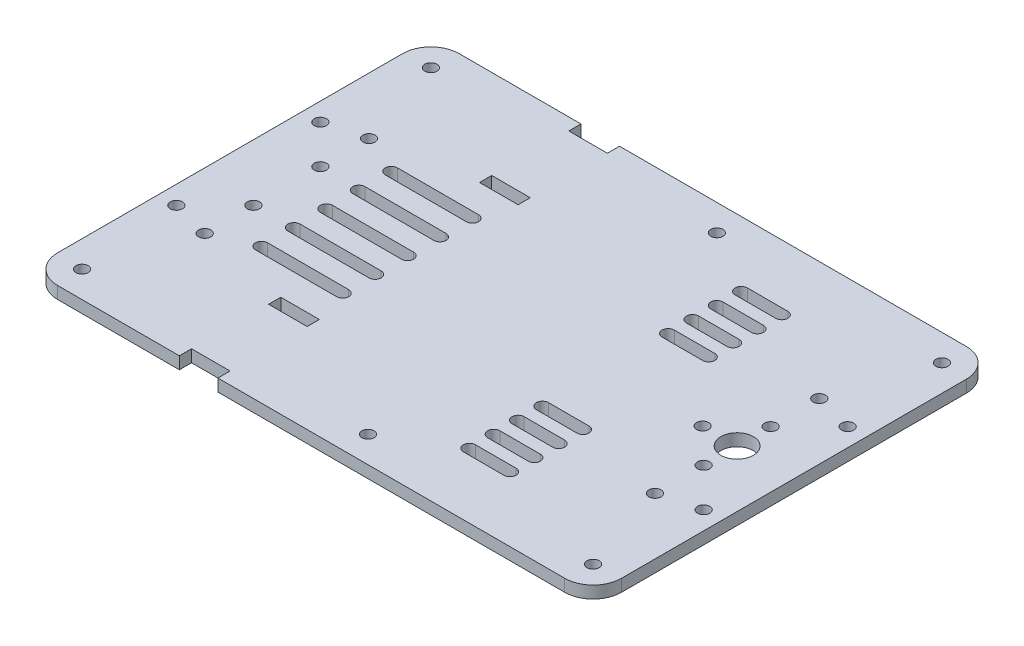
ISO-10303-21;
HEADER;
FILE_DESCRIPTION(('STEP AP214'),'2;1');
FILE_NAME('part.step','',(''),(''),'','','');
FILE_SCHEMA(('AUTOMOTIVE_DESIGN { 1 0 10303 214 1 1 1 1 }'));
ENDSEC;
DATA;
#1=APPLICATION_CONTEXT('core data for automotive mechanical design processes');
#2=APPLICATION_PROTOCOL_DEFINITION('international standard','automotive_design',2000,#1);
#3=PRODUCT_CONTEXT('',#1,'mechanical');
#4=PRODUCT('Part','Part','',(#3));
#5=PRODUCT_RELATED_PRODUCT_CATEGORY('part','',(#4));
#6=PRODUCT_DEFINITION_FORMATION('','',#4);
#7=PRODUCT_DEFINITION_CONTEXT('part definition',#1,'design');
#8=PRODUCT_DEFINITION('design','',#6,#7);
#9=PRODUCT_DEFINITION_SHAPE('','',#8);
#10=(LENGTH_UNIT() NAMED_UNIT(*) SI_UNIT(.MILLI.,.METRE.));
#11=(NAMED_UNIT(*) PLANE_ANGLE_UNIT() SI_UNIT($,.RADIAN.));
#12=(NAMED_UNIT(*) SI_UNIT($,.STERADIAN.) SOLID_ANGLE_UNIT());
#13=UNCERTAINTY_MEASURE_WITH_UNIT(LENGTH_MEASURE(1.E-05),#10,'distance_accuracy_value','');
#14=(GEOMETRIC_REPRESENTATION_CONTEXT(3) GLOBAL_UNCERTAINTY_ASSIGNED_CONTEXT((#13)) GLOBAL_UNIT_ASSIGNED_CONTEXT((#10,
#11,#12)) REPRESENTATION_CONTEXT('',''));
#15=CARTESIAN_POINT('',(0.,0.,0.));
#16=DIRECTION('',(0.,0.,1.));
#17=DIRECTION('',(1.,0.,0.));
#18=AXIS2_PLACEMENT_3D('',#15,#16,#17);
#19=CARTESIAN_POINT('',(0.,3.,23.));
#20=DIRECTION('',(0.,0.,1.));
#21=DIRECTION('',(1.,0.,0.));
#22=AXIS2_PLACEMENT_3D('',#19,#20,#21);
#23=PLANE('',#22);
#24=DIRECTION('',(-1.,0.,0.));
#25=VECTOR('',#24,1.);
#26=CARTESIAN_POINT('',(0.,0.,23.));
#27=LINE('',#26,#25);
#28=CARTESIAN_POINT('',(32.9999999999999,0.,23.));
#29=VERTEX_POINT('',#28);
#30=CARTESIAN_POINT('',(22.9999999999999,0.,23.));
#31=VERTEX_POINT('',#30);
#32=EDGE_CURVE('E806',#29,#31,#27,.T.);
#33=ORIENTED_EDGE('',*,*,#32,.T.);
#34=DIRECTION('',(0.,-1.,0.));
#35=VECTOR('',#34,1.);
#36=CARTESIAN_POINT('',(22.9999999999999,3.,23.));
#37=LINE('',#36,#35);
#38=CARTESIAN_POINT('',(22.9999999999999,3.,23.));
#39=VERTEX_POINT('',#38);
#40=EDGE_CURVE('E11',#39,#31,#37,.T.);
#41=ORIENTED_EDGE('',*,*,#40,.F.);
#42=DIRECTION('',(-1.,0.,0.));
#43=VECTOR('',#42,1.);
#44=CARTESIAN_POINT('',(0.,3.,23.));
#45=LINE('',#44,#43);
#46=CARTESIAN_POINT('',(32.9999999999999,3.,23.));
#47=VERTEX_POINT('',#46);
#48=EDGE_CURVE('E524',#47,#39,#45,.T.);
#49=ORIENTED_EDGE('',*,*,#48,.F.);
#50=DIRECTION('',(0.,-1.,0.));
#51=VECTOR('',#50,1.);
#52=CARTESIAN_POINT('',(32.9999999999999,3.,23.));
#53=LINE('',#52,#51);
#54=EDGE_CURVE('E814',#47,#29,#53,.T.);
#55=ORIENTED_EDGE('',*,*,#54,.T.);
#56=EDGE_LOOP('',(#33,#41,#49,#55));
#57=FACE_BOUND('',#56,.T.);
#58=ADVANCED_FACE('F39',(#57),#23,.F.);
#59=CARTESIAN_POINT('',(23.,3.,21.5));
#60=DIRECTION('',(0.,-1.,0.));
#61=DIRECTION('',(0.,0.,-1.));
#62=AXIS2_PLACEMENT_3D('',#59,#60,#61);
#63=CYLINDRICAL_SURFACE('',#62,1.49999999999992);
#64=CARTESIAN_POINT('',(23.,0.,21.5));
#65=DIRECTION('',(0.,1.,0.));
#66=DIRECTION('',(0.,0.,1.));
#67=AXIS2_PLACEMENT_3D('',#64,#65,#66);
#68=CIRCLE('',#67,1.49999999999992);
#69=CARTESIAN_POINT('',(22.9999999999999,0.,20.0000000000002));
#70=VERTEX_POINT('',#69);
#71=EDGE_CURVE('E530',#31,#70,#68,.F.);
#72=ORIENTED_EDGE('',*,*,#71,.T.);
#73=DIRECTION('',(0.,-1.,0.));
#74=VECTOR('',#73,1.);
#75=CARTESIAN_POINT('',(22.9999999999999,3.,20.0000000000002));
#76=LINE('',#75,#74);
#77=CARTESIAN_POINT('',(22.9999999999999,3.,20.0000000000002));
#78=VERTEX_POINT('',#77);
#79=EDGE_CURVE('E49',#78,#70,#76,.T.);
#80=ORIENTED_EDGE('',*,*,#79,.F.);
#81=CARTESIAN_POINT('',(23.,3.,21.5));
#82=DIRECTION('',(0.,1.,0.));
#83=DIRECTION('',(0.,0.,1.));
#84=AXIS2_PLACEMENT_3D('',#81,#82,#83);
#85=CIRCLE('',#84,1.49999999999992);
#86=EDGE_CURVE('E518',#39,#78,#85,.F.);
#87=ORIENTED_EDGE('',*,*,#86,.F.);
#88=ORIENTED_EDGE('',*,*,#40,.T.);
#89=EDGE_LOOP('',(#72,#80,#87,#88));
#90=FACE_BOUND('',#89,.T.);
#91=ADVANCED_FACE('F529',(#90),#63,.F.);
#92=CARTESIAN_POINT('',(0.,3.,20.0000000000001));
#93=DIRECTION('',(0.,0.,1.));
#94=DIRECTION('',(1.,0.,0.));
#95=AXIS2_PLACEMENT_3D('',#92,#93,#94);
#96=PLANE('',#95);
#97=DIRECTION('',(-1.,0.,0.));
#98=VECTOR('',#97,1.);
#99=CARTESIAN_POINT('',(0.,0.,20.0000000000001));
#100=LINE('',#99,#98);
#101=CARTESIAN_POINT('',(32.9999999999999,0.,20.0000000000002));
#102=VERTEX_POINT('',#101);
#103=EDGE_CURVE('E810',#102,#70,#100,.T.);
#104=ORIENTED_EDGE('',*,*,#103,.F.);
#105=DIRECTION('',(0.,-1.,0.));
#106=VECTOR('',#105,1.);
#107=CARTESIAN_POINT('',(32.9999999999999,3.,20.0000000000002));
#108=LINE('',#107,#106);
#109=CARTESIAN_POINT('',(32.9999999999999,3.,20.0000000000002));
#110=VERTEX_POINT('',#109);
#111=EDGE_CURVE('E290',#110,#102,#108,.T.);
#112=ORIENTED_EDGE('',*,*,#111,.F.);
#113=DIRECTION('',(-1.,0.,0.));
#114=VECTOR('',#113,1.);
#115=CARTESIAN_POINT('',(0.,3.,20.0000000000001));
#116=LINE('',#115,#114);
#117=EDGE_CURVE('E522',#110,#78,#116,.T.);
#118=ORIENTED_EDGE('',*,*,#117,.T.);
#119=ORIENTED_EDGE('',*,*,#79,.T.);
#120=EDGE_LOOP('',(#104,#112,#118,#119));
#121=FACE_BOUND('',#120,.T.);
#122=ADVANCED_FACE('F535',(#121),#96,.T.);
#123=CARTESIAN_POINT('',(0.,3.,29.));
#124=DIRECTION('',(0.,0.,1.));
#125=DIRECTION('',(1.,0.,0.));
#126=AXIS2_PLACEMENT_3D('',#123,#124,#125);
#127=PLANE('',#126);
#128=DIRECTION('',(-1.,0.,0.));
#129=VECTOR('',#128,1.);
#130=CARTESIAN_POINT('',(0.,0.,29.));
#131=LINE('',#130,#129);
#132=CARTESIAN_POINT('',(32.9999999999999,0.,29.));
#133=VERTEX_POINT('',#132);
#134=CARTESIAN_POINT('',(22.9999999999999,0.,29.));
#135=VERTEX_POINT('',#134);
#136=EDGE_CURVE('E795',#133,#135,#131,.T.);
#137=ORIENTED_EDGE('',*,*,#136,.T.);
#138=DIRECTION('',(0.,-1.,0.));
#139=VECTOR('',#138,1.);
#140=CARTESIAN_POINT('',(22.9999999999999,3.,29.));
#141=LINE('',#140,#139);
#142=CARTESIAN_POINT('',(22.9999999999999,3.,29.));
#143=VERTEX_POINT('',#142);
#144=EDGE_CURVE('E816',#143,#135,#141,.T.);
#145=ORIENTED_EDGE('',*,*,#144,.F.);
#146=DIRECTION('',(-1.,0.,0.));
#147=VECTOR('',#146,1.);
#148=CARTESIAN_POINT('',(0.,3.,29.));
#149=LINE('',#148,#147);
#150=CARTESIAN_POINT('',(32.9999999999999,3.,29.));
#151=VERTEX_POINT('',#150);
#152=EDGE_CURVE('E1225',#151,#143,#149,.T.);
#153=ORIENTED_EDGE('',*,*,#152,.F.);
#154=DIRECTION('',(0.,-1.,0.));
#155=VECTOR('',#154,1.);
#156=CARTESIAN_POINT('',(32.9999999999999,3.,29.));
#157=LINE('',#156,#155);
#158=EDGE_CURVE('E818',#151,#133,#157,.T.);
#159=ORIENTED_EDGE('',*,*,#158,.T.);
#160=EDGE_LOOP('',(#137,#145,#153,#159));
#161=FACE_BOUND('',#160,.T.);
#162=ADVANCED_FACE('F1245',(#161),#127,.F.);
#163=CARTESIAN_POINT('',(23.,3.,27.5));
#164=DIRECTION('',(0.,-1.,0.));
#165=DIRECTION('',(0.,0.,-1.));
#166=AXIS2_PLACEMENT_3D('',#163,#164,#165);
#167=CYLINDRICAL_SURFACE('',#166,1.49999999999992);
#168=CARTESIAN_POINT('',(23.,0.,27.5));
#169=DIRECTION('',(0.,1.,0.));
#170=DIRECTION('',(0.,0.,1.));
#171=AXIS2_PLACEMENT_3D('',#168,#169,#170);
#172=CIRCLE('',#171,1.49999999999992);
#173=CARTESIAN_POINT('',(22.9999999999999,0.,26.0000000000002));
#174=VERTEX_POINT('',#173);
#175=EDGE_CURVE('E798',#135,#174,#172,.F.);
#176=ORIENTED_EDGE('',*,*,#175,.T.);
#177=DIRECTION('',(0.,-1.,0.));
#178=VECTOR('',#177,1.);
#179=CARTESIAN_POINT('',(22.9999999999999,3.,26.0000000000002));
#180=LINE('',#179,#178);
#181=CARTESIAN_POINT('',(22.9999999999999,3.,26.0000000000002));
#182=VERTEX_POINT('',#181);
#183=EDGE_CURVE('E824',#182,#174,#180,.T.);
#184=ORIENTED_EDGE('',*,*,#183,.F.);
#185=CARTESIAN_POINT('',(23.,3.,27.5));
#186=DIRECTION('',(0.,1.,0.));
#187=DIRECTION('',(0.,0.,1.));
#188=AXIS2_PLACEMENT_3D('',#185,#186,#187);
#189=CIRCLE('',#188,1.49999999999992);
#190=EDGE_CURVE('E1228',#143,#182,#189,.F.);
#191=ORIENTED_EDGE('',*,*,#190,.F.);
#192=ORIENTED_EDGE('',*,*,#144,.T.);
#193=EDGE_LOOP('',(#176,#184,#191,#192));
#194=FACE_BOUND('',#193,.T.);
#195=ADVANCED_FACE('F1247',(#194),#167,.F.);
#196=CARTESIAN_POINT('',(0.,3.,26.0000000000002));
#197=DIRECTION('',(0.,0.,1.));
#198=DIRECTION('',(1.,0.,0.));
#199=AXIS2_PLACEMENT_3D('',#196,#197,#198);
#200=PLANE('',#199);
#201=DIRECTION('',(-1.,0.,0.));
#202=VECTOR('',#201,1.);
#203=CARTESIAN_POINT('',(0.,0.,26.0000000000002));
#204=LINE('',#203,#202);
#205=CARTESIAN_POINT('',(32.9999999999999,0.,26.0000000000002));
#206=VERTEX_POINT('',#205);
#207=EDGE_CURVE('E801',#206,#174,#204,.T.);
#208=ORIENTED_EDGE('',*,*,#207,.F.);
#209=DIRECTION('',(0.,-1.,0.));
#210=VECTOR('',#209,1.);
#211=CARTESIAN_POINT('',(32.9999999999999,3.,26.0000000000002));
#212=LINE('',#211,#210);
#213=CARTESIAN_POINT('',(32.9999999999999,3.,26.0000000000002));
#214=VERTEX_POINT('',#213);
#215=EDGE_CURVE('E821',#214,#206,#212,.T.);
#216=ORIENTED_EDGE('',*,*,#215,.F.);
#217=DIRECTION('',(-1.,0.,0.));
#218=VECTOR('',#217,1.);
#219=CARTESIAN_POINT('',(0.,3.,26.0000000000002));
#220=LINE('',#219,#218);
#221=EDGE_CURVE('E1230',#214,#182,#220,.T.);
#222=ORIENTED_EDGE('',*,*,#221,.T.);
#223=ORIENTED_EDGE('',*,*,#183,.T.);
#224=EDGE_LOOP('',(#208,#216,#222,#223));
#225=FACE_BOUND('',#224,.T.);
#226=ADVANCED_FACE('F1251',(#225),#200,.T.);
#227=CARTESIAN_POINT('',(0.,3.,35.));
#228=DIRECTION('',(0.,0.,1.));
#229=DIRECTION('',(1.,0.,0.));
#230=AXIS2_PLACEMENT_3D('',#227,#228,#229);
#231=PLANE('',#230);
#232=DIRECTION('',(-1.,0.,0.));
#233=VECTOR('',#232,1.);
#234=CARTESIAN_POINT('',(0.,0.,35.));
#235=LINE('',#234,#233);
#236=CARTESIAN_POINT('',(32.9999999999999,0.,35.));
#237=VERTEX_POINT('',#236);
#238=CARTESIAN_POINT('',(22.9999999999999,0.,35.));
#239=VERTEX_POINT('',#238);
#240=EDGE_CURVE('E784',#237,#239,#235,.T.);
#241=ORIENTED_EDGE('',*,*,#240,.T.);
#242=DIRECTION('',(0.,-1.,0.));
#243=VECTOR('',#242,1.);
#244=CARTESIAN_POINT('',(22.9999999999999,3.,35.));
#245=LINE('',#244,#243);
#246=CARTESIAN_POINT('',(22.9999999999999,3.,35.));
#247=VERTEX_POINT('',#246);
#248=EDGE_CURVE('E822',#247,#239,#245,.T.);
#249=ORIENTED_EDGE('',*,*,#248,.F.);
#250=DIRECTION('',(-1.,0.,0.));
#251=VECTOR('',#250,1.);
#252=CARTESIAN_POINT('',(0.,3.,35.));
#253=LINE('',#252,#251);
#254=CARTESIAN_POINT('',(32.9999999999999,3.,35.));
#255=VERTEX_POINT('',#254);
#256=EDGE_CURVE('E1215',#255,#247,#253,.T.);
#257=ORIENTED_EDGE('',*,*,#256,.F.);
#258=DIRECTION('',(0.,-1.,0.));
#259=VECTOR('',#258,1.);
#260=CARTESIAN_POINT('',(32.9999999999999,3.,35.));
#261=LINE('',#260,#259);
#262=EDGE_CURVE('E828',#255,#237,#261,.T.);
#263=ORIENTED_EDGE('',*,*,#262,.T.);
#264=EDGE_LOOP('',(#241,#249,#257,#263));
#265=FACE_BOUND('',#264,.T.);
#266=ADVANCED_FACE('F1281',(#265),#231,.F.);
#267=CARTESIAN_POINT('',(23.,3.,33.5));
#268=DIRECTION('',(0.,-1.,0.));
#269=DIRECTION('',(0.,0.,-1.));
#270=AXIS2_PLACEMENT_3D('',#267,#268,#269);
#271=CYLINDRICAL_SURFACE('',#270,1.49999999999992);
#272=CARTESIAN_POINT('',(23.,0.,33.5));
#273=DIRECTION('',(0.,1.,0.));
#274=DIRECTION('',(0.,0.,1.));
#275=AXIS2_PLACEMENT_3D('',#272,#273,#274);
#276=CIRCLE('',#275,1.49999999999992);
#277=CARTESIAN_POINT('',(22.9999999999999,0.,32.0000000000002));
#278=VERTEX_POINT('',#277);
#279=EDGE_CURVE('E787',#239,#278,#276,.F.);
#280=ORIENTED_EDGE('',*,*,#279,.T.);
#281=DIRECTION('',(0.,-1.,0.));
#282=VECTOR('',#281,1.);
#283=CARTESIAN_POINT('',(22.9999999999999,3.,32.0000000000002));
#284=LINE('',#283,#282);
#285=CARTESIAN_POINT('',(22.9999999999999,3.,32.0000000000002));
#286=VERTEX_POINT('',#285);
#287=EDGE_CURVE('E834',#286,#278,#284,.T.);
#288=ORIENTED_EDGE('',*,*,#287,.F.);
#289=CARTESIAN_POINT('',(23.,3.,33.5));
#290=DIRECTION('',(0.,1.,0.));
#291=DIRECTION('',(0.,0.,1.));
#292=AXIS2_PLACEMENT_3D('',#289,#290,#291);
#293=CIRCLE('',#292,1.49999999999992);
#294=EDGE_CURVE('E1218',#247,#286,#293,.F.);
#295=ORIENTED_EDGE('',*,*,#294,.F.);
#296=ORIENTED_EDGE('',*,*,#248,.T.);
#297=EDGE_LOOP('',(#280,#288,#295,#296));
#298=FACE_BOUND('',#297,.T.);
#299=ADVANCED_FACE('F1294',(#298),#271,.F.);
#300=CARTESIAN_POINT('',(0.,3.,32.0000000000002));
#301=DIRECTION('',(0.,0.,1.));
#302=DIRECTION('',(1.,0.,0.));
#303=AXIS2_PLACEMENT_3D('',#300,#301,#302);
#304=PLANE('',#303);
#305=DIRECTION('',(-1.,0.,0.));
#306=VECTOR('',#305,1.);
#307=CARTESIAN_POINT('',(0.,0.,32.0000000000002));
#308=LINE('',#307,#306);
#309=CARTESIAN_POINT('',(32.9999999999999,0.,32.0000000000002));
#310=VERTEX_POINT('',#309);
#311=EDGE_CURVE('E790',#310,#278,#308,.T.);
#312=ORIENTED_EDGE('',*,*,#311,.F.);
#313=DIRECTION('',(0.,-1.,0.));
#314=VECTOR('',#313,1.);
#315=CARTESIAN_POINT('',(32.9999999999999,3.,32.0000000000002));
#316=LINE('',#315,#314);
#317=CARTESIAN_POINT('',(32.9999999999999,3.,32.0000000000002));
#318=VERTEX_POINT('',#317);
#319=EDGE_CURVE('E831',#318,#310,#316,.T.);
#320=ORIENTED_EDGE('',*,*,#319,.F.);
#321=DIRECTION('',(-1.,0.,0.));
#322=VECTOR('',#321,1.);
#323=CARTESIAN_POINT('',(0.,3.,32.0000000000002));
#324=LINE('',#323,#322);
#325=EDGE_CURVE('E1220',#318,#286,#324,.T.);
#326=ORIENTED_EDGE('',*,*,#325,.T.);
#327=ORIENTED_EDGE('',*,*,#287,.T.);
#328=EDGE_LOOP('',(#312,#320,#326,#327));
#329=FACE_BOUND('',#328,.T.);
#330=ADVANCED_FACE('F1290',(#329),#304,.T.);
#331=CARTESIAN_POINT('',(23.,3.,-15.5));
#332=DIRECTION('',(0.,-1.,0.));
#333=DIRECTION('',(0.,0.,-1.));
#334=AXIS2_PLACEMENT_3D('',#331,#332,#333);
#335=CYLINDRICAL_SURFACE('',#334,1.5);
#336=CARTESIAN_POINT('',(23.,0.,-15.5));
#337=DIRECTION('',(0.,1.,0.));
#338=DIRECTION('',(0.,0.,1.));
#339=AXIS2_PLACEMENT_3D('',#336,#337,#338);
#340=CIRCLE('',#339,1.5);
#341=CARTESIAN_POINT('',(23.,0.,-17.));
#342=VERTEX_POINT('',#341);
#343=CARTESIAN_POINT('',(23.,0.,-14.));
#344=VERTEX_POINT('',#343);
#345=EDGE_CURVE('E757',#342,#344,#340,.T.);
#346=ORIENTED_EDGE('',*,*,#345,.F.);
#347=DIRECTION('',(0.,-1.,0.));
#348=VECTOR('',#347,1.);
#349=CARTESIAN_POINT('',(23.,3.,-17.));
#350=LINE('',#349,#348);
#351=CARTESIAN_POINT('',(23.,3.,-17.));
#352=VERTEX_POINT('',#351);
#353=EDGE_CURVE('E832',#352,#342,#350,.T.);
#354=ORIENTED_EDGE('',*,*,#353,.F.);
#355=CARTESIAN_POINT('',(23.,3.,-15.5));
#356=DIRECTION('',(0.,1.,0.));
#357=DIRECTION('',(0.,0.,1.));
#358=AXIS2_PLACEMENT_3D('',#355,#356,#357);
#359=CIRCLE('',#358,1.5);
#360=CARTESIAN_POINT('',(23.,3.,-14.));
#361=VERTEX_POINT('',#360);
#362=EDGE_CURVE('E1189',#352,#361,#359,.T.);
#363=ORIENTED_EDGE('',*,*,#362,.T.);
#364=DIRECTION('',(0.,-1.,0.));
#365=VECTOR('',#364,1.);
#366=CARTESIAN_POINT('',(23.,3.,-14.));
#367=LINE('',#366,#365);
#368=EDGE_CURVE('E838',#361,#344,#367,.T.);
#369=ORIENTED_EDGE('',*,*,#368,.T.);
#370=EDGE_LOOP('',(#346,#354,#363,#369));
#371=FACE_BOUND('',#370,.T.);
#372=ADVANCED_FACE('F1293',(#371),#335,.F.);
#373=CARTESIAN_POINT('',(0.,3.,-17.));
#374=DIRECTION('',(0.,0.,1.));
#375=DIRECTION('',(1.,0.,0.));
#376=AXIS2_PLACEMENT_3D('',#373,#374,#375);
#377=PLANE('',#376);
#378=DIRECTION('',(-1.,0.,0.));
#379=VECTOR('',#378,1.);
#380=CARTESIAN_POINT('',(0.,0.,-17.));
#381=LINE('',#380,#379);
#382=CARTESIAN_POINT('',(33.,0.,-17.));
#383=VERTEX_POINT('',#382);
#384=EDGE_CURVE('E760',#383,#342,#381,.T.);
#385=ORIENTED_EDGE('',*,*,#384,.F.);
#386=DIRECTION('',(0.,-1.,0.));
#387=VECTOR('',#386,1.);
#388=CARTESIAN_POINT('',(33.,3.,-17.));
#389=LINE('',#388,#387);
#390=CARTESIAN_POINT('',(33.,3.,-17.));
#391=VERTEX_POINT('',#390);
#392=EDGE_CURVE('E843',#391,#383,#389,.T.);
#393=ORIENTED_EDGE('',*,*,#392,.F.);
#394=DIRECTION('',(-1.,0.,0.));
#395=VECTOR('',#394,1.);
#396=CARTESIAN_POINT('',(0.,3.,-17.));
#397=LINE('',#396,#395);
#398=EDGE_CURVE('E1192',#391,#352,#397,.T.);
#399=ORIENTED_EDGE('',*,*,#398,.T.);
#400=ORIENTED_EDGE('',*,*,#353,.T.);
#401=EDGE_LOOP('',(#385,#393,#399,#400));
#402=FACE_BOUND('',#401,.T.);
#403=ADVANCED_FACE('F1330',(#402),#377,.T.);
#404=CARTESIAN_POINT('',(33.,3.,-15.5));
#405=DIRECTION('',(0.,-1.,0.));
#406=DIRECTION('',(0.,0.,-1.));
#407=AXIS2_PLACEMENT_3D('',#404,#405,#406);
#408=CYLINDRICAL_SURFACE('',#407,1.5);
#409=CARTESIAN_POINT('',(33.,0.,-15.5));
#410=DIRECTION('',(0.,1.,0.));
#411=DIRECTION('',(0.,0.,1.));
#412=AXIS2_PLACEMENT_3D('',#409,#410,#411);
#413=CIRCLE('',#412,1.5);
#414=CARTESIAN_POINT('',(33.,0.,-14.));
#415=VERTEX_POINT('',#414);
#416=EDGE_CURVE('E763',#415,#383,#413,.T.);
#417=ORIENTED_EDGE('',*,*,#416,.F.);
#418=DIRECTION('',(0.,-1.,0.));
#419=VECTOR('',#418,1.);
#420=CARTESIAN_POINT('',(33.,3.,-14.));
#421=LINE('',#420,#419);
#422=CARTESIAN_POINT('',(33.,3.,-14.));
#423=VERTEX_POINT('',#422);
#424=EDGE_CURVE('E840',#423,#415,#421,.T.);
#425=ORIENTED_EDGE('',*,*,#424,.F.);
#426=CARTESIAN_POINT('',(33.,3.,-15.5));
#427=DIRECTION('',(0.,1.,0.));
#428=DIRECTION('',(0.,0.,1.));
#429=AXIS2_PLACEMENT_3D('',#426,#427,#428);
#430=CIRCLE('',#429,1.5);
#431=EDGE_CURVE('E1195',#423,#391,#430,.T.);
#432=ORIENTED_EDGE('',*,*,#431,.T.);
#433=ORIENTED_EDGE('',*,*,#392,.T.);
#434=EDGE_LOOP('',(#417,#425,#432,#433));
#435=FACE_BOUND('',#434,.T.);
#436=ADVANCED_FACE('F1326',(#435),#408,.F.);
#437=CARTESIAN_POINT('',(0.,3.,-49.5));
#438=DIRECTION('',(0.,0.,1.));
#439=DIRECTION('',(1.,0.,0.));
#440=AXIS2_PLACEMENT_3D('',#437,#438,#439);
#441=PLANE('',#440);
#442=DIRECTION('',(-1.,0.,0.));
#443=VECTOR('',#442,1.);
#444=CARTESIAN_POINT('',(0.,0.,-49.5));
#445=LINE('',#444,#443);
#446=CARTESIAN_POINT('',(-32.5,0.,-49.5));
#447=VERTEX_POINT('',#446);
#448=CARTESIAN_POINT('',(-62.5,0.,-49.5));
#449=VERTEX_POINT('',#448);
#450=EDGE_CURVE('E714',#447,#449,#445,.T.);
#451=ORIENTED_EDGE('',*,*,#450,.T.);
#452=DIRECTION('',(0.,-1.,0.));
#453=VECTOR('',#452,1.);
#454=CARTESIAN_POINT('',(-62.5,3.,-49.5));
#455=LINE('',#454,#453);
#456=CARTESIAN_POINT('',(-62.5,3.,-49.5));
#457=VERTEX_POINT('',#456);
#458=EDGE_CURVE('E841',#457,#449,#455,.T.);
#459=ORIENTED_EDGE('',*,*,#458,.F.);
#460=DIRECTION('',(-1.,0.,0.));
#461=VECTOR('',#460,1.);
#462=CARTESIAN_POINT('',(0.,3.,-49.5));
#463=LINE('',#462,#461);
#464=CARTESIAN_POINT('',(-32.5,3.,-49.5));
#465=VERTEX_POINT('',#464);
#466=EDGE_CURVE('E1149',#465,#457,#463,.T.);
#467=ORIENTED_EDGE('',*,*,#466,.F.);
#468=DIRECTION('',(0.,-1.,0.));
#469=VECTOR('',#468,1.);
#470=CARTESIAN_POINT('',(-32.5,3.,-49.5));
#471=LINE('',#470,#469);
#472=EDGE_CURVE('E846',#465,#447,#471,.T.);
#473=ORIENTED_EDGE('',*,*,#472,.T.);
#474=EDGE_LOOP('',(#451,#459,#467,#473));
#475=FACE_BOUND('',#474,.T.);
#476=ADVANCED_FACE('F1329',(#475),#441,.F.);
#477=CARTESIAN_POINT('',(-62.5,3.,-42.5));
#478=DIRECTION('',(0.,-1.,0.));
#479=DIRECTION('',(0.,0.,-1.));
#480=AXIS2_PLACEMENT_3D('',#477,#478,#479);
#481=CYLINDRICAL_SURFACE('',#480,7.);
#482=CARTESIAN_POINT('',(-62.5,0.,-42.5));
#483=DIRECTION('',(0.,1.,0.));
#484=DIRECTION('',(0.,0.,1.));
#485=AXIS2_PLACEMENT_3D('',#482,#483,#484);
#486=CIRCLE('',#485,7.);
#487=CARTESIAN_POINT('',(-69.5,0.,-42.5));
#488=VERTEX_POINT('',#487);
#489=EDGE_CURVE('E717',#449,#488,#486,.T.);
#490=ORIENTED_EDGE('',*,*,#489,.T.);
#491=DIRECTION('',(0.,-1.,0.));
#492=VECTOR('',#491,1.);
#493=CARTESIAN_POINT('',(-69.5,3.,-42.5));
#494=LINE('',#493,#492);
#495=CARTESIAN_POINT('',(-69.5,3.,-42.5));
#496=VERTEX_POINT('',#495);
#497=EDGE_CURVE('E880',#496,#488,#494,.T.);
#498=ORIENTED_EDGE('',*,*,#497,.F.);
#499=CARTESIAN_POINT('',(-62.5,3.,-42.5));
#500=DIRECTION('',(0.,1.,0.));
#501=DIRECTION('',(0.,0.,1.));
#502=AXIS2_PLACEMENT_3D('',#499,#500,#501);
#503=CIRCLE('',#502,7.);
#504=EDGE_CURVE('E1152',#457,#496,#503,.T.);
#505=ORIENTED_EDGE('',*,*,#504,.F.);
#506=ORIENTED_EDGE('',*,*,#458,.T.);
#507=EDGE_LOOP('',(#490,#498,#505,#506));
#508=FACE_BOUND('',#507,.T.);
#509=ADVANCED_FACE('F1395',(#508),#481,.T.);
#510=CARTESIAN_POINT('',(-69.5,3.,0.));
#511=DIRECTION('',(-1.,0.,0.));
#512=DIRECTION('',(0.,0.,1.));
#513=AXIS2_PLACEMENT_3D('',#510,#511,#512);
#514=PLANE('',#513);
#515=DIRECTION('',(0.,0.,-1.));
#516=VECTOR('',#515,1.);
#517=CARTESIAN_POINT('',(-69.5,0.,0.));
#518=LINE('',#517,#516);
#519=CARTESIAN_POINT('',(-69.5,0.,42.5));
#520=VERTEX_POINT('',#519);
#521=EDGE_CURVE('E721',#520,#488,#518,.T.);
#522=ORIENTED_EDGE('',*,*,#521,.F.);
#523=DIRECTION('',(0.,-1.,0.));
#524=VECTOR('',#523,1.);
#525=CARTESIAN_POINT('',(-69.5,3.,42.5));
#526=LINE('',#525,#524);
#527=CARTESIAN_POINT('',(-69.5,3.,42.5));
#528=VERTEX_POINT('',#527);
#529=EDGE_CURVE('E878',#528,#520,#526,.T.);
#530=ORIENTED_EDGE('',*,*,#529,.F.);
#531=DIRECTION('',(0.,0.,-1.));
#532=VECTOR('',#531,1.);
#533=CARTESIAN_POINT('',(-69.5,3.,0.));
#534=LINE('',#533,#532);
#535=EDGE_CURVE('E1155',#528,#496,#534,.T.);
#536=ORIENTED_EDGE('',*,*,#535,.T.);
#537=ORIENTED_EDGE('',*,*,#497,.T.);
#538=EDGE_LOOP('',(#522,#530,#536,#537));
#539=FACE_BOUND('',#538,.T.);
#540=ADVANCED_FACE('F1391',(#539),#514,.T.);
#541=CARTESIAN_POINT('',(-62.5,3.,42.5));
#542=DIRECTION('',(0.,-1.,0.));
#543=DIRECTION('',(0.,0.,-1.));
#544=AXIS2_PLACEMENT_3D('',#541,#542,#543);
#545=CYLINDRICAL_SURFACE('',#544,7.);
#546=CARTESIAN_POINT('',(-62.5,0.,42.5));
#547=DIRECTION('',(0.,1.,0.));
#548=DIRECTION('',(0.,0.,1.));
#549=AXIS2_PLACEMENT_3D('',#546,#547,#548);
#550=CIRCLE('',#549,7.);
#551=CARTESIAN_POINT('',(-62.5,0.,49.5));
#552=VERTEX_POINT('',#551);
#553=EDGE_CURVE('E724',#552,#520,#550,.F.);
#554=ORIENTED_EDGE('',*,*,#553,.F.);
#555=DIRECTION('',(0.,-1.,0.));
#556=VECTOR('',#555,1.);
#557=CARTESIAN_POINT('',(-62.5,3.,49.5));
#558=LINE('',#557,#556);
#559=CARTESIAN_POINT('',(-62.5,3.,49.5));
#560=VERTEX_POINT('',#559);
#561=EDGE_CURVE('E876',#560,#552,#558,.T.);
#562=ORIENTED_EDGE('',*,*,#561,.F.);
#563=CARTESIAN_POINT('',(-62.5,3.,42.5));
#564=DIRECTION('',(0.,1.,0.));
#565=DIRECTION('',(0.,0.,1.));
#566=AXIS2_PLACEMENT_3D('',#563,#564,#565);
#567=CIRCLE('',#566,7.);
#568=EDGE_CURVE('E1158',#560,#528,#567,.F.);
#569=ORIENTED_EDGE('',*,*,#568,.T.);
#570=ORIENTED_EDGE('',*,*,#529,.T.);
#571=EDGE_LOOP('',(#554,#562,#569,#570));
#572=FACE_BOUND('',#571,.T.);
#573=ADVANCED_FACE('F1388',(#572),#545,.T.);
#574=CARTESIAN_POINT('',(0.,3.,49.5));
#575=DIRECTION('',(0.,0.,1.));
#576=DIRECTION('',(1.,0.,0.));
#577=AXIS2_PLACEMENT_3D('',#574,#575,#576);
#578=PLANE('',#577);
#579=DIRECTION('',(-1.,0.,0.));
#580=VECTOR('',#579,1.);
#581=CARTESIAN_POINT('',(0.,0.,49.5));
#582=LINE('',#581,#580);
#583=CARTESIAN_POINT('',(-32.5,0.,49.5));
#584=VERTEX_POINT('',#583);
#585=EDGE_CURVE('E727',#584,#552,#582,.T.);
#586=ORIENTED_EDGE('',*,*,#585,.F.);
#587=DIRECTION('',(0.,-1.,0.));
#588=VECTOR('',#587,1.);
#589=CARTESIAN_POINT('',(-32.5,3.,49.5));
#590=LINE('',#589,#588);
#591=CARTESIAN_POINT('',(-32.5,3.,49.5));
#592=VERTEX_POINT('',#591);
#593=EDGE_CURVE('E874',#592,#584,#590,.T.);
#594=ORIENTED_EDGE('',*,*,#593,.F.);
#595=DIRECTION('',(-1.,0.,0.));
#596=VECTOR('',#595,1.);
#597=CARTESIAN_POINT('',(0.,3.,49.5));
#598=LINE('',#597,#596);
#599=EDGE_CURVE('E1161',#592,#560,#598,.T.);
#600=ORIENTED_EDGE('',*,*,#599,.T.);
#601=ORIENTED_EDGE('',*,*,#561,.T.);
#602=EDGE_LOOP('',(#586,#594,#600,#601));
#603=FACE_BOUND('',#602,.T.);
#604=ADVANCED_FACE('F1376',(#603),#578,.T.);
#605=CARTESIAN_POINT('',(-32.5,3.,0.));
#606=DIRECTION('',(-1.,0.,0.));
#607=DIRECTION('',(0.,0.,1.));
#608=AXIS2_PLACEMENT_3D('',#605,#606,#607);
#609=PLANE('',#608);
#610=DIRECTION('',(0.,0.,-1.));
#611=VECTOR('',#610,1.);
#612=CARTESIAN_POINT('',(-32.5,0.,0.));
#613=LINE('',#612,#611);
#614=CARTESIAN_POINT('',(-32.5,0.,46.5));
#615=VERTEX_POINT('',#614);
#616=EDGE_CURVE('E730',#584,#615,#613,.T.);
#617=ORIENTED_EDGE('',*,*,#616,.T.);
#618=DIRECTION('',(0.,-1.,0.));
#619=VECTOR('',#618,1.);
#620=CARTESIAN_POINT('',(-32.5,3.,46.5));
#621=LINE('',#620,#619);
#622=CARTESIAN_POINT('',(-32.5,3.,46.5));
#623=VERTEX_POINT('',#622);
#624=EDGE_CURVE('E871',#623,#615,#621,.T.);
#625=ORIENTED_EDGE('',*,*,#624,.F.);
#626=DIRECTION('',(0.,0.,-1.));
#627=VECTOR('',#626,1.);
#628=CARTESIAN_POINT('',(-32.5,3.,0.));
#629=LINE('',#628,#627);
#630=EDGE_CURVE('E1164',#592,#623,#629,.T.);
#631=ORIENTED_EDGE('',*,*,#630,.F.);
#632=ORIENTED_EDGE('',*,*,#593,.T.);
#633=EDGE_LOOP('',(#617,#625,#631,#632));
#634=FACE_BOUND('',#633,.T.);
#635=ADVANCED_FACE('F1383',(#634),#609,.F.);
#636=CARTESIAN_POINT('',(0.,3.,46.5));
#637=DIRECTION('',(0.,0.,-1.));
#638=DIRECTION('',(-1.,0.,0.));
#639=AXIS2_PLACEMENT_3D('',#636,#637,#638);
#640=PLANE('',#639);
#641=DIRECTION('',(1.,0.,0.));
#642=VECTOR('',#641,1.);
#643=CARTESIAN_POINT('',(0.,0.,46.5));
#644=LINE('',#643,#642);
#645=CARTESIAN_POINT('',(-23.,0.,46.5));
#646=VERTEX_POINT('',#645);
#647=EDGE_CURVE('E733',#615,#646,#644,.T.);
#648=ORIENTED_EDGE('',*,*,#647,.T.);
#649=DIRECTION('',(0.,-1.,0.));
#650=VECTOR('',#649,1.);
#651=CARTESIAN_POINT('',(-23.,3.,46.5));
#652=LINE('',#651,#650);
#653=CARTESIAN_POINT('',(-23.,3.,46.5));
#654=VERTEX_POINT('',#653);
#655=EDGE_CURVE('E869',#654,#646,#652,.T.);
#656=ORIENTED_EDGE('',*,*,#655,.F.);
#657=DIRECTION('',(1.,0.,0.));
#658=VECTOR('',#657,1.);
#659=CARTESIAN_POINT('',(0.,3.,46.5));
#660=LINE('',#659,#658);
#661=EDGE_CURVE('E1167',#623,#654,#660,.T.);
#662=ORIENTED_EDGE('',*,*,#661,.F.);
#663=ORIENTED_EDGE('',*,*,#624,.T.);
#664=EDGE_LOOP('',(#648,#656,#662,#663));
#665=FACE_BOUND('',#664,.T.);
#666=ADVANCED_FACE('F1379',(#665),#640,.F.);
#667=CARTESIAN_POINT('',(-23.,3.,0.));
#668=DIRECTION('',(-1.,0.,0.));
#669=DIRECTION('',(0.,0.,1.));
#670=AXIS2_PLACEMENT_3D('',#667,#668,#669);
#671=PLANE('',#670);
#672=DIRECTION('',(0.,0.,-1.));
#673=VECTOR('',#672,1.);
#674=CARTESIAN_POINT('',(-23.,0.,0.));
#675=LINE('',#674,#673);
#676=CARTESIAN_POINT('',(-23.,0.,49.5));
#677=VERTEX_POINT('',#676);
#678=EDGE_CURVE('E736',#677,#646,#675,.T.);
#679=ORIENTED_EDGE('',*,*,#678,.F.);
#680=DIRECTION('',(0.,-1.,0.));
#681=VECTOR('',#680,1.);
#682=CARTESIAN_POINT('',(-23.,3.,49.5));
#683=LINE('',#682,#681);
#684=CARTESIAN_POINT('',(-23.,3.,49.5));
#685=VERTEX_POINT('',#684);
#686=EDGE_CURVE('E867',#685,#677,#683,.T.);
#687=ORIENTED_EDGE('',*,*,#686,.F.);
#688=DIRECTION('',(0.,0.,-1.));
#689=VECTOR('',#688,1.);
#690=CARTESIAN_POINT('',(-23.,3.,0.));
#691=LINE('',#690,#689);
#692=EDGE_CURVE('E1169',#685,#654,#691,.T.);
#693=ORIENTED_EDGE('',*,*,#692,.T.);
#694=ORIENTED_EDGE('',*,*,#655,.T.);
#695=EDGE_LOOP('',(#679,#687,#693,#694));
#696=FACE_BOUND('',#695,.T.);
#697=ADVANCED_FACE('F1374',(#696),#671,.T.);
#698=CARTESIAN_POINT('',(62.5,0.,49.5));
#699=VERTEX_POINT('',#698);
#700=EDGE_CURVE('E731',#699,#677,#582,.T.);
#701=ORIENTED_EDGE('',*,*,#700,.F.);
#702=DIRECTION('',(0.,-1.,0.));
#703=VECTOR('',#702,1.);
#704=CARTESIAN_POINT('',(62.5,3.,49.5));
#705=LINE('',#704,#703);
#706=CARTESIAN_POINT('',(62.5,3.,49.5));
#707=VERTEX_POINT('',#706);
#708=EDGE_CURVE('E865',#707,#699,#705,.T.);
#709=ORIENTED_EDGE('',*,*,#708,.F.);
#710=EDGE_CURVE('E1165',#707,#685,#598,.T.);
#711=ORIENTED_EDGE('',*,*,#710,.T.);
#712=ORIENTED_EDGE('',*,*,#686,.T.);
#713=EDGE_LOOP('',(#701,#709,#711,#712));
#714=FACE_BOUND('',#713,.T.);
#715=ADVANCED_FACE('F1370',(#714),#578,.T.);
#716=CARTESIAN_POINT('',(62.5,3.,42.5));
#717=DIRECTION('',(0.,-1.,0.));
#718=DIRECTION('',(0.,0.,-1.));
#719=AXIS2_PLACEMENT_3D('',#716,#717,#718);
#720=CYLINDRICAL_SURFACE('',#719,7.);
#721=CARTESIAN_POINT('',(62.5,0.,42.5));
#722=DIRECTION('',(0.,1.,0.));
#723=DIRECTION('',(0.,0.,1.));
#724=AXIS2_PLACEMENT_3D('',#721,#722,#723);
#725=CIRCLE('',#724,7.);
#726=CARTESIAN_POINT('',(69.5,0.,42.5));
#727=VERTEX_POINT('',#726);
#728=EDGE_CURVE('E739',#699,#727,#725,.T.);
#729=ORIENTED_EDGE('',*,*,#728,.T.);
#730=DIRECTION('',(0.,-1.,0.));
#731=VECTOR('',#730,1.);
#732=CARTESIAN_POINT('',(69.5,3.,42.5));
#733=LINE('',#732,#731);
#734=CARTESIAN_POINT('',(69.5,3.,42.5));
#735=VERTEX_POINT('',#734);
#736=EDGE_CURVE('E862',#735,#727,#733,.T.);
#737=ORIENTED_EDGE('',*,*,#736,.F.);
#738=CARTESIAN_POINT('',(62.5,3.,42.5));
#739=DIRECTION('',(0.,1.,0.));
#740=DIRECTION('',(0.,0.,1.));
#741=AXIS2_PLACEMENT_3D('',#738,#739,#740);
#742=CIRCLE('',#741,7.);
#743=EDGE_CURVE('E1172',#707,#735,#742,.T.);
#744=ORIENTED_EDGE('',*,*,#743,.F.);
#745=ORIENTED_EDGE('',*,*,#708,.T.);
#746=EDGE_LOOP('',(#729,#737,#744,#745));
#747=FACE_BOUND('',#746,.T.);
#748=ADVANCED_FACE('F1366',(#747),#720,.T.);
#749=CARTESIAN_POINT('',(69.5,3.,0.));
#750=DIRECTION('',(-1.,0.,0.));
#751=DIRECTION('',(0.,0.,1.));
#752=AXIS2_PLACEMENT_3D('',#749,#750,#751);
#753=PLANE('',#752);
#754=DIRECTION('',(0.,0.,-1.));
#755=VECTOR('',#754,1.);
#756=CARTESIAN_POINT('',(69.5,0.,0.));
#757=LINE('',#756,#755);
#758=CARTESIAN_POINT('',(69.5,0.,-42.5));
#759=VERTEX_POINT('',#758);
#760=EDGE_CURVE('E741',#727,#759,#757,.T.);
#761=ORIENTED_EDGE('',*,*,#760,.T.);
#762=DIRECTION('',(0.,-1.,0.));
#763=VECTOR('',#762,1.);
#764=CARTESIAN_POINT('',(69.5,3.,-42.5));
#765=LINE('',#764,#763);
#766=CARTESIAN_POINT('',(69.5,3.,-42.5));
#767=VERTEX_POINT('',#766);
#768=EDGE_CURVE('E859',#767,#759,#765,.T.);
#769=ORIENTED_EDGE('',*,*,#768,.F.);
#770=DIRECTION('',(0.,0.,-1.));
#771=VECTOR('',#770,1.);
#772=CARTESIAN_POINT('',(69.5,3.,0.));
#773=LINE('',#772,#771);
#774=EDGE_CURVE('E1174',#735,#767,#773,.T.);
#775=ORIENTED_EDGE('',*,*,#774,.F.);
#776=ORIENTED_EDGE('',*,*,#736,.T.);
#777=EDGE_LOOP('',(#761,#769,#775,#776));
#778=FACE_BOUND('',#777,.T.);
#779=ADVANCED_FACE('F1362',(#778),#753,.F.);
#780=CARTESIAN_POINT('',(62.5,3.,-42.5));
#781=DIRECTION('',(0.,-1.,0.));
#782=DIRECTION('',(0.,0.,-1.));
#783=AXIS2_PLACEMENT_3D('',#780,#781,#782);
#784=CYLINDRICAL_SURFACE('',#783,7.);
#785=CARTESIAN_POINT('',(62.5,0.,-42.5));
#786=DIRECTION('',(0.,1.,0.));
#787=DIRECTION('',(0.,0.,1.));
#788=AXIS2_PLACEMENT_3D('',#785,#786,#787);
#789=CIRCLE('',#788,7.);
#790=CARTESIAN_POINT('',(62.5,0.,-49.5));
#791=VERTEX_POINT('',#790);
#792=EDGE_CURVE('E743',#759,#791,#789,.T.);
#793=ORIENTED_EDGE('',*,*,#792,.T.);
#794=DIRECTION('',(0.,-1.,0.));
#795=VECTOR('',#794,1.);
#796=CARTESIAN_POINT('',(62.5,3.,-49.5));
#797=LINE('',#796,#795);
#798=CARTESIAN_POINT('',(62.5,3.,-49.5));
#799=VERTEX_POINT('',#798);
#800=EDGE_CURVE('E856',#799,#791,#797,.T.);
#801=ORIENTED_EDGE('',*,*,#800,.F.);
#802=CARTESIAN_POINT('',(62.5,3.,-42.5));
#803=DIRECTION('',(0.,1.,0.));
#804=DIRECTION('',(0.,0.,1.));
#805=AXIS2_PLACEMENT_3D('',#802,#803,#804);
#806=CIRCLE('',#805,7.);
#807=EDGE_CURVE('E1176',#767,#799,#806,.T.);
#808=ORIENTED_EDGE('',*,*,#807,.F.);
#809=ORIENTED_EDGE('',*,*,#768,.T.);
#810=EDGE_LOOP('',(#793,#801,#808,#809));
#811=FACE_BOUND('',#810,.T.);
#812=ADVANCED_FACE('F1358',(#811),#784,.T.);
#813=CARTESIAN_POINT('',(-23.,0.,-49.5));
#814=VERTEX_POINT('',#813);
#815=EDGE_CURVE('E718',#791,#814,#445,.T.);
#816=ORIENTED_EDGE('',*,*,#815,.T.);
#817=DIRECTION('',(0.,-1.,0.));
#818=VECTOR('',#817,1.);
#819=CARTESIAN_POINT('',(-23.,3.,-49.5));
#820=LINE('',#819,#818);
#821=CARTESIAN_POINT('',(-23.,3.,-49.5));
#822=VERTEX_POINT('',#821);
#823=EDGE_CURVE('E853',#822,#814,#820,.T.);
#824=ORIENTED_EDGE('',*,*,#823,.F.);
#825=EDGE_CURVE('E1153',#799,#822,#463,.T.);
#826=ORIENTED_EDGE('',*,*,#825,.F.);
#827=ORIENTED_EDGE('',*,*,#800,.T.);
#828=EDGE_LOOP('',(#816,#824,#826,#827));
#829=FACE_BOUND('',#828,.T.);
#830=ADVANCED_FACE('F1354',(#829),#441,.F.);
#831=CARTESIAN_POINT('',(-23.,3.,0.));
#832=DIRECTION('',(1.,0.,0.));
#833=DIRECTION('',(0.,0.,-1.));
#834=AXIS2_PLACEMENT_3D('',#831,#832,#833);
#835=PLANE('',#834);
#836=DIRECTION('',(0.,0.,1.));
#837=VECTOR('',#836,1.);
#838=CARTESIAN_POINT('',(-23.,0.,0.));
#839=LINE('',#838,#837);
#840=CARTESIAN_POINT('',(-23.,0.,-46.5));
#841=VERTEX_POINT('',#840);
#842=EDGE_CURVE('E745',#814,#841,#839,.T.);
#843=ORIENTED_EDGE('',*,*,#842,.T.);
#844=DIRECTION('',(0.,-1.,0.));
#845=VECTOR('',#844,1.);
#846=CARTESIAN_POINT('',(-23.,3.,-46.5));
#847=LINE('',#846,#845);
#848=CARTESIAN_POINT('',(-23.,3.,-46.5));
#849=VERTEX_POINT('',#848);
#850=EDGE_CURVE('E851',#849,#841,#847,.T.);
#851=ORIENTED_EDGE('',*,*,#850,.F.);
#852=DIRECTION('',(0.,0.,1.));
#853=VECTOR('',#852,1.);
#854=CARTESIAN_POINT('',(-23.,3.,0.));
#855=LINE('',#854,#853);
#856=EDGE_CURVE('E1178',#822,#849,#855,.T.);
#857=ORIENTED_EDGE('',*,*,#856,.F.);
#858=ORIENTED_EDGE('',*,*,#823,.T.);
#859=EDGE_LOOP('',(#843,#851,#857,#858));
#860=FACE_BOUND('',#859,.T.);
#861=ADVANCED_FACE('F1350',(#860),#835,.F.);
#862=CARTESIAN_POINT('',(0.,3.,-46.5));
#863=DIRECTION('',(0.,0.,-1.));
#864=DIRECTION('',(-1.,0.,0.));
#865=AXIS2_PLACEMENT_3D('',#862,#863,#864);
#866=PLANE('',#865);
#867=DIRECTION('',(1.,0.,0.));
#868=VECTOR('',#867,1.);
#869=CARTESIAN_POINT('',(0.,0.,-46.5));
#870=LINE('',#869,#868);
#871=CARTESIAN_POINT('',(-32.5,0.,-46.5));
#872=VERTEX_POINT('',#871);
#873=EDGE_CURVE('E748',#872,#841,#870,.T.);
#874=ORIENTED_EDGE('',*,*,#873,.F.);
#875=DIRECTION('',(0.,-1.,0.));
#876=VECTOR('',#875,1.);
#877=CARTESIAN_POINT('',(-32.5,3.,-46.5));
#878=LINE('',#877,#876);
#879=CARTESIAN_POINT('',(-32.5,3.,-46.5));
#880=VERTEX_POINT('',#879);
#881=EDGE_CURVE('E848',#880,#872,#878,.T.);
#882=ORIENTED_EDGE('',*,*,#881,.F.);
#883=DIRECTION('',(1.,0.,0.));
#884=VECTOR('',#883,1.);
#885=CARTESIAN_POINT('',(0.,3.,-46.5));
#886=LINE('',#885,#884);
#887=EDGE_CURVE('E1180',#880,#849,#886,.T.);
#888=ORIENTED_EDGE('',*,*,#887,.T.);
#889=ORIENTED_EDGE('',*,*,#850,.T.);
#890=EDGE_LOOP('',(#874,#882,#888,#889));
#891=FACE_BOUND('',#890,.T.);
#892=ADVANCED_FACE('F1346',(#891),#866,.T.);
#893=CARTESIAN_POINT('',(-32.5,3.,0.));
#894=DIRECTION('',(1.,0.,0.));
#895=DIRECTION('',(0.,0.,-1.));
#896=AXIS2_PLACEMENT_3D('',#893,#894,#895);
#897=PLANE('',#896);
#898=DIRECTION('',(0.,0.,1.));
#899=VECTOR('',#898,1.);
#900=CARTESIAN_POINT('',(-32.5,0.,0.));
#901=LINE('',#900,#899);
#902=CARTESIAN_POINT('',(-32.5,0.,-27.5));
#903=VERTEX_POINT('',#902);
#904=CARTESIAN_POINT('',(-32.5,0.,-24.5));
#905=VERTEX_POINT('',#904);
#906=EDGE_CURVE('E702',#903,#905,#901,.T.);
#907=ORIENTED_EDGE('',*,*,#906,.F.);
#908=DIRECTION('',(0.,-1.,0.));
#909=VECTOR('',#908,1.);
#910=CARTESIAN_POINT('',(-32.5,3.,-27.5));
#911=LINE('',#910,#909);
#912=CARTESIAN_POINT('',(-32.5,3.,-27.5));
#913=VERTEX_POINT('',#912);
#914=EDGE_CURVE('E849',#913,#903,#911,.T.);
#915=ORIENTED_EDGE('',*,*,#914,.F.);
#916=DIRECTION('',(0.,0.,1.));
#917=VECTOR('',#916,1.);
#918=CARTESIAN_POINT('',(-32.5,3.,0.));
#919=LINE('',#918,#917);
#920=CARTESIAN_POINT('',(-32.5,3.,-24.5));
#921=VERTEX_POINT('',#920);
#922=EDGE_CURVE('E1138',#913,#921,#919,.T.);
#923=ORIENTED_EDGE('',*,*,#922,.T.);
#924=DIRECTION('',(0.,-1.,0.));
#925=VECTOR('',#924,1.);
#926=CARTESIAN_POINT('',(-32.5,3.,-24.5));
#927=LINE('',#926,#925);
#928=EDGE_CURVE('E884',#921,#905,#927,.T.);
#929=ORIENTED_EDGE('',*,*,#928,.T.);
#930=EDGE_LOOP('',(#907,#915,#923,#929));
#931=FACE_BOUND('',#930,.T.);
#932=ADVANCED_FACE('F1349',(#931),#897,.T.);
#933=CARTESIAN_POINT('',(0.,3.,-27.5000000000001));
#934=DIRECTION('',(0.,0.,-1.));
#935=DIRECTION('',(-1.,0.,0.));
#936=AXIS2_PLACEMENT_3D('',#933,#934,#935);
#937=PLANE('',#936);
#938=DIRECTION('',(1.,0.,0.));
#939=VECTOR('',#938,1.);
#940=CARTESIAN_POINT('',(0.,0.,-27.5000000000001));
#941=LINE('',#940,#939);
#942=CARTESIAN_POINT('',(-23.,0.,-27.5));
#943=VERTEX_POINT('',#942);
#944=EDGE_CURVE('E705',#903,#943,#941,.T.);
#945=ORIENTED_EDGE('',*,*,#944,.T.);
#946=DIRECTION('',(0.,-1.,0.));
#947=VECTOR('',#946,1.);
#948=CARTESIAN_POINT('',(-23.,3.,-27.5));
#949=LINE('',#948,#947);
#950=CARTESIAN_POINT('',(-23.,3.,-27.5));
#951=VERTEX_POINT('',#950);
#952=EDGE_CURVE('E889',#951,#943,#949,.T.);
#953=ORIENTED_EDGE('',*,*,#952,.F.);
#954=DIRECTION('',(1.,0.,0.));
#955=VECTOR('',#954,1.);
#956=CARTESIAN_POINT('',(0.,3.,-27.5000000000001));
#957=LINE('',#956,#955);
#958=EDGE_CURVE('E1141',#913,#951,#957,.T.);
#959=ORIENTED_EDGE('',*,*,#958,.F.);
#960=ORIENTED_EDGE('',*,*,#914,.T.);
#961=EDGE_LOOP('',(#945,#953,#959,#960));
#962=FACE_BOUND('',#961,.T.);
#963=ADVANCED_FACE('F1408',(#962),#937,.F.);
#964=CARTESIAN_POINT('',(-23.,3.,0.));
#965=DIRECTION('',(1.,0.,0.));
#966=DIRECTION('',(0.,0.,-1.));
#967=AXIS2_PLACEMENT_3D('',#964,#965,#966);
#968=PLANE('',#967);
#969=DIRECTION('',(0.,0.,1.));
#970=VECTOR('',#969,1.);
#971=CARTESIAN_POINT('',(-23.,0.,0.));
#972=LINE('',#971,#970);
#973=CARTESIAN_POINT('',(-23.,0.,-24.5));
#974=VERTEX_POINT('',#973);
#975=EDGE_CURVE('E708',#943,#974,#972,.T.);
#976=ORIENTED_EDGE('',*,*,#975,.T.);
#977=DIRECTION('',(0.,-1.,0.));
#978=VECTOR('',#977,1.);
#979=CARTESIAN_POINT('',(-23.,3.,-24.5));
#980=LINE('',#979,#978);
#981=CARTESIAN_POINT('',(-23.,3.,-24.5));
#982=VERTEX_POINT('',#981);
#983=EDGE_CURVE('E886',#982,#974,#980,.T.);
#984=ORIENTED_EDGE('',*,*,#983,.F.);
#985=DIRECTION('',(0.,0.,1.));
#986=VECTOR('',#985,1.);
#987=CARTESIAN_POINT('',(-23.,3.,0.));
#988=LINE('',#987,#986);
#989=EDGE_CURVE('E1144',#951,#982,#988,.T.);
#990=ORIENTED_EDGE('',*,*,#989,.F.);
#991=ORIENTED_EDGE('',*,*,#952,.T.);
#992=EDGE_LOOP('',(#976,#984,#990,#991));
#993=FACE_BOUND('',#992,.T.);
#994=ADVANCED_FACE('F1404',(#993),#968,.F.);
#995=CARTESIAN_POINT('',(-23.,3.,0.));
#996=DIRECTION('',(-1.,0.,0.));
#997=DIRECTION('',(0.,0.,1.));
#998=AXIS2_PLACEMENT_3D('',#995,#996,#997);
#999=PLANE('',#998);
#1000=DIRECTION('',(0.,0.,-1.));
#1001=VECTOR('',#1000,1.);
#1002=CARTESIAN_POINT('',(-23.,0.,0.));
#1003=LINE('',#1002,#1001);
#1004=CARTESIAN_POINT('',(-23.,0.,27.5));
#1005=VERTEX_POINT('',#1004);
#1006=CARTESIAN_POINT('',(-23.,0.,24.5));
#1007=VERTEX_POINT('',#1006);
#1008=EDGE_CURVE('E690',#1005,#1007,#1003,.T.);
#1009=ORIENTED_EDGE('',*,*,#1008,.F.);
#1010=DIRECTION('',(0.,-1.,0.));
#1011=VECTOR('',#1010,1.);
#1012=CARTESIAN_POINT('',(-23.,3.,27.5));
#1013=LINE('',#1012,#1011);
#1014=CARTESIAN_POINT('',(-23.,3.,27.5));
#1015=VERTEX_POINT('',#1014);
#1016=EDGE_CURVE('E887',#1015,#1005,#1013,.T.);
#1017=ORIENTED_EDGE('',*,*,#1016,.F.);
#1018=DIRECTION('',(0.,0.,-1.));
#1019=VECTOR('',#1018,1.);
#1020=CARTESIAN_POINT('',(-23.,3.,0.));
#1021=LINE('',#1020,#1019);
#1022=CARTESIAN_POINT('',(-23.,3.,24.5));
#1023=VERTEX_POINT('',#1022);
#1024=EDGE_CURVE('E1127',#1015,#1023,#1021,.T.);
#1025=ORIENTED_EDGE('',*,*,#1024,.T.);
#1026=DIRECTION('',(0.,-1.,0.));
#1027=VECTOR('',#1026,1.);
#1028=CARTESIAN_POINT('',(-23.,3.,24.5));
#1029=LINE('',#1028,#1027);
#1030=EDGE_CURVE('E893',#1023,#1007,#1029,.T.);
#1031=ORIENTED_EDGE('',*,*,#1030,.T.);
#1032=EDGE_LOOP('',(#1009,#1017,#1025,#1031));
#1033=FACE_BOUND('',#1032,.T.);
#1034=ADVANCED_FACE('F1407',(#1033),#999,.T.);
#1035=CARTESIAN_POINT('',(0.,3.,27.5));
#1036=DIRECTION('',(0.,0.,-1.));
#1037=DIRECTION('',(-1.,0.,0.));
#1038=AXIS2_PLACEMENT_3D('',#1035,#1036,#1037);
#1039=PLANE('',#1038);
#1040=DIRECTION('',(1.,0.,0.));
#1041=VECTOR('',#1040,1.);
#1042=CARTESIAN_POINT('',(0.,0.,27.5));
#1043=LINE('',#1042,#1041);
#1044=CARTESIAN_POINT('',(-32.5,0.,27.5));
#1045=VERTEX_POINT('',#1044);
#1046=EDGE_CURVE('E693',#1045,#1005,#1043,.T.);
#1047=ORIENTED_EDGE('',*,*,#1046,.F.);
#1048=DIRECTION('',(0.,-1.,0.));
#1049=VECTOR('',#1048,1.);
#1050=CARTESIAN_POINT('',(-32.5,3.,27.5));
#1051=LINE('',#1050,#1049);
#1052=CARTESIAN_POINT('',(-32.5,3.,27.5));
#1053=VERTEX_POINT('',#1052);
#1054=EDGE_CURVE('E899',#1053,#1045,#1051,.T.);
#1055=ORIENTED_EDGE('',*,*,#1054,.F.);
#1056=DIRECTION('',(1.,0.,0.));
#1057=VECTOR('',#1056,1.);
#1058=CARTESIAN_POINT('',(0.,3.,27.5));
#1059=LINE('',#1058,#1057);
#1060=EDGE_CURVE('E1130',#1053,#1015,#1059,.T.);
#1061=ORIENTED_EDGE('',*,*,#1060,.T.);
#1062=ORIENTED_EDGE('',*,*,#1016,.T.);
#1063=EDGE_LOOP('',(#1047,#1055,#1061,#1062));
#1064=FACE_BOUND('',#1063,.T.);
#1065=ADVANCED_FACE('F1424',(#1064),#1039,.T.);
#1066=CARTESIAN_POINT('',(-32.5,3.,0.));
#1067=DIRECTION('',(-1.,0.,0.));
#1068=DIRECTION('',(0.,0.,1.));
#1069=AXIS2_PLACEMENT_3D('',#1066,#1067,#1068);
#1070=PLANE('',#1069);
#1071=DIRECTION('',(0.,0.,-1.));
#1072=VECTOR('',#1071,1.);
#1073=CARTESIAN_POINT('',(-32.5,0.,0.));
#1074=LINE('',#1073,#1072);
#1075=CARTESIAN_POINT('',(-32.5,0.,24.5));
#1076=VERTEX_POINT('',#1075);
#1077=EDGE_CURVE('E696',#1045,#1076,#1074,.T.);
#1078=ORIENTED_EDGE('',*,*,#1077,.T.);
#1079=DIRECTION('',(0.,-1.,0.));
#1080=VECTOR('',#1079,1.);
#1081=CARTESIAN_POINT('',(-32.5,3.,24.5));
#1082=LINE('',#1081,#1080);
#1083=CARTESIAN_POINT('',(-32.5,3.,24.5));
#1084=VERTEX_POINT('',#1083);
#1085=EDGE_CURVE('E895',#1084,#1076,#1082,.T.);
#1086=ORIENTED_EDGE('',*,*,#1085,.F.);
#1087=DIRECTION('',(0.,0.,-1.));
#1088=VECTOR('',#1087,1.);
#1089=CARTESIAN_POINT('',(-32.5,3.,0.));
#1090=LINE('',#1089,#1088);
#1091=EDGE_CURVE('E1133',#1053,#1084,#1090,.T.);
#1092=ORIENTED_EDGE('',*,*,#1091,.F.);
#1093=ORIENTED_EDGE('',*,*,#1054,.T.);
#1094=EDGE_LOOP('',(#1078,#1086,#1092,#1093));
#1095=FACE_BOUND('',#1094,.T.);
#1096=ADVANCED_FACE('F1420',(#1095),#1070,.F.);
#1097=CARTESIAN_POINT('',(0.,3.,17.));
#1098=DIRECTION('',(0.,0.,1.));
#1099=DIRECTION('',(1.,0.,0.));
#1100=AXIS2_PLACEMENT_3D('',#1097,#1098,#1099);
#1101=PLANE('',#1100);
#1102=DIRECTION('',(-1.,0.,0.));
#1103=VECTOR('',#1102,1.);
#1104=CARTESIAN_POINT('',(0.,0.,17.));
#1105=LINE('',#1104,#1103);
#1106=CARTESIAN_POINT('',(33.,0.,17.));
#1107=VERTEX_POINT('',#1106);
#1108=CARTESIAN_POINT('',(23.,0.,17.));
#1109=VERTEX_POINT('',#1108);
#1110=EDGE_CURVE('E655',#1107,#1109,#1105,.T.);
#1111=ORIENTED_EDGE('',*,*,#1110,.T.);
#1112=DIRECTION('',(0.,-1.,0.));
#1113=VECTOR('',#1112,1.);
#1114=CARTESIAN_POINT('',(23.,3.,17.));
#1115=LINE('',#1114,#1113);
#1116=CARTESIAN_POINT('',(23.,3.,17.));
#1117=VERTEX_POINT('',#1116);
#1118=EDGE_CURVE('E896',#1117,#1109,#1115,.T.);
#1119=ORIENTED_EDGE('',*,*,#1118,.F.);
#1120=DIRECTION('',(-1.,0.,0.));
#1121=VECTOR('',#1120,1.);
#1122=CARTESIAN_POINT('',(0.,3.,17.));
#1123=LINE('',#1122,#1121);
#1124=CARTESIAN_POINT('',(33.,3.,17.));
#1125=VERTEX_POINT('',#1124);
#1126=EDGE_CURVE('E1093',#1125,#1117,#1123,.T.);
#1127=ORIENTED_EDGE('',*,*,#1126,.F.);
#1128=DIRECTION('',(0.,-1.,0.));
#1129=VECTOR('',#1128,1.);
#1130=CARTESIAN_POINT('',(33.,3.,17.));
#1131=LINE('',#1130,#1129);
#1132=EDGE_CURVE('E902',#1125,#1107,#1131,.T.);
#1133=ORIENTED_EDGE('',*,*,#1132,.T.);
#1134=EDGE_LOOP('',(#1111,#1119,#1127,#1133));
#1135=FACE_BOUND('',#1134,.T.);
#1136=ADVANCED_FACE('F1423',(#1135),#1101,.F.);
#1137=CARTESIAN_POINT('',(23.,3.,15.5));
#1138=DIRECTION('',(0.,-1.,0.));
#1139=DIRECTION('',(0.,0.,-1.));
#1140=AXIS2_PLACEMENT_3D('',#1137,#1138,#1139);
#1141=CYLINDRICAL_SURFACE('',#1140,1.5);
#1142=CARTESIAN_POINT('',(23.,0.,15.5));
#1143=DIRECTION('',(0.,1.,0.));
#1144=DIRECTION('',(0.,0.,1.));
#1145=AXIS2_PLACEMENT_3D('',#1142,#1143,#1144);
#1146=CIRCLE('',#1145,1.5);
#1147=CARTESIAN_POINT('',(23.,0.,14.));
#1148=VERTEX_POINT('',#1147);
#1149=EDGE_CURVE('E658',#1109,#1148,#1146,.F.);
#1150=ORIENTED_EDGE('',*,*,#1149,.T.);
#1151=DIRECTION('',(0.,-1.,0.));
#1152=VECTOR('',#1151,1.);
#1153=CARTESIAN_POINT('',(23.,3.,14.));
#1154=LINE('',#1153,#1152);
#1155=CARTESIAN_POINT('',(23.,3.,14.));
#1156=VERTEX_POINT('',#1155);
#1157=EDGE_CURVE('E908',#1156,#1148,#1154,.T.);
#1158=ORIENTED_EDGE('',*,*,#1157,.F.);
#1159=CARTESIAN_POINT('',(23.,3.,15.5));
#1160=DIRECTION('',(0.,1.,0.));
#1161=DIRECTION('',(0.,0.,1.));
#1162=AXIS2_PLACEMENT_3D('',#1159,#1160,#1161);
#1163=CIRCLE('',#1162,1.5);
#1164=EDGE_CURVE('E1096',#1117,#1156,#1163,.F.);
#1165=ORIENTED_EDGE('',*,*,#1164,.F.);
#1166=ORIENTED_EDGE('',*,*,#1118,.T.);
#1167=EDGE_LOOP('',(#1150,#1158,#1165,#1166));
#1168=FACE_BOUND('',#1167,.T.);
#1169=ADVANCED_FACE('F1472',(#1168),#1141,.F.);
#1170=CARTESIAN_POINT('',(0.,3.,14.));
#1171=DIRECTION('',(0.,0.,1.));
#1172=DIRECTION('',(1.,0.,0.));
#1173=AXIS2_PLACEMENT_3D('',#1170,#1171,#1172);
#1174=PLANE('',#1173);
#1175=DIRECTION('',(-1.,0.,0.));
#1176=VECTOR('',#1175,1.);
#1177=CARTESIAN_POINT('',(0.,0.,14.));
#1178=LINE('',#1177,#1176);
#1179=CARTESIAN_POINT('',(33.,0.,14.));
#1180=VERTEX_POINT('',#1179);
#1181=EDGE_CURVE('E661',#1180,#1148,#1178,.T.);
#1182=ORIENTED_EDGE('',*,*,#1181,.F.);
#1183=DIRECTION('',(0.,-1.,0.));
#1184=VECTOR('',#1183,1.);
#1185=CARTESIAN_POINT('',(33.,3.,14.));
#1186=LINE('',#1185,#1184);
#1187=CARTESIAN_POINT('',(33.,3.,14.));
#1188=VERTEX_POINT('',#1187);
#1189=EDGE_CURVE('E905',#1188,#1180,#1186,.T.);
#1190=ORIENTED_EDGE('',*,*,#1189,.F.);
#1191=DIRECTION('',(-1.,0.,0.));
#1192=VECTOR('',#1191,1.);
#1193=CARTESIAN_POINT('',(0.,3.,14.));
#1194=LINE('',#1193,#1192);
#1195=EDGE_CURVE('E1098',#1188,#1156,#1194,.T.);
#1196=ORIENTED_EDGE('',*,*,#1195,.T.);
#1197=ORIENTED_EDGE('',*,*,#1157,.T.);
#1198=EDGE_LOOP('',(#1182,#1190,#1196,#1197));
#1199=FACE_BOUND('',#1198,.T.);
#1200=ADVANCED_FACE('F1468',(#1199),#1174,.T.);
#1201=CARTESIAN_POINT('',(-25.75,3.,-16.));
#1202=DIRECTION('',(0.,-1.,0.));
#1203=DIRECTION('',(0.,0.,-1.));
#1204=AXIS2_PLACEMENT_3D('',#1201,#1202,#1203);
#1205=CYLINDRICAL_SURFACE('',#1204,1.5);
#1206=CARTESIAN_POINT('',(-25.75,0.,-16.));
#1207=DIRECTION('',(0.,1.,0.));
#1208=DIRECTION('',(0.,0.,1.));
#1209=AXIS2_PLACEMENT_3D('',#1206,#1207,#1208);
#1210=CIRCLE('',#1209,1.5);
#1211=CARTESIAN_POINT('',(-25.75,0.,-14.5));
#1212=VERTEX_POINT('',#1211);
#1213=CARTESIAN_POINT('',(-25.75,0.,-17.5));
#1214=VERTEX_POINT('',#1213);
#1215=EDGE_CURVE('E643',#1212,#1214,#1210,.T.);
#1216=ORIENTED_EDGE('',*,*,#1215,.F.);
#1217=DIRECTION('',(0.,-1.,0.));
#1218=VECTOR('',#1217,1.);
#1219=CARTESIAN_POINT('',(-25.75,3.,-14.5));
#1220=LINE('',#1219,#1218);
#1221=CARTESIAN_POINT('',(-25.75,3.,-14.5));
#1222=VERTEX_POINT('',#1221);
#1223=EDGE_CURVE('E906',#1222,#1212,#1220,.T.);
#1224=ORIENTED_EDGE('',*,*,#1223,.F.);
#1225=CARTESIAN_POINT('',(-25.75,3.,-16.));
#1226=DIRECTION('',(0.,1.,0.));
#1227=DIRECTION('',(0.,0.,1.));
#1228=AXIS2_PLACEMENT_3D('',#1225,#1226,#1227);
#1229=CIRCLE('',#1228,1.5);
#1230=CARTESIAN_POINT('',(-25.75,3.,-17.5));
#1231=VERTEX_POINT('',#1230);
#1232=EDGE_CURVE('E1082',#1222,#1231,#1229,.T.);
#1233=ORIENTED_EDGE('',*,*,#1232,.T.);
#1234=DIRECTION('',(0.,-1.,0.));
#1235=VECTOR('',#1234,1.);
#1236=CARTESIAN_POINT('',(-25.75,3.,-17.5));
#1237=LINE('',#1236,#1235);
#1238=EDGE_CURVE('E912',#1231,#1214,#1237,.T.);
#1239=ORIENTED_EDGE('',*,*,#1238,.T.);
#1240=EDGE_LOOP('',(#1216,#1224,#1233,#1239));
#1241=FACE_BOUND('',#1240,.T.);
#1242=ADVANCED_FACE('F1471',(#1241),#1205,.F.);
#1243=CARTESIAN_POINT('',(0.,3.,-14.5));
#1244=DIRECTION('',(0.,0.,-1.));
#1245=DIRECTION('',(-1.,0.,0.));
#1246=AXIS2_PLACEMENT_3D('',#1243,#1244,#1245);
#1247=PLANE('',#1246);
#1248=DIRECTION('',(1.,0.,0.));
#1249=VECTOR('',#1248,1.);
#1250=CARTESIAN_POINT('',(0.,0.,-14.5));
#1251=LINE('',#1250,#1249);
#1252=CARTESIAN_POINT('',(-45.75,0.,-14.5));
#1253=VERTEX_POINT('',#1252);
#1254=EDGE_CURVE('E646',#1253,#1212,#1251,.T.);
#1255=ORIENTED_EDGE('',*,*,#1254,.F.);
#1256=DIRECTION('',(0.,-1.,0.));
#1257=VECTOR('',#1256,1.);
#1258=CARTESIAN_POINT('',(-45.75,3.,-14.5));
#1259=LINE('',#1258,#1257);
#1260=CARTESIAN_POINT('',(-45.75,3.,-14.5));
#1261=VERTEX_POINT('',#1260);
#1262=EDGE_CURVE('E917',#1261,#1253,#1259,.T.);
#1263=ORIENTED_EDGE('',*,*,#1262,.F.);
#1264=DIRECTION('',(1.,0.,0.));
#1265=VECTOR('',#1264,1.);
#1266=CARTESIAN_POINT('',(0.,3.,-14.5));
#1267=LINE('',#1266,#1265);
#1268=EDGE_CURVE('E1085',#1261,#1222,#1267,.T.);
#1269=ORIENTED_EDGE('',*,*,#1268,.T.);
#1270=ORIENTED_EDGE('',*,*,#1223,.T.);
#1271=EDGE_LOOP('',(#1255,#1263,#1269,#1270));
#1272=FACE_BOUND('',#1271,.T.);
#1273=ADVANCED_FACE('F1488',(#1272),#1247,.T.);
#1274=CARTESIAN_POINT('',(-45.75,3.,-16.));
#1275=DIRECTION('',(0.,-1.,0.));
#1276=DIRECTION('',(0.,0.,-1.));
#1277=AXIS2_PLACEMENT_3D('',#1274,#1275,#1276);
#1278=CYLINDRICAL_SURFACE('',#1277,1.5);
#1279=CARTESIAN_POINT('',(-45.75,0.,-16.));
#1280=DIRECTION('',(0.,1.,0.));
#1281=DIRECTION('',(0.,0.,1.));
#1282=AXIS2_PLACEMENT_3D('',#1279,#1280,#1281);
#1283=CIRCLE('',#1282,1.5);
#1284=CARTESIAN_POINT('',(-45.75,0.,-17.5));
#1285=VERTEX_POINT('',#1284);
#1286=EDGE_CURVE('E649',#1285,#1253,#1283,.T.);
#1287=ORIENTED_EDGE('',*,*,#1286,.F.);
#1288=DIRECTION('',(0.,-1.,0.));
#1289=VECTOR('',#1288,1.);
#1290=CARTESIAN_POINT('',(-45.75,3.,-17.5));
#1291=LINE('',#1290,#1289);
#1292=CARTESIAN_POINT('',(-45.75,3.,-17.5));
#1293=VERTEX_POINT('',#1292);
#1294=EDGE_CURVE('E914',#1293,#1285,#1291,.T.);
#1295=ORIENTED_EDGE('',*,*,#1294,.F.);
#1296=CARTESIAN_POINT('',(-45.75,3.,-16.));
#1297=DIRECTION('',(0.,1.,0.));
#1298=DIRECTION('',(0.,0.,1.));
#1299=AXIS2_PLACEMENT_3D('',#1296,#1297,#1298);
#1300=CIRCLE('',#1299,1.5);
#1301=EDGE_CURVE('E1088',#1293,#1261,#1300,.T.);
#1302=ORIENTED_EDGE('',*,*,#1301,.T.);
#1303=ORIENTED_EDGE('',*,*,#1262,.T.);
#1304=EDGE_LOOP('',(#1287,#1295,#1302,#1303));
#1305=FACE_BOUND('',#1304,.T.);
#1306=ADVANCED_FACE('F1484',(#1305),#1278,.F.);
#1307=CARTESIAN_POINT('',(-25.75,3.,-8.));
#1308=DIRECTION('',(0.,-1.,0.));
#1309=DIRECTION('',(0.,0.,-1.));
#1310=AXIS2_PLACEMENT_3D('',#1307,#1308,#1309);
#1311=CYLINDRICAL_SURFACE('',#1310,1.5);
#1312=CARTESIAN_POINT('',(-25.75,0.,-8.));
#1313=DIRECTION('',(0.,1.,0.));
#1314=DIRECTION('',(0.,0.,1.));
#1315=AXIS2_PLACEMENT_3D('',#1312,#1313,#1314);
#1316=CIRCLE('',#1315,1.5);
#1317=CARTESIAN_POINT('',(-25.7499999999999,0.,-6.5));
#1318=VERTEX_POINT('',#1317);
#1319=CARTESIAN_POINT('',(-25.7499999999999,0.,-9.5));
#1320=VERTEX_POINT('',#1319);
#1321=EDGE_CURVE('E631',#1318,#1320,#1316,.T.);
#1322=ORIENTED_EDGE('',*,*,#1321,.F.);
#1323=DIRECTION('',(0.,-1.,0.));
#1324=VECTOR('',#1323,1.);
#1325=CARTESIAN_POINT('',(-25.7499999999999,3.,-6.5));
#1326=LINE('',#1325,#1324);
#1327=CARTESIAN_POINT('',(-25.7499999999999,3.,-6.5));
#1328=VERTEX_POINT('',#1327);
#1329=EDGE_CURVE('E915',#1328,#1318,#1326,.T.);
#1330=ORIENTED_EDGE('',*,*,#1329,.F.);
#1331=CARTESIAN_POINT('',(-25.75,3.,-8.));
#1332=DIRECTION('',(0.,1.,0.));
#1333=DIRECTION('',(0.,0.,1.));
#1334=AXIS2_PLACEMENT_3D('',#1331,#1332,#1333);
#1335=CIRCLE('',#1334,1.5);
#1336=CARTESIAN_POINT('',(-25.7499999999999,3.,-9.5));
#1337=VERTEX_POINT('',#1336);
#1338=EDGE_CURVE('E1071',#1328,#1337,#1335,.T.);
#1339=ORIENTED_EDGE('',*,*,#1338,.T.);
#1340=DIRECTION('',(0.,-1.,0.));
#1341=VECTOR('',#1340,1.);
#1342=CARTESIAN_POINT('',(-25.7499999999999,3.,-9.5));
#1343=LINE('',#1342,#1341);
#1344=EDGE_CURVE('E920',#1337,#1320,#1343,.T.);
#1345=ORIENTED_EDGE('',*,*,#1344,.T.);
#1346=EDGE_LOOP('',(#1322,#1330,#1339,#1345));
#1347=FACE_BOUND('',#1346,.T.);
#1348=ADVANCED_FACE('F1487',(#1347),#1311,.F.);
#1349=CARTESIAN_POINT('',(0.,3.,-6.5));
#1350=DIRECTION('',(0.,0.,-1.));
#1351=DIRECTION('',(-1.,0.,0.));
#1352=AXIS2_PLACEMENT_3D('',#1349,#1350,#1351);
#1353=PLANE('',#1352);
#1354=DIRECTION('',(1.,0.,0.));
#1355=VECTOR('',#1354,1.);
#1356=CARTESIAN_POINT('',(0.,0.,-6.5));
#1357=LINE('',#1356,#1355);
#1358=CARTESIAN_POINT('',(-45.7499999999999,0.,-6.5));
#1359=VERTEX_POINT('',#1358);
#1360=EDGE_CURVE('E634',#1359,#1318,#1357,.T.);
#1361=ORIENTED_EDGE('',*,*,#1360,.F.);
#1362=DIRECTION('',(0.,-1.,0.));
#1363=VECTOR('',#1362,1.);
#1364=CARTESIAN_POINT('',(-45.7499999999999,3.,-6.5));
#1365=LINE('',#1364,#1363);
#1366=CARTESIAN_POINT('',(-45.7499999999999,3.,-6.5));
#1367=VERTEX_POINT('',#1366);
#1368=EDGE_CURVE('E925',#1367,#1359,#1365,.T.);
#1369=ORIENTED_EDGE('',*,*,#1368,.F.);
#1370=DIRECTION('',(1.,0.,0.));
#1371=VECTOR('',#1370,1.);
#1372=CARTESIAN_POINT('',(0.,3.,-6.5));
#1373=LINE('',#1372,#1371);
#1374=EDGE_CURVE('E1074',#1367,#1328,#1373,.T.);
#1375=ORIENTED_EDGE('',*,*,#1374,.T.);
#1376=ORIENTED_EDGE('',*,*,#1329,.T.);
#1377=EDGE_LOOP('',(#1361,#1369,#1375,#1376));
#1378=FACE_BOUND('',#1377,.T.);
#1379=ADVANCED_FACE('F1504',(#1378),#1353,.T.);
#1380=CARTESIAN_POINT('',(-45.75,3.,-8.));
#1381=DIRECTION('',(0.,-1.,0.));
#1382=DIRECTION('',(0.,0.,-1.));
#1383=AXIS2_PLACEMENT_3D('',#1380,#1381,#1382);
#1384=CYLINDRICAL_SURFACE('',#1383,1.5);
#1385=CARTESIAN_POINT('',(-45.75,0.,-8.));
#1386=DIRECTION('',(0.,1.,0.));
#1387=DIRECTION('',(0.,0.,1.));
#1388=AXIS2_PLACEMENT_3D('',#1385,#1386,#1387);
#1389=CIRCLE('',#1388,1.5);
#1390=CARTESIAN_POINT('',(-45.7499999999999,0.,-9.5));
#1391=VERTEX_POINT('',#1390);
#1392=EDGE_CURVE('E637',#1391,#1359,#1389,.T.);
#1393=ORIENTED_EDGE('',*,*,#1392,.F.);
#1394=DIRECTION('',(0.,-1.,0.));
#1395=VECTOR('',#1394,1.);
#1396=CARTESIAN_POINT('',(-45.7499999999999,3.,-9.5));
#1397=LINE('',#1396,#1395);
#1398=CARTESIAN_POINT('',(-45.7499999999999,3.,-9.5));
#1399=VERTEX_POINT('',#1398);
#1400=EDGE_CURVE('E922',#1399,#1391,#1397,.T.);
#1401=ORIENTED_EDGE('',*,*,#1400,.F.);
#1402=CARTESIAN_POINT('',(-45.75,3.,-8.));
#1403=DIRECTION('',(0.,1.,0.));
#1404=DIRECTION('',(0.,0.,1.));
#1405=AXIS2_PLACEMENT_3D('',#1402,#1403,#1404);
#1406=CIRCLE('',#1405,1.5);
#1407=EDGE_CURVE('E1077',#1399,#1367,#1406,.T.);
#1408=ORIENTED_EDGE('',*,*,#1407,.T.);
#1409=ORIENTED_EDGE('',*,*,#1368,.T.);
#1410=EDGE_LOOP('',(#1393,#1401,#1408,#1409));
#1411=FACE_BOUND('',#1410,.T.);
#1412=ADVANCED_FACE('F1500',(#1411),#1384,.F.);
#1413=CARTESIAN_POINT('',(-25.75,3.,0.));
#1414=DIRECTION('',(0.,-1.,0.));
#1415=DIRECTION('',(0.,0.,-1.));
#1416=AXIS2_PLACEMENT_3D('',#1413,#1414,#1415);
#1417=CYLINDRICAL_SURFACE('',#1416,1.49999999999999);
#1418=CARTESIAN_POINT('',(-25.75,0.,0.));
#1419=DIRECTION('',(0.,1.,0.));
#1420=DIRECTION('',(0.,0.,1.));
#1421=AXIS2_PLACEMENT_3D('',#1418,#1419,#1420);
#1422=CIRCLE('',#1421,1.49999999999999);
#1423=CARTESIAN_POINT('',(-25.7499999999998,0.,1.5));
#1424=VERTEX_POINT('',#1423);
#1425=CARTESIAN_POINT('',(-25.7499999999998,0.,-1.49999999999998));
#1426=VERTEX_POINT('',#1425);
#1427=EDGE_CURVE('E619',#1424,#1426,#1422,.T.);
#1428=ORIENTED_EDGE('',*,*,#1427,.F.);
#1429=DIRECTION('',(0.,-1.,0.));
#1430=VECTOR('',#1429,1.);
#1431=CARTESIAN_POINT('',(-25.7499999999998,3.,1.5));
#1432=LINE('',#1431,#1430);
#1433=CARTESIAN_POINT('',(-25.7499999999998,3.,1.5));
#1434=VERTEX_POINT('',#1433);
#1435=EDGE_CURVE('E923',#1434,#1424,#1432,.T.);
#1436=ORIENTED_EDGE('',*,*,#1435,.F.);
#1437=CARTESIAN_POINT('',(-25.75,3.,0.));
#1438=DIRECTION('',(0.,1.,0.));
#1439=DIRECTION('',(0.,0.,1.));
#1440=AXIS2_PLACEMENT_3D('',#1437,#1438,#1439);
#1441=CIRCLE('',#1440,1.49999999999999);
#1442=CARTESIAN_POINT('',(-25.7499999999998,3.,-1.49999999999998));
#1443=VERTEX_POINT('',#1442);
#1444=EDGE_CURVE('E1060',#1434,#1443,#1441,.T.);
#1445=ORIENTED_EDGE('',*,*,#1444,.T.);
#1446=DIRECTION('',(0.,-1.,0.));
#1447=VECTOR('',#1446,1.);
#1448=CARTESIAN_POINT('',(-25.7499999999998,3.,-1.49999999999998));
#1449=LINE('',#1448,#1447);
#1450=EDGE_CURVE('E928',#1443,#1426,#1449,.T.);
#1451=ORIENTED_EDGE('',*,*,#1450,.T.);
#1452=EDGE_LOOP('',(#1428,#1436,#1445,#1451));
#1453=FACE_BOUND('',#1452,.T.);
#1454=ADVANCED_FACE('F1503',(#1453),#1417,.F.);
#1455=CARTESIAN_POINT('',(0.,3.,1.5));
#1456=DIRECTION('',(0.,0.,-1.));
#1457=DIRECTION('',(-1.,0.,0.));
#1458=AXIS2_PLACEMENT_3D('',#1455,#1456,#1457);
#1459=PLANE('',#1458);
#1460=DIRECTION('',(1.,0.,0.));
#1461=VECTOR('',#1460,1.);
#1462=CARTESIAN_POINT('',(0.,0.,1.5));
#1463=LINE('',#1462,#1461);
#1464=CARTESIAN_POINT('',(-45.7499999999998,0.,1.5));
#1465=VERTEX_POINT('',#1464);
#1466=EDGE_CURVE('E622',#1465,#1424,#1463,.T.);
#1467=ORIENTED_EDGE('',*,*,#1466,.F.);
#1468=DIRECTION('',(0.,-1.,0.));
#1469=VECTOR('',#1468,1.);
#1470=CARTESIAN_POINT('',(-45.7499999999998,3.,1.5));
#1471=LINE('',#1470,#1469);
#1472=CARTESIAN_POINT('',(-45.7499999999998,3.,1.5));
#1473=VERTEX_POINT('',#1472);
#1474=EDGE_CURVE('E933',#1473,#1465,#1471,.T.);
#1475=ORIENTED_EDGE('',*,*,#1474,.F.);
#1476=DIRECTION('',(1.,0.,0.));
#1477=VECTOR('',#1476,1.);
#1478=CARTESIAN_POINT('',(0.,3.,1.5));
#1479=LINE('',#1478,#1477);
#1480=EDGE_CURVE('E1063',#1473,#1434,#1479,.T.);
#1481=ORIENTED_EDGE('',*,*,#1480,.T.);
#1482=ORIENTED_EDGE('',*,*,#1435,.T.);
#1483=EDGE_LOOP('',(#1467,#1475,#1481,#1482));
#1484=FACE_BOUND('',#1483,.T.);
#1485=ADVANCED_FACE('F1520',(#1484),#1459,.T.);
#1486=CARTESIAN_POINT('',(-45.75,3.,0.));
#1487=DIRECTION('',(0.,-1.,0.));
#1488=DIRECTION('',(0.,0.,-1.));
#1489=AXIS2_PLACEMENT_3D('',#1486,#1487,#1488);
#1490=CYLINDRICAL_SURFACE('',#1489,1.49999999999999);
#1491=CARTESIAN_POINT('',(-45.75,0.,0.));
#1492=DIRECTION('',(0.,1.,0.));
#1493=DIRECTION('',(0.,0.,1.));
#1494=AXIS2_PLACEMENT_3D('',#1491,#1492,#1493);
#1495=CIRCLE('',#1494,1.49999999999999);
#1496=CARTESIAN_POINT('',(-45.7499999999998,0.,-1.49999999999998));
#1497=VERTEX_POINT('',#1496);
#1498=EDGE_CURVE('E625',#1497,#1465,#1495,.T.);
#1499=ORIENTED_EDGE('',*,*,#1498,.F.);
#1500=DIRECTION('',(0.,-1.,0.));
#1501=VECTOR('',#1500,1.);
#1502=CARTESIAN_POINT('',(-45.7499999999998,3.,-1.49999999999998));
#1503=LINE('',#1502,#1501);
#1504=CARTESIAN_POINT('',(-45.7499999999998,3.,-1.49999999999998));
#1505=VERTEX_POINT('',#1504);
#1506=EDGE_CURVE('E930',#1505,#1497,#1503,.T.);
#1507=ORIENTED_EDGE('',*,*,#1506,.F.);
#1508=CARTESIAN_POINT('',(-45.75,3.,0.));
#1509=DIRECTION('',(0.,1.,0.));
#1510=DIRECTION('',(0.,0.,1.));
#1511=AXIS2_PLACEMENT_3D('',#1508,#1509,#1510);
#1512=CIRCLE('',#1511,1.49999999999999);
#1513=EDGE_CURVE('E1066',#1505,#1473,#1512,.T.);
#1514=ORIENTED_EDGE('',*,*,#1513,.T.);
#1515=ORIENTED_EDGE('',*,*,#1474,.T.);
#1516=EDGE_LOOP('',(#1499,#1507,#1514,#1515));
#1517=FACE_BOUND('',#1516,.T.);
#1518=ADVANCED_FACE('F1516',(#1517),#1490,.F.);
#1519=CARTESIAN_POINT('',(-25.75,3.,8.00000000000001));
#1520=DIRECTION('',(0.,-1.,0.));
#1521=DIRECTION('',(0.,0.,-1.));
#1522=AXIS2_PLACEMENT_3D('',#1519,#1520,#1521);
#1523=CYLINDRICAL_SURFACE('',#1522,1.5);
#1524=CARTESIAN_POINT('',(-25.75,0.,8.00000000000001));
#1525=DIRECTION('',(0.,1.,0.));
#1526=DIRECTION('',(0.,0.,1.));
#1527=AXIS2_PLACEMENT_3D('',#1524,#1525,#1526);
#1528=CIRCLE('',#1527,1.5);
#1529=CARTESIAN_POINT('',(-25.7499999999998,0.,9.50000000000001));
#1530=VERTEX_POINT('',#1529);
#1531=CARTESIAN_POINT('',(-25.7499999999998,0.,6.50000000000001));
#1532=VERTEX_POINT('',#1531);
#1533=EDGE_CURVE('E607',#1530,#1532,#1528,.T.);
#1534=ORIENTED_EDGE('',*,*,#1533,.F.);
#1535=DIRECTION('',(0.,-1.,0.));
#1536=VECTOR('',#1535,1.);
#1537=CARTESIAN_POINT('',(-25.7499999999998,3.,9.50000000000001));
#1538=LINE('',#1537,#1536);
#1539=CARTESIAN_POINT('',(-25.7499999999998,3.,9.50000000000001));
#1540=VERTEX_POINT('',#1539);
#1541=EDGE_CURVE('E931',#1540,#1530,#1538,.T.);
#1542=ORIENTED_EDGE('',*,*,#1541,.F.);
#1543=CARTESIAN_POINT('',(-25.75,3.,8.00000000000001));
#1544=DIRECTION('',(0.,1.,0.));
#1545=DIRECTION('',(0.,0.,1.));
#1546=AXIS2_PLACEMENT_3D('',#1543,#1544,#1545);
#1547=CIRCLE('',#1546,1.5);
#1548=CARTESIAN_POINT('',(-25.7499999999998,3.,6.50000000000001));
#1549=VERTEX_POINT('',#1548);
#1550=EDGE_CURVE('E1049',#1540,#1549,#1547,.T.);
#1551=ORIENTED_EDGE('',*,*,#1550,.T.);
#1552=DIRECTION('',(0.,-1.,0.));
#1553=VECTOR('',#1552,1.);
#1554=CARTESIAN_POINT('',(-25.7499999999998,3.,6.50000000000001));
#1555=LINE('',#1554,#1553);
#1556=EDGE_CURVE('E936',#1549,#1532,#1555,.T.);
#1557=ORIENTED_EDGE('',*,*,#1556,.T.);
#1558=EDGE_LOOP('',(#1534,#1542,#1551,#1557));
#1559=FACE_BOUND('',#1558,.T.);
#1560=ADVANCED_FACE('F1519',(#1559),#1523,.F.);
#1561=CARTESIAN_POINT('',(0.,3.,9.50000000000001));
#1562=DIRECTION('',(0.,0.,-1.));
#1563=DIRECTION('',(-1.,0.,0.));
#1564=AXIS2_PLACEMENT_3D('',#1561,#1562,#1563);
#1565=PLANE('',#1564);
#1566=DIRECTION('',(1.,0.,0.));
#1567=VECTOR('',#1566,1.);
#1568=CARTESIAN_POINT('',(0.,0.,9.50000000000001));
#1569=LINE('',#1568,#1567);
#1570=CARTESIAN_POINT('',(-45.7499999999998,0.,9.50000000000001));
#1571=VERTEX_POINT('',#1570);
#1572=EDGE_CURVE('E610',#1571,#1530,#1569,.T.);
#1573=ORIENTED_EDGE('',*,*,#1572,.F.);
#1574=DIRECTION('',(0.,-1.,0.));
#1575=VECTOR('',#1574,1.);
#1576=CARTESIAN_POINT('',(-45.7499999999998,3.,9.50000000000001));
#1577=LINE('',#1576,#1575);
#1578=CARTESIAN_POINT('',(-45.7499999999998,3.,9.50000000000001));
#1579=VERTEX_POINT('',#1578);
#1580=EDGE_CURVE('E941',#1579,#1571,#1577,.T.);
#1581=ORIENTED_EDGE('',*,*,#1580,.F.);
#1582=DIRECTION('',(1.,0.,0.));
#1583=VECTOR('',#1582,1.);
#1584=CARTESIAN_POINT('',(0.,3.,9.50000000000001));
#1585=LINE('',#1584,#1583);
#1586=EDGE_CURVE('E1052',#1579,#1540,#1585,.T.);
#1587=ORIENTED_EDGE('',*,*,#1586,.T.);
#1588=ORIENTED_EDGE('',*,*,#1541,.T.);
#1589=EDGE_LOOP('',(#1573,#1581,#1587,#1588));
#1590=FACE_BOUND('',#1589,.T.);
#1591=ADVANCED_FACE('F1536',(#1590),#1565,.T.);
#1592=CARTESIAN_POINT('',(-45.75,3.,8.00000000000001));
#1593=DIRECTION('',(0.,-1.,0.));
#1594=DIRECTION('',(0.,0.,-1.));
#1595=AXIS2_PLACEMENT_3D('',#1592,#1593,#1594);
#1596=CYLINDRICAL_SURFACE('',#1595,1.5);
#1597=CARTESIAN_POINT('',(-45.75,0.,8.00000000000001));
#1598=DIRECTION('',(0.,1.,0.));
#1599=DIRECTION('',(0.,0.,1.));
#1600=AXIS2_PLACEMENT_3D('',#1597,#1598,#1599);
#1601=CIRCLE('',#1600,1.5);
#1602=CARTESIAN_POINT('',(-45.7499999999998,0.,6.50000000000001));
#1603=VERTEX_POINT('',#1602);
#1604=EDGE_CURVE('E613',#1603,#1571,#1601,.T.);
#1605=ORIENTED_EDGE('',*,*,#1604,.F.);
#1606=DIRECTION('',(0.,-1.,0.));
#1607=VECTOR('',#1606,1.);
#1608=CARTESIAN_POINT('',(-45.7499999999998,3.,6.50000000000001));
#1609=LINE('',#1608,#1607);
#1610=CARTESIAN_POINT('',(-45.7499999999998,3.,6.50000000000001));
#1611=VERTEX_POINT('',#1610);
#1612=EDGE_CURVE('E938',#1611,#1603,#1609,.T.);
#1613=ORIENTED_EDGE('',*,*,#1612,.F.);
#1614=CARTESIAN_POINT('',(-45.75,3.,8.00000000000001));
#1615=DIRECTION('',(0.,1.,0.));
#1616=DIRECTION('',(0.,0.,1.));
#1617=AXIS2_PLACEMENT_3D('',#1614,#1615,#1616);
#1618=CIRCLE('',#1617,1.5);
#1619=EDGE_CURVE('E1055',#1611,#1579,#1618,.T.);
#1620=ORIENTED_EDGE('',*,*,#1619,.T.);
#1621=ORIENTED_EDGE('',*,*,#1580,.T.);
#1622=EDGE_LOOP('',(#1605,#1613,#1620,#1621));
#1623=FACE_BOUND('',#1622,.T.);
#1624=ADVANCED_FACE('F1532',(#1623),#1596,.F.);
#1625=CARTESIAN_POINT('',(-25.7499999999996,3.,16.));
#1626=DIRECTION('',(0.,-1.,0.));
#1627=DIRECTION('',(0.,0.,-1.));
#1628=AXIS2_PLACEMENT_3D('',#1625,#1626,#1627);
#1629=CYLINDRICAL_SURFACE('',#1628,1.5);
#1630=CARTESIAN_POINT('',(-25.7499999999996,0.,16.));
#1631=DIRECTION('',(0.,1.,0.));
#1632=DIRECTION('',(0.,0.,1.));
#1633=AXIS2_PLACEMENT_3D('',#1630,#1631,#1632);
#1634=CIRCLE('',#1633,1.5);
#1635=CARTESIAN_POINT('',(-25.7499999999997,0.,17.5));
#1636=VERTEX_POINT('',#1635);
#1637=CARTESIAN_POINT('',(-25.7499999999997,0.,14.5));
#1638=VERTEX_POINT('',#1637);
#1639=EDGE_CURVE('E595',#1636,#1638,#1634,.T.);
#1640=ORIENTED_EDGE('',*,*,#1639,.F.);
#1641=DIRECTION('',(0.,-1.,0.));
#1642=VECTOR('',#1641,1.);
#1643=CARTESIAN_POINT('',(-25.7499999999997,3.,17.5));
#1644=LINE('',#1643,#1642);
#1645=CARTESIAN_POINT('',(-25.7499999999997,3.,17.5));
#1646=VERTEX_POINT('',#1645);
#1647=EDGE_CURVE('E939',#1646,#1636,#1644,.T.);
#1648=ORIENTED_EDGE('',*,*,#1647,.F.);
#1649=CARTESIAN_POINT('',(-25.7499999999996,3.,16.));
#1650=DIRECTION('',(0.,1.,0.));
#1651=DIRECTION('',(0.,0.,1.));
#1652=AXIS2_PLACEMENT_3D('',#1649,#1650,#1651);
#1653=CIRCLE('',#1652,1.5);
#1654=CARTESIAN_POINT('',(-25.7499999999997,3.,14.5));
#1655=VERTEX_POINT('',#1654);
#1656=EDGE_CURVE('E1038',#1646,#1655,#1653,.T.);
#1657=ORIENTED_EDGE('',*,*,#1656,.T.);
#1658=DIRECTION('',(0.,-1.,0.));
#1659=VECTOR('',#1658,1.);
#1660=CARTESIAN_POINT('',(-25.7499999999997,3.,14.5));
#1661=LINE('',#1660,#1659);
#1662=EDGE_CURVE('E944',#1655,#1638,#1661,.T.);
#1663=ORIENTED_EDGE('',*,*,#1662,.T.);
#1664=EDGE_LOOP('',(#1640,#1648,#1657,#1663));
#1665=FACE_BOUND('',#1664,.T.);
#1666=ADVANCED_FACE('F1535',(#1665),#1629,.F.);
#1667=CARTESIAN_POINT('',(0.,3.,17.5));
#1668=DIRECTION('',(0.,0.,-1.));
#1669=DIRECTION('',(-1.,0.,0.));
#1670=AXIS2_PLACEMENT_3D('',#1667,#1668,#1669);
#1671=PLANE('',#1670);
#1672=DIRECTION('',(1.,0.,0.));
#1673=VECTOR('',#1672,1.);
#1674=CARTESIAN_POINT('',(0.,0.,17.5));
#1675=LINE('',#1674,#1673);
#1676=CARTESIAN_POINT('',(-45.7499999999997,0.,17.5));
#1677=VERTEX_POINT('',#1676);
#1678=EDGE_CURVE('E598',#1677,#1636,#1675,.T.);
#1679=ORIENTED_EDGE('',*,*,#1678,.F.);
#1680=DIRECTION('',(0.,-1.,0.));
#1681=VECTOR('',#1680,1.);
#1682=CARTESIAN_POINT('',(-45.7499999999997,3.,17.5));
#1683=LINE('',#1682,#1681);
#1684=CARTESIAN_POINT('',(-45.7499999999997,3.,17.5));
#1685=VERTEX_POINT('',#1684);
#1686=EDGE_CURVE('E949',#1685,#1677,#1683,.T.);
#1687=ORIENTED_EDGE('',*,*,#1686,.F.);
#1688=DIRECTION('',(1.,0.,0.));
#1689=VECTOR('',#1688,1.);
#1690=CARTESIAN_POINT('',(0.,3.,17.5));
#1691=LINE('',#1690,#1689);
#1692=EDGE_CURVE('E1041',#1685,#1646,#1691,.T.);
#1693=ORIENTED_EDGE('',*,*,#1692,.T.);
#1694=ORIENTED_EDGE('',*,*,#1647,.T.);
#1695=EDGE_LOOP('',(#1679,#1687,#1693,#1694));
#1696=FACE_BOUND('',#1695,.T.);
#1697=ADVANCED_FACE('F1552',(#1696),#1671,.T.);
#1698=CARTESIAN_POINT('',(-45.75,3.,16.));
#1699=DIRECTION('',(0.,-1.,0.));
#1700=DIRECTION('',(0.,0.,-1.));
#1701=AXIS2_PLACEMENT_3D('',#1698,#1699,#1700);
#1702=CYLINDRICAL_SURFACE('',#1701,1.5);
#1703=CARTESIAN_POINT('',(-45.75,0.,16.));
#1704=DIRECTION('',(0.,1.,0.));
#1705=DIRECTION('',(0.,0.,1.));
#1706=AXIS2_PLACEMENT_3D('',#1703,#1704,#1705);
#1707=CIRCLE('',#1706,1.5);
#1708=CARTESIAN_POINT('',(-45.7499999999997,0.,14.5));
#1709=VERTEX_POINT('',#1708);
#1710=EDGE_CURVE('E601',#1709,#1677,#1707,.T.);
#1711=ORIENTED_EDGE('',*,*,#1710,.F.);
#1712=DIRECTION('',(0.,-1.,0.));
#1713=VECTOR('',#1712,1.);
#1714=CARTESIAN_POINT('',(-45.7499999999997,3.,14.5));
#1715=LINE('',#1714,#1713);
#1716=CARTESIAN_POINT('',(-45.7499999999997,3.,14.5));
#1717=VERTEX_POINT('',#1716);
#1718=EDGE_CURVE('E946',#1717,#1709,#1715,.T.);
#1719=ORIENTED_EDGE('',*,*,#1718,.F.);
#1720=CARTESIAN_POINT('',(-45.75,3.,16.));
#1721=DIRECTION('',(0.,1.,0.));
#1722=DIRECTION('',(0.,0.,1.));
#1723=AXIS2_PLACEMENT_3D('',#1720,#1721,#1722);
#1724=CIRCLE('',#1723,1.5);
#1725=EDGE_CURVE('E1044',#1717,#1685,#1724,.T.);
#1726=ORIENTED_EDGE('',*,*,#1725,.T.);
#1727=ORIENTED_EDGE('',*,*,#1686,.T.);
#1728=EDGE_LOOP('',(#1711,#1719,#1726,#1727));
#1729=FACE_BOUND('',#1728,.T.);
#1730=ADVANCED_FACE('F1548',(#1729),#1702,.F.);
#1731=CARTESIAN_POINT('',(23.,3.,-21.5));
#1732=DIRECTION('',(0.,-1.,0.));
#1733=DIRECTION('',(0.,0.,-1.));
#1734=AXIS2_PLACEMENT_3D('',#1731,#1732,#1733);
#1735=CYLINDRICAL_SURFACE('',#1734,1.49999999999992);
#1736=CARTESIAN_POINT('',(23.,0.,-21.5));
#1737=DIRECTION('',(0.,1.,0.));
#1738=DIRECTION('',(0.,0.,1.));
#1739=AXIS2_PLACEMENT_3D('',#1736,#1737,#1738);
#1740=CIRCLE('',#1739,1.49999999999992);
#1741=CARTESIAN_POINT('',(22.9999999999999,0.,-23.));
#1742=VERTEX_POINT('',#1741);
#1743=CARTESIAN_POINT('',(22.9999999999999,0.,-20.0000000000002));
#1744=VERTEX_POINT('',#1743);
#1745=EDGE_CURVE('E565',#1742,#1744,#1740,.T.);
#1746=ORIENTED_EDGE('',*,*,#1745,.F.);
#1747=DIRECTION('',(0.,-1.,0.));
#1748=VECTOR('',#1747,1.);
#1749=CARTESIAN_POINT('',(22.9999999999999,3.,-23.));
#1750=LINE('',#1749,#1748);
#1751=CARTESIAN_POINT('',(22.9999999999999,3.,-23.));
#1752=VERTEX_POINT('',#1751);
#1753=EDGE_CURVE('E947',#1752,#1742,#1750,.T.);
#1754=ORIENTED_EDGE('',*,*,#1753,.F.);
#1755=CARTESIAN_POINT('',(23.,3.,-21.5));
#1756=DIRECTION('',(0.,1.,0.));
#1757=DIRECTION('',(0.,0.,1.));
#1758=AXIS2_PLACEMENT_3D('',#1755,#1756,#1757);
#1759=CIRCLE('',#1758,1.49999999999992);
#1760=CARTESIAN_POINT('',(22.9999999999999,3.,-20.0000000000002));
#1761=VERTEX_POINT('',#1760);
#1762=EDGE_CURVE('E1009',#1752,#1761,#1759,.T.);
#1763=ORIENTED_EDGE('',*,*,#1762,.T.);
#1764=DIRECTION('',(0.,-1.,0.));
#1765=VECTOR('',#1764,1.);
#1766=CARTESIAN_POINT('',(22.9999999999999,3.,-20.0000000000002));
#1767=LINE('',#1766,#1765);
#1768=EDGE_CURVE('E952',#1761,#1744,#1767,.T.);
#1769=ORIENTED_EDGE('',*,*,#1768,.T.);
#1770=EDGE_LOOP('',(#1746,#1754,#1763,#1769));
#1771=FACE_BOUND('',#1770,.T.);
#1772=ADVANCED_FACE('F1551',(#1771),#1735,.F.);
#1773=CARTESIAN_POINT('',(0.,3.,-23.));
#1774=DIRECTION('',(0.,0.,1.));
#1775=DIRECTION('',(1.,0.,0.));
#1776=AXIS2_PLACEMENT_3D('',#1773,#1774,#1775);
#1777=PLANE('',#1776);
#1778=DIRECTION('',(-1.,0.,0.));
#1779=VECTOR('',#1778,1.);
#1780=CARTESIAN_POINT('',(0.,0.,-23.));
#1781=LINE('',#1780,#1779);
#1782=CARTESIAN_POINT('',(32.9999999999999,0.,-23.));
#1783=VERTEX_POINT('',#1782);
#1784=EDGE_CURVE('E568',#1783,#1742,#1781,.T.);
#1785=ORIENTED_EDGE('',*,*,#1784,.F.);
#1786=DIRECTION('',(0.,-1.,0.));
#1787=VECTOR('',#1786,1.);
#1788=CARTESIAN_POINT('',(32.9999999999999,3.,-23.));
#1789=LINE('',#1788,#1787);
#1790=CARTESIAN_POINT('',(32.9999999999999,3.,-23.));
#1791=VERTEX_POINT('',#1790);
#1792=EDGE_CURVE('E957',#1791,#1783,#1789,.T.);
#1793=ORIENTED_EDGE('',*,*,#1792,.F.);
#1794=DIRECTION('',(-1.,0.,0.));
#1795=VECTOR('',#1794,1.);
#1796=CARTESIAN_POINT('',(0.,3.,-23.));
#1797=LINE('',#1796,#1795);
#1798=EDGE_CURVE('E1012',#1791,#1752,#1797,.T.);
#1799=ORIENTED_EDGE('',*,*,#1798,.T.);
#1800=ORIENTED_EDGE('',*,*,#1753,.T.);
#1801=EDGE_LOOP('',(#1785,#1793,#1799,#1800));
#1802=FACE_BOUND('',#1801,.T.);
#1803=ADVANCED_FACE('F1591',(#1802),#1777,.T.);
#1804=CARTESIAN_POINT('',(33.,3.,-21.5));
#1805=DIRECTION('',(0.,-1.,0.));
#1806=DIRECTION('',(0.,0.,-1.));
#1807=AXIS2_PLACEMENT_3D('',#1804,#1805,#1806);
#1808=CYLINDRICAL_SURFACE('',#1807,1.49999999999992);
#1809=CARTESIAN_POINT('',(33.,0.,-21.5));
#1810=DIRECTION('',(0.,1.,0.));
#1811=DIRECTION('',(0.,0.,1.));
#1812=AXIS2_PLACEMENT_3D('',#1809,#1810,#1811);
#1813=CIRCLE('',#1812,1.49999999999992);
#1814=CARTESIAN_POINT('',(32.9999999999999,0.,-20.0000000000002));
#1815=VERTEX_POINT('',#1814);
#1816=EDGE_CURVE('E571',#1815,#1783,#1813,.T.);
#1817=ORIENTED_EDGE('',*,*,#1816,.F.);
#1818=DIRECTION('',(0.,-1.,0.));
#1819=VECTOR('',#1818,1.);
#1820=CARTESIAN_POINT('',(32.9999999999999,3.,-20.0000000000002));
#1821=LINE('',#1820,#1819);
#1822=CARTESIAN_POINT('',(32.9999999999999,3.,-20.0000000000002));
#1823=VERTEX_POINT('',#1822);
#1824=EDGE_CURVE('E954',#1823,#1815,#1821,.T.);
#1825=ORIENTED_EDGE('',*,*,#1824,.F.);
#1826=CARTESIAN_POINT('',(33.,3.,-21.5));
#1827=DIRECTION('',(0.,1.,0.));
#1828=DIRECTION('',(0.,0.,1.));
#1829=AXIS2_PLACEMENT_3D('',#1826,#1827,#1828);
#1830=CIRCLE('',#1829,1.49999999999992);
#1831=EDGE_CURVE('E1015',#1823,#1791,#1830,.T.);
#1832=ORIENTED_EDGE('',*,*,#1831,.T.);
#1833=ORIENTED_EDGE('',*,*,#1792,.T.);
#1834=EDGE_LOOP('',(#1817,#1825,#1832,#1833));
#1835=FACE_BOUND('',#1834,.T.);
#1836=ADVANCED_FACE('F1587',(#1835),#1808,.F.);
#1837=CARTESIAN_POINT('',(23.,3.,-27.5));
#1838=DIRECTION('',(0.,-1.,0.));
#1839=DIRECTION('',(0.,0.,-1.));
#1840=AXIS2_PLACEMENT_3D('',#1837,#1838,#1839);
#1841=CYLINDRICAL_SURFACE('',#1840,1.49999999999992);
#1842=CARTESIAN_POINT('',(23.,0.,-27.5));
#1843=DIRECTION('',(0.,1.,0.));
#1844=DIRECTION('',(0.,0.,1.));
#1845=AXIS2_PLACEMENT_3D('',#1842,#1843,#1844);
#1846=CIRCLE('',#1845,1.49999999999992);
#1847=CARTESIAN_POINT('',(22.9999999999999,0.,-29.));
#1848=VERTEX_POINT('',#1847);
#1849=CARTESIAN_POINT('',(22.9999999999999,0.,-26.0000000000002));
#1850=VERTEX_POINT('',#1849);
#1851=EDGE_CURVE('E553',#1848,#1850,#1846,.T.);
#1852=ORIENTED_EDGE('',*,*,#1851,.F.);
#1853=DIRECTION('',(0.,-1.,0.));
#1854=VECTOR('',#1853,1.);
#1855=CARTESIAN_POINT('',(22.9999999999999,3.,-29.));
#1856=LINE('',#1855,#1854);
#1857=CARTESIAN_POINT('',(22.9999999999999,3.,-29.));
#1858=VERTEX_POINT('',#1857);
#1859=EDGE_CURVE('E955',#1858,#1848,#1856,.T.);
#1860=ORIENTED_EDGE('',*,*,#1859,.F.);
#1861=CARTESIAN_POINT('',(23.,3.,-27.5));
#1862=DIRECTION('',(0.,1.,0.));
#1863=DIRECTION('',(0.,0.,1.));
#1864=AXIS2_PLACEMENT_3D('',#1861,#1862,#1863);
#1865=CIRCLE('',#1864,1.49999999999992);
#1866=CARTESIAN_POINT('',(22.9999999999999,3.,-26.0000000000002));
#1867=VERTEX_POINT('',#1866);
#1868=EDGE_CURVE('E992',#1858,#1867,#1865,.T.);
#1869=ORIENTED_EDGE('',*,*,#1868,.T.);
#1870=DIRECTION('',(0.,-1.,0.));
#1871=VECTOR('',#1870,1.);
#1872=CARTESIAN_POINT('',(22.9999999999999,3.,-26.0000000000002));
#1873=LINE('',#1872,#1871);
#1874=EDGE_CURVE('E960',#1867,#1850,#1873,.T.);
#1875=ORIENTED_EDGE('',*,*,#1874,.T.);
#1876=EDGE_LOOP('',(#1852,#1860,#1869,#1875));
#1877=FACE_BOUND('',#1876,.T.);
#1878=ADVANCED_FACE('F1590',(#1877),#1841,.F.);
#1879=CARTESIAN_POINT('',(0.,3.,-29.));
#1880=DIRECTION('',(0.,0.,1.));
#1881=DIRECTION('',(1.,0.,0.));
#1882=AXIS2_PLACEMENT_3D('',#1879,#1880,#1881);
#1883=PLANE('',#1882);
#1884=DIRECTION('',(-1.,0.,0.));
#1885=VECTOR('',#1884,1.);
#1886=CARTESIAN_POINT('',(0.,0.,-29.));
#1887=LINE('',#1886,#1885);
#1888=CARTESIAN_POINT('',(32.9999999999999,0.,-29.));
#1889=VERTEX_POINT('',#1888);
#1890=EDGE_CURVE('E556',#1889,#1848,#1887,.T.);
#1891=ORIENTED_EDGE('',*,*,#1890,.F.);
#1892=DIRECTION('',(0.,-1.,0.));
#1893=VECTOR('',#1892,1.);
#1894=CARTESIAN_POINT('',(32.9999999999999,3.,-29.));
#1895=LINE('',#1894,#1893);
#1896=CARTESIAN_POINT('',(32.9999999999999,3.,-29.));
#1897=VERTEX_POINT('',#1896);
#1898=EDGE_CURVE('E964',#1897,#1889,#1895,.T.);
#1899=ORIENTED_EDGE('',*,*,#1898,.F.);
#1900=DIRECTION('',(-1.,0.,0.));
#1901=VECTOR('',#1900,1.);
#1902=CARTESIAN_POINT('',(0.,3.,-29.));
#1903=LINE('',#1902,#1901);
#1904=EDGE_CURVE('E1001',#1897,#1858,#1903,.T.);
#1905=ORIENTED_EDGE('',*,*,#1904,.T.);
#1906=ORIENTED_EDGE('',*,*,#1859,.T.);
#1907=EDGE_LOOP('',(#1891,#1899,#1905,#1906));
#1908=FACE_BOUND('',#1907,.T.);
#1909=ADVANCED_FACE('F1605',(#1908),#1883,.T.);
#1910=CARTESIAN_POINT('',(33.,3.,-27.5000000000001));
#1911=DIRECTION('',(0.,-1.,0.));
#1912=DIRECTION('',(0.,0.,-1.));
#1913=AXIS2_PLACEMENT_3D('',#1910,#1911,#1912);
#1914=CYLINDRICAL_SURFACE('',#1913,1.49999999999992);
#1915=CARTESIAN_POINT('',(33.,0.,-27.5000000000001));
#1916=DIRECTION('',(0.,1.,0.));
#1917=DIRECTION('',(0.,0.,1.));
#1918=AXIS2_PLACEMENT_3D('',#1915,#1916,#1917);
#1919=CIRCLE('',#1918,1.49999999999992);
#1920=CARTESIAN_POINT('',(32.9999999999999,0.,-26.0000000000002));
#1921=VERTEX_POINT('',#1920);
#1922=EDGE_CURVE('E559',#1921,#1889,#1919,.T.);
#1923=ORIENTED_EDGE('',*,*,#1922,.F.);
#1924=DIRECTION('',(0.,-1.,0.));
#1925=VECTOR('',#1924,1.);
#1926=CARTESIAN_POINT('',(32.9999999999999,3.,-26.0000000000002));
#1927=LINE('',#1926,#1925);
#1928=CARTESIAN_POINT('',(32.9999999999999,3.,-26.0000000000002));
#1929=VERTEX_POINT('',#1928);
#1930=EDGE_CURVE('E962',#1929,#1921,#1927,.T.);
#1931=ORIENTED_EDGE('',*,*,#1930,.F.);
#1932=CARTESIAN_POINT('',(33.,3.,-27.5000000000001));
#1933=DIRECTION('',(0.,1.,0.));
#1934=DIRECTION('',(0.,0.,1.));
#1935=AXIS2_PLACEMENT_3D('',#1932,#1933,#1934);
#1936=CIRCLE('',#1935,1.49999999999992);
#1937=EDGE_CURVE('E1004',#1929,#1897,#1936,.T.);
#1938=ORIENTED_EDGE('',*,*,#1937,.T.);
#1939=ORIENTED_EDGE('',*,*,#1898,.T.);
#1940=EDGE_LOOP('',(#1923,#1931,#1938,#1939));
#1941=FACE_BOUND('',#1940,.T.);
#1942=ADVANCED_FACE('F1602',(#1941),#1914,.F.);
#1943=CARTESIAN_POINT('',(23.,3.,-33.5));
#1944=DIRECTION('',(0.,-1.,0.));
#1945=DIRECTION('',(0.,0.,-1.));
#1946=AXIS2_PLACEMENT_3D('',#1943,#1944,#1945);
#1947=CYLINDRICAL_SURFACE('',#1946,1.49999999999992);
#1948=CARTESIAN_POINT('',(23.,0.,-33.5));
#1949=DIRECTION('',(0.,1.,0.));
#1950=DIRECTION('',(0.,0.,1.));
#1951=AXIS2_PLACEMENT_3D('',#1948,#1949,#1950);
#1952=CIRCLE('',#1951,1.49999999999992);
#1953=CARTESIAN_POINT('',(22.9999999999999,0.,-35.));
#1954=VERTEX_POINT('',#1953);
#1955=CARTESIAN_POINT('',(22.9999999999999,0.,-32.0000000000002));
#1956=VERTEX_POINT('',#1955);
#1957=EDGE_CURVE('E541',#1954,#1956,#1952,.T.);
#1958=ORIENTED_EDGE('',*,*,#1957,.F.);
#1959=DIRECTION('',(0.,-1.,0.));
#1960=VECTOR('',#1959,1.);
#1961=CARTESIAN_POINT('',(22.9999999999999,3.,-35.));
#1962=LINE('',#1961,#1960);
#1963=CARTESIAN_POINT('',(22.9999999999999,3.,-35.));
#1964=VERTEX_POINT('',#1963);
#1965=EDGE_CURVE('E43',#1964,#1954,#1962,.T.);
#1966=ORIENTED_EDGE('',*,*,#1965,.F.);
#1967=CARTESIAN_POINT('',(23.,3.,-33.5));
#1968=DIRECTION('',(0.,1.,0.));
#1969=DIRECTION('',(0.,0.,1.));
#1970=AXIS2_PLACEMENT_3D('',#1967,#1968,#1969);
#1971=CIRCLE('',#1970,1.49999999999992);
#1972=CARTESIAN_POINT('',(22.9999999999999,3.,-32.0000000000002));
#1973=VERTEX_POINT('',#1972);
#1974=EDGE_CURVE('E813',#1964,#1973,#1971,.T.);
#1975=ORIENTED_EDGE('',*,*,#1974,.T.);
#1976=DIRECTION('',(0.,-1.,0.));
#1977=VECTOR('',#1976,1.);
#1978=CARTESIAN_POINT('',(22.9999999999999,3.,-32.0000000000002));
#1979=LINE('',#1978,#1977);
#1980=EDGE_CURVE('E537',#1973,#1956,#1979,.T.);
#1981=ORIENTED_EDGE('',*,*,#1980,.T.);
#1982=EDGE_LOOP('',(#1958,#1966,#1975,#1981));
#1983=FACE_BOUND('',#1982,.T.);
#1984=ADVANCED_FACE('F41',(#1983),#1947,.F.);
#1985=CARTESIAN_POINT('',(0.,3.,-35.));
#1986=DIRECTION('',(0.,0.,1.));
#1987=DIRECTION('',(1.,0.,0.));
#1988=AXIS2_PLACEMENT_3D('',#1985,#1986,#1987);
#1989=PLANE('',#1988);
#1990=DIRECTION('',(-1.,0.,0.));
#1991=VECTOR('',#1990,1.);
#1992=CARTESIAN_POINT('',(0.,0.,-35.));
#1993=LINE('',#1992,#1991);
#1994=CARTESIAN_POINT('',(32.9999999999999,0.,-35.));
#1995=VERTEX_POINT('',#1994);
#1996=EDGE_CURVE('E544',#1995,#1954,#1993,.T.);
#1997=ORIENTED_EDGE('',*,*,#1996,.F.);
#1998=DIRECTION('',(0.,-1.,0.));
#1999=VECTOR('',#1998,1.);
#2000=CARTESIAN_POINT('',(32.9999999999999,3.,-35.));
#2001=LINE('',#2000,#1999);
#2002=CARTESIAN_POINT('',(32.9999999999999,3.,-35.));
#2003=VERTEX_POINT('',#2002);
#2004=EDGE_CURVE('E969',#2003,#1995,#2001,.T.);
#2005=ORIENTED_EDGE('',*,*,#2004,.F.);
#2006=DIRECTION('',(-1.,0.,0.));
#2007=VECTOR('',#2006,1.);
#2008=CARTESIAN_POINT('',(0.,3.,-35.));
#2009=LINE('',#2008,#2007);
#2010=EDGE_CURVE('E978',#2003,#1964,#2009,.T.);
#2011=ORIENTED_EDGE('',*,*,#2010,.T.);
#2012=ORIENTED_EDGE('',*,*,#1965,.T.);
#2013=EDGE_LOOP('',(#1997,#2005,#2011,#2012));
#2014=FACE_BOUND('',#2013,.T.);
#2015=ADVANCED_FACE('F976',(#2014),#1989,.T.);
#2016=CARTESIAN_POINT('',(33.,3.,-33.5000000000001));
#2017=DIRECTION('',(0.,-1.,0.));
#2018=DIRECTION('',(0.,0.,-1.));
#2019=AXIS2_PLACEMENT_3D('',#2016,#2017,#2018);
#2020=CYLINDRICAL_SURFACE('',#2019,1.49999999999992);
#2021=CARTESIAN_POINT('',(33.,0.,-33.5000000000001));
#2022=DIRECTION('',(0.,1.,0.));
#2023=DIRECTION('',(0.,0.,1.));
#2024=AXIS2_PLACEMENT_3D('',#2021,#2022,#2023);
#2025=CIRCLE('',#2024,1.49999999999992);
#2026=CARTESIAN_POINT('',(32.9999999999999,0.,-32.0000000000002));
#2027=VERTEX_POINT('',#2026);
#2028=EDGE_CURVE('E547',#2027,#1995,#2025,.T.);
#2029=ORIENTED_EDGE('',*,*,#2028,.F.);
#2030=DIRECTION('',(0.,-1.,0.));
#2031=VECTOR('',#2030,1.);
#2032=CARTESIAN_POINT('',(32.9999999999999,3.,-32.0000000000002));
#2033=LINE('',#2032,#2031);
#2034=CARTESIAN_POINT('',(32.9999999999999,3.,-32.0000000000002));
#2035=VERTEX_POINT('',#2034);
#2036=EDGE_CURVE('E968',#2035,#2027,#2033,.T.);
#2037=ORIENTED_EDGE('',*,*,#2036,.F.);
#2038=CARTESIAN_POINT('',(33.,3.,-33.5000000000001));
#2039=DIRECTION('',(0.,1.,0.));
#2040=DIRECTION('',(0.,0.,1.));
#2041=AXIS2_PLACEMENT_3D('',#2038,#2039,#2040);
#2042=CIRCLE('',#2041,1.49999999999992);
#2043=EDGE_CURVE('E987',#2035,#2003,#2042,.T.);
#2044=ORIENTED_EDGE('',*,*,#2043,.T.);
#2045=ORIENTED_EDGE('',*,*,#2004,.T.);
#2046=EDGE_LOOP('',(#2029,#2037,#2044,#2045));
#2047=FACE_BOUND('',#2046,.T.);
#2048=ADVANCED_FACE('F984',(#2047),#2020,.F.);
#2049=CARTESIAN_POINT('',(33.,3.,27.5000000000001));
#2050=DIRECTION('',(0.,-1.,0.));
#2051=DIRECTION('',(0.,0.,-1.));
#2052=AXIS2_PLACEMENT_3D('',#2049,#2050,#2051);
#2053=CYLINDRICAL_SURFACE('',#2052,1.49999999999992);
#2054=CARTESIAN_POINT('',(33.,0.,27.5000000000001));
#2055=DIRECTION('',(0.,1.,0.));
#2056=DIRECTION('',(0.,0.,1.));
#2057=AXIS2_PLACEMENT_3D('',#2054,#2055,#2056);
#2058=CIRCLE('',#2057,1.49999999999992);
#2059=EDGE_CURVE('E804',#206,#133,#2058,.F.);
#2060=ORIENTED_EDGE('',*,*,#2059,.T.);
#2061=ORIENTED_EDGE('',*,*,#158,.F.);
#2062=CARTESIAN_POINT('',(33.,3.,27.5000000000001));
#2063=DIRECTION('',(0.,1.,0.));
#2064=DIRECTION('',(0.,0.,1.));
#2065=AXIS2_PLACEMENT_3D('',#2062,#2063,#2064);
#2066=CIRCLE('',#2065,1.49999999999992);
#2067=EDGE_CURVE('E1233',#214,#151,#2066,.F.);
#2068=ORIENTED_EDGE('',*,*,#2067,.F.);
#2069=ORIENTED_EDGE('',*,*,#215,.T.);
#2070=EDGE_LOOP('',(#2060,#2061,#2068,#2069));
#2071=FACE_BOUND('',#2070,.T.);
#2072=ADVANCED_FACE('F1241',(#2071),#2053,.F.);
#2073=CARTESIAN_POINT('',(33.,3.,33.5000000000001));
#2074=DIRECTION('',(0.,-1.,0.));
#2075=DIRECTION('',(0.,0.,-1.));
#2076=AXIS2_PLACEMENT_3D('',#2073,#2074,#2075);
#2077=CYLINDRICAL_SURFACE('',#2076,1.49999999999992);
#2078=CARTESIAN_POINT('',(33.,0.,33.5000000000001));
#2079=DIRECTION('',(0.,1.,0.));
#2080=DIRECTION('',(0.,0.,1.));
#2081=AXIS2_PLACEMENT_3D('',#2078,#2079,#2080);
#2082=CIRCLE('',#2081,1.49999999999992);
#2083=EDGE_CURVE('E793',#310,#237,#2082,.F.);
#2084=ORIENTED_EDGE('',*,*,#2083,.T.);
#2085=ORIENTED_EDGE('',*,*,#262,.F.);
#2086=CARTESIAN_POINT('',(33.,3.,33.5000000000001));
#2087=DIRECTION('',(0.,1.,0.));
#2088=DIRECTION('',(0.,0.,1.));
#2089=AXIS2_PLACEMENT_3D('',#2086,#2087,#2088);
#2090=CIRCLE('',#2089,1.49999999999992);
#2091=EDGE_CURVE('E1223',#318,#255,#2090,.F.);
#2092=ORIENTED_EDGE('',*,*,#2091,.F.);
#2093=ORIENTED_EDGE('',*,*,#319,.T.);
#2094=EDGE_LOOP('',(#2084,#2085,#2092,#2093));
#2095=FACE_BOUND('',#2094,.T.);
#2096=ADVANCED_FACE('F1278',(#2095),#2077,.F.);
#2097=CARTESIAN_POINT('',(65.,3.,-17.75));
#2098=DIRECTION('',(0.,-1.,0.));
#2099=DIRECTION('',(0.,0.,-1.));
#2100=AXIS2_PLACEMENT_3D('',#2097,#2098,#2099);
#2101=CYLINDRICAL_SURFACE('',#2100,1.5);
#2102=CARTESIAN_POINT('',(65.,3.,-17.75));
#2103=DIRECTION('',(0.,1.,0.));
#2104=DIRECTION('',(0.,0.,1.));
#2105=AXIS2_PLACEMENT_3D('',#2102,#2103,#2104);
#2106=CIRCLE('',#2105,1.5);
#2107=CARTESIAN_POINT('',(65.,3.,-16.25));
#2108=VERTEX_POINT('',#2107);
#2109=EDGE_CURVE('E1212',#2108,#2108,#2106,.F.);
#2110=ORIENTED_EDGE('',*,*,#2109,.F.);
#2111=EDGE_LOOP('',(#2110));
#2112=FACE_BOUND('',#2111,.T.);
#2113=CARTESIAN_POINT('',(65.,0.,-17.75));
#2114=DIRECTION('',(0.,1.,0.));
#2115=DIRECTION('',(0.,0.,1.));
#2116=AXIS2_PLACEMENT_3D('',#2113,#2114,#2115);
#2117=CIRCLE('',#2116,1.5);
#2118=CARTESIAN_POINT('',(65.,0.,-16.25));
#2119=VERTEX_POINT('',#2118);
#2120=EDGE_CURVE('E781',#2119,#2119,#2117,.F.);
#2121=ORIENTED_EDGE('',*,*,#2120,.T.);
#2122=EDGE_LOOP('',(#2121));
#2123=FACE_BOUND('',#2122,.T.);
#2124=ADVANCED_FACE('F1288',(#2112,#2123),#2101,.F.);
#2125=CARTESIAN_POINT('',(-55.5,3.,20.25));
#2126=DIRECTION('',(0.,-1.,0.));
#2127=DIRECTION('',(0.,0.,-1.));
#2128=AXIS2_PLACEMENT_3D('',#2125,#2126,#2127);
#2129=CYLINDRICAL_SURFACE('',#2128,1.5);
#2130=CARTESIAN_POINT('',(-55.5,3.,20.25));
#2131=DIRECTION('',(0.,1.,0.));
#2132=DIRECTION('',(0.,0.,1.));
#2133=AXIS2_PLACEMENT_3D('',#2130,#2131,#2132);
#2134=CIRCLE('',#2133,1.5);
#2135=CARTESIAN_POINT('',(-55.5,3.,21.75));
#2136=VERTEX_POINT('',#2135);
#2137=EDGE_CURVE('E1209',#2136,#2136,#2134,.F.);
#2138=ORIENTED_EDGE('',*,*,#2137,.F.);
#2139=EDGE_LOOP('',(#2138));
#2140=FACE_BOUND('',#2139,.T.);
#2141=CARTESIAN_POINT('',(-55.5,0.,20.25));
#2142=DIRECTION('',(0.,1.,0.));
#2143=DIRECTION('',(0.,0.,1.));
#2144=AXIS2_PLACEMENT_3D('',#2141,#2142,#2143);
#2145=CIRCLE('',#2144,1.5);
#2146=CARTESIAN_POINT('',(-55.5,0.,21.75));
#2147=VERTEX_POINT('',#2146);
#2148=EDGE_CURVE('E778',#2147,#2147,#2145,.F.);
#2149=ORIENTED_EDGE('',*,*,#2148,.T.);
#2150=EDGE_LOOP('',(#2149));
#2151=FACE_BOUND('',#2150,.T.);
#2152=ADVANCED_FACE('F1304',(#2140,#2151),#2129,.F.);
#2153=CARTESIAN_POINT('',(-55.5,3.,8.25000000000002));
#2154=DIRECTION('',(0.,-1.,0.));
#2155=DIRECTION('',(0.,0.,-1.));
#2156=AXIS2_PLACEMENT_3D('',#2153,#2154,#2155);
#2157=CYLINDRICAL_SURFACE('',#2156,1.5);
#2158=CARTESIAN_POINT('',(-55.5,3.,8.25000000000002));
#2159=DIRECTION('',(0.,1.,0.));
#2160=DIRECTION('',(0.,0.,1.));
#2161=AXIS2_PLACEMENT_3D('',#2158,#2159,#2160);
#2162=CIRCLE('',#2161,1.5);
#2163=CARTESIAN_POINT('',(-55.5,3.,9.75000000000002));
#2164=VERTEX_POINT('',#2163);
#2165=EDGE_CURVE('E1206',#2164,#2164,#2162,.T.);
#2166=ORIENTED_EDGE('',*,*,#2165,.T.);
#2167=EDGE_LOOP('',(#2166));
#2168=FACE_BOUND('',#2167,.T.);
#2169=CARTESIAN_POINT('',(-55.5,0.,8.25000000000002));
#2170=DIRECTION('',(0.,1.,0.));
#2171=DIRECTION('',(0.,0.,1.));
#2172=AXIS2_PLACEMENT_3D('',#2169,#2170,#2171);
#2173=CIRCLE('',#2172,1.5);
#2174=CARTESIAN_POINT('',(-55.5,0.,9.75000000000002));
#2175=VERTEX_POINT('',#2174);
#2176=EDGE_CURVE('E775',#2175,#2175,#2173,.T.);
#2177=ORIENTED_EDGE('',*,*,#2176,.F.);
#2178=EDGE_LOOP('',(#2177));
#2179=FACE_BOUND('',#2178,.T.);
#2180=ADVANCED_FACE('F1308',(#2168,#2179),#2157,.F.);
#2181=CARTESIAN_POINT('',(55.5,3.,-20.25));
#2182=DIRECTION('',(0.,-1.,0.));
#2183=DIRECTION('',(0.,0.,-1.));
#2184=AXIS2_PLACEMENT_3D('',#2181,#2182,#2183);
#2185=CYLINDRICAL_SURFACE('',#2184,1.5);
#2186=CARTESIAN_POINT('',(55.5,3.,-20.25));
#2187=DIRECTION('',(0.,1.,0.));
#2188=DIRECTION('',(0.,0.,1.));
#2189=AXIS2_PLACEMENT_3D('',#2186,#2187,#2188);
#2190=CIRCLE('',#2189,1.5);
#2191=CARTESIAN_POINT('',(55.5,3.,-18.75));
#2192=VERTEX_POINT('',#2191);
#2193=EDGE_CURVE('E1203',#2192,#2192,#2190,.F.);
#2194=ORIENTED_EDGE('',*,*,#2193,.F.);
#2195=EDGE_LOOP('',(#2194));
#2196=FACE_BOUND('',#2195,.T.);
#2197=CARTESIAN_POINT('',(55.5,0.,-20.25));
#2198=DIRECTION('',(0.,1.,0.));
#2199=DIRECTION('',(0.,0.,1.));
#2200=AXIS2_PLACEMENT_3D('',#2197,#2198,#2199);
#2201=CIRCLE('',#2200,1.5);
#2202=CARTESIAN_POINT('',(55.5,0.,-18.75));
#2203=VERTEX_POINT('',#2202);
#2204=EDGE_CURVE('E772',#2203,#2203,#2201,.F.);
#2205=ORIENTED_EDGE('',*,*,#2204,.T.);
#2206=EDGE_LOOP('',(#2205));
#2207=FACE_BOUND('',#2206,.T.);
#2208=ADVANCED_FACE('F1312',(#2196,#2207),#2185,.F.);
#2209=CARTESIAN_POINT('',(55.5,3.,20.25));
#2210=DIRECTION('',(0.,-1.,0.));
#2211=DIRECTION('',(0.,0.,-1.));
#2212=AXIS2_PLACEMENT_3D('',#2209,#2210,#2211);
#2213=CYLINDRICAL_SURFACE('',#2212,1.50000000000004);
#2214=CARTESIAN_POINT('',(55.5,3.,20.25));
#2215=DIRECTION('',(0.,1.,0.));
#2216=DIRECTION('',(0.,0.,1.));
#2217=AXIS2_PLACEMENT_3D('',#2214,#2215,#2216);
#2218=CIRCLE('',#2217,1.50000000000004);
#2219=CARTESIAN_POINT('',(55.5,3.,21.75));
#2220=VERTEX_POINT('',#2219);
#2221=EDGE_CURVE('E1200',#2220,#2220,#2218,.T.);
#2222=ORIENTED_EDGE('',*,*,#2221,.T.);
#2223=EDGE_LOOP('',(#2222));
#2224=FACE_BOUND('',#2223,.T.);
#2225=CARTESIAN_POINT('',(55.5,0.,20.25));
#2226=DIRECTION('',(0.,1.,0.));
#2227=DIRECTION('',(0.,0.,1.));
#2228=AXIS2_PLACEMENT_3D('',#2225,#2226,#2227);
#2229=CIRCLE('',#2228,1.50000000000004);
#2230=CARTESIAN_POINT('',(55.5,0.,21.75));
#2231=VERTEX_POINT('',#2230);
#2232=EDGE_CURVE('E769',#2231,#2231,#2229,.T.);
#2233=ORIENTED_EDGE('',*,*,#2232,.F.);
#2234=EDGE_LOOP('',(#2233));
#2235=FACE_BOUND('',#2234,.T.);
#2236=ADVANCED_FACE('F1316',(#2224,#2235),#2213,.F.);
#2237=CARTESIAN_POINT('',(0.,3.,-14.));
#2238=DIRECTION('',(0.,0.,1.));
#2239=DIRECTION('',(1.,0.,0.));
#2240=AXIS2_PLACEMENT_3D('',#2237,#2238,#2239);
#2241=PLANE('',#2240);
#2242=DIRECTION('',(-1.,0.,0.));
#2243=VECTOR('',#2242,1.);
#2244=CARTESIAN_POINT('',(0.,0.,-14.));
#2245=LINE('',#2244,#2243);
#2246=EDGE_CURVE('E766',#415,#344,#2245,.T.);
#2247=ORIENTED_EDGE('',*,*,#2246,.T.);
#2248=ORIENTED_EDGE('',*,*,#368,.F.);
#2249=DIRECTION('',(-1.,0.,0.));
#2250=VECTOR('',#2249,1.);
#2251=CARTESIAN_POINT('',(0.,3.,-14.));
#2252=LINE('',#2251,#2250);
#2253=EDGE_CURVE('E1198',#423,#361,#2252,.T.);
#2254=ORIENTED_EDGE('',*,*,#2253,.F.);
#2255=ORIENTED_EDGE('',*,*,#424,.T.);
#2256=EDGE_LOOP('',(#2247,#2248,#2254,#2255));
#2257=FACE_BOUND('',#2256,.T.);
#2258=ADVANCED_FACE('F1320',(#2257),#2241,.F.);
#2259=CARTESIAN_POINT('',(47.0000000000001,3.,0.));
#2260=DIRECTION('',(0.,-1.,0.));
#2261=DIRECTION('',(0.,0.,-1.));
#2262=AXIS2_PLACEMENT_3D('',#2259,#2260,#2261);
#2263=CYLINDRICAL_SURFACE('',#2262,1.49999999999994);
#2264=CARTESIAN_POINT('',(47.0000000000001,3.,0.));
#2265=DIRECTION('',(0.,1.,0.));
#2266=DIRECTION('',(0.,0.,1.));
#2267=AXIS2_PLACEMENT_3D('',#2264,#2265,#2266);
#2268=CIRCLE('',#2267,1.49999999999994);
#2269=CARTESIAN_POINT('',(47.0000000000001,3.,1.49999999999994));
#2270=VERTEX_POINT('',#2269);
#2271=EDGE_CURVE('E1186',#2270,#2270,#2268,.T.);
#2272=ORIENTED_EDGE('',*,*,#2271,.T.);
#2273=EDGE_LOOP('',(#2272));
#2274=FACE_BOUND('',#2273,.T.);
#2275=CARTESIAN_POINT('',(47.0000000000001,0.,0.));
#2276=DIRECTION('',(0.,1.,0.));
#2277=DIRECTION('',(0.,0.,1.));
#2278=AXIS2_PLACEMENT_3D('',#2275,#2276,#2277);
#2279=CIRCLE('',#2278,1.49999999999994);
#2280=CARTESIAN_POINT('',(47.0000000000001,0.,1.49999999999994));
#2281=VERTEX_POINT('',#2280);
#2282=EDGE_CURVE('E754',#2281,#2281,#2279,.T.);
#2283=ORIENTED_EDGE('',*,*,#2282,.F.);
#2284=EDGE_LOOP('',(#2283));
#2285=FACE_BOUND('',#2284,.T.);
#2286=ADVANCED_FACE('F1324',(#2274,#2285),#2263,.F.);
#2287=CARTESIAN_POINT('',(-32.5,3.,0.));
#2288=DIRECTION('',(1.,0.,0.));
#2289=DIRECTION('',(0.,0.,-1.));
#2290=AXIS2_PLACEMENT_3D('',#2287,#2288,#2289);
#2291=PLANE('',#2290);
#2292=DIRECTION('',(0.,0.,1.));
#2293=VECTOR('',#2292,1.);
#2294=CARTESIAN_POINT('',(-32.5,0.,0.));
#2295=LINE('',#2294,#2293);
#2296=EDGE_CURVE('E751',#447,#872,#2295,.T.);
#2297=ORIENTED_EDGE('',*,*,#2296,.F.);
#2298=ORIENTED_EDGE('',*,*,#472,.F.);
#2299=DIRECTION('',(0.,0.,1.));
#2300=VECTOR('',#2299,1.);
#2301=CARTESIAN_POINT('',(-32.5,3.,0.));
#2302=LINE('',#2301,#2300);
#2303=EDGE_CURVE('E1183',#465,#880,#2302,.T.);
#2304=ORIENTED_EDGE('',*,*,#2303,.T.);
#2305=ORIENTED_EDGE('',*,*,#881,.T.);
#2306=EDGE_LOOP('',(#2297,#2298,#2304,#2305));
#2307=FACE_BOUND('',#2306,.T.);
#2308=ADVANCED_FACE('F1340',(#2307),#2291,.T.);
#2309=CARTESIAN_POINT('',(0.,3.,-24.4999999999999));
#2310=DIRECTION('',(0.,0.,-1.));
#2311=DIRECTION('',(-1.,0.,0.));
#2312=AXIS2_PLACEMENT_3D('',#2309,#2310,#2311);
#2313=PLANE('',#2312);
#2314=DIRECTION('',(1.,0.,0.));
#2315=VECTOR('',#2314,1.);
#2316=CARTESIAN_POINT('',(0.,0.,-24.4999999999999));
#2317=LINE('',#2316,#2315);
#2318=EDGE_CURVE('E711',#905,#974,#2317,.T.);
#2319=ORIENTED_EDGE('',*,*,#2318,.F.);
#2320=ORIENTED_EDGE('',*,*,#928,.F.);
#2321=DIRECTION('',(1.,0.,0.));
#2322=VECTOR('',#2321,1.);
#2323=CARTESIAN_POINT('',(0.,3.,-24.4999999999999));
#2324=LINE('',#2323,#2322);
#2325=EDGE_CURVE('E1146',#921,#982,#2324,.T.);
#2326=ORIENTED_EDGE('',*,*,#2325,.T.);
#2327=ORIENTED_EDGE('',*,*,#983,.T.);
#2328=EDGE_LOOP('',(#2319,#2320,#2326,#2327));
#2329=FACE_BOUND('',#2328,.T.);
#2330=ADVANCED_FACE('F1344',(#2329),#2313,.T.);
#2331=CARTESIAN_POINT('',(0.,3.,24.4999999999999));
#2332=DIRECTION('',(0.,0.,-1.));
#2333=DIRECTION('',(-1.,0.,0.));
#2334=AXIS2_PLACEMENT_3D('',#2331,#2332,#2333);
#2335=PLANE('',#2334);
#2336=DIRECTION('',(1.,0.,0.));
#2337=VECTOR('',#2336,1.);
#2338=CARTESIAN_POINT('',(0.,0.,24.4999999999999));
#2339=LINE('',#2338,#2337);
#2340=EDGE_CURVE('E699',#1076,#1007,#2339,.T.);
#2341=ORIENTED_EDGE('',*,*,#2340,.T.);
#2342=ORIENTED_EDGE('',*,*,#1030,.F.);
#2343=DIRECTION('',(1.,0.,0.));
#2344=VECTOR('',#2343,1.);
#2345=CARTESIAN_POINT('',(0.,3.,24.4999999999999));
#2346=LINE('',#2345,#2344);
#2347=EDGE_CURVE('E1136',#1084,#1023,#2346,.T.);
#2348=ORIENTED_EDGE('',*,*,#2347,.F.);
#2349=ORIENTED_EDGE('',*,*,#1085,.T.);
#2350=EDGE_LOOP('',(#2341,#2342,#2348,#2349));
#2351=FACE_BOUND('',#2350,.T.);
#2352=ADVANCED_FACE('F1402',(#2351),#2335,.F.);
#2353=CARTESIAN_POINT('',(-63.,3.,-43.));
#2354=DIRECTION('',(0.,-1.,0.));
#2355=DIRECTION('',(0.,0.,-1.));
#2356=AXIS2_PLACEMENT_3D('',#2353,#2354,#2355);
#2357=CYLINDRICAL_SURFACE('',#2356,1.5);
#2358=CARTESIAN_POINT('',(-63.,3.,-43.));
#2359=DIRECTION('',(0.,1.,0.));
#2360=DIRECTION('',(0.,0.,1.));
#2361=AXIS2_PLACEMENT_3D('',#2358,#2359,#2360);
#2362=CIRCLE('',#2361,1.5);
#2363=CARTESIAN_POINT('',(-63.,3.,-41.5));
#2364=VERTEX_POINT('',#2363);
#2365=EDGE_CURVE('E1124',#2364,#2364,#2362,.T.);
#2366=ORIENTED_EDGE('',*,*,#2365,.T.);
#2367=EDGE_LOOP('',(#2366));
#2368=FACE_BOUND('',#2367,.T.);
#2369=CARTESIAN_POINT('',(-63.,0.,-43.));
#2370=DIRECTION('',(0.,1.,0.));
#2371=DIRECTION('',(0.,0.,1.));
#2372=AXIS2_PLACEMENT_3D('',#2369,#2370,#2371);
#2373=CIRCLE('',#2372,1.5);
#2374=CARTESIAN_POINT('',(-63.,0.,-41.5));
#2375=VERTEX_POINT('',#2374);
#2376=EDGE_CURVE('E687',#2375,#2375,#2373,.T.);
#2377=ORIENTED_EDGE('',*,*,#2376,.F.);
#2378=EDGE_LOOP('',(#2377));
#2379=FACE_BOUND('',#2378,.T.);
#2380=ADVANCED_FACE('F1418',(#2368,#2379),#2357,.F.);
#2381=CARTESIAN_POINT('',(63.,3.,-43.));
#2382=DIRECTION('',(0.,-1.,0.));
#2383=DIRECTION('',(0.,0.,-1.));
#2384=AXIS2_PLACEMENT_3D('',#2381,#2382,#2383);
#2385=CYLINDRICAL_SURFACE('',#2384,1.5);
#2386=CARTESIAN_POINT('',(63.,3.,-43.));
#2387=DIRECTION('',(0.,1.,0.));
#2388=DIRECTION('',(0.,0.,1.));
#2389=AXIS2_PLACEMENT_3D('',#2386,#2387,#2388);
#2390=CIRCLE('',#2389,1.5);
#2391=CARTESIAN_POINT('',(63.,3.,-41.5));
#2392=VERTEX_POINT('',#2391);
#2393=EDGE_CURVE('E1121',#2392,#2392,#2390,.T.);
#2394=ORIENTED_EDGE('',*,*,#2393,.T.);
#2395=EDGE_LOOP('',(#2394));
#2396=FACE_BOUND('',#2395,.T.);
#2397=CARTESIAN_POINT('',(63.,0.,-43.));
#2398=DIRECTION('',(0.,1.,0.));
#2399=DIRECTION('',(0.,0.,1.));
#2400=AXIS2_PLACEMENT_3D('',#2397,#2398,#2399);
#2401=CIRCLE('',#2400,1.5);
#2402=CARTESIAN_POINT('',(63.,0.,-41.5));
#2403=VERTEX_POINT('',#2402);
#2404=EDGE_CURVE('E684',#2403,#2403,#2401,.T.);
#2405=ORIENTED_EDGE('',*,*,#2404,.F.);
#2406=EDGE_LOOP('',(#2405));
#2407=FACE_BOUND('',#2406,.T.);
#2408=ADVANCED_FACE('F1434',(#2396,#2407),#2385,.F.);
#2409=CARTESIAN_POINT('',(63.,3.,43.));
#2410=DIRECTION('',(0.,-1.,0.));
#2411=DIRECTION('',(0.,0.,-1.));
#2412=AXIS2_PLACEMENT_3D('',#2409,#2410,#2411);
#2413=CYLINDRICAL_SURFACE('',#2412,1.5);
#2414=CARTESIAN_POINT('',(63.,3.,43.));
#2415=DIRECTION('',(0.,1.,0.));
#2416=DIRECTION('',(0.,0.,1.));
#2417=AXIS2_PLACEMENT_3D('',#2414,#2415,#2416);
#2418=CIRCLE('',#2417,1.5);
#2419=CARTESIAN_POINT('',(63.,3.,44.5));
#2420=VERTEX_POINT('',#2419);
#2421=EDGE_CURVE('E1118',#2420,#2420,#2418,.T.);
#2422=ORIENTED_EDGE('',*,*,#2421,.T.);
#2423=EDGE_LOOP('',(#2422));
#2424=FACE_BOUND('',#2423,.T.);
#2425=CARTESIAN_POINT('',(63.,0.,43.));
#2426=DIRECTION('',(0.,1.,0.));
#2427=DIRECTION('',(0.,0.,1.));
#2428=AXIS2_PLACEMENT_3D('',#2425,#2426,#2427);
#2429=CIRCLE('',#2428,1.5);
#2430=CARTESIAN_POINT('',(63.,0.,44.5));
#2431=VERTEX_POINT('',#2430);
#2432=EDGE_CURVE('E681',#2431,#2431,#2429,.T.);
#2433=ORIENTED_EDGE('',*,*,#2432,.F.);
#2434=EDGE_LOOP('',(#2433));
#2435=FACE_BOUND('',#2434,.T.);
#2436=ADVANCED_FACE('F1438',(#2424,#2435),#2413,.F.);
#2437=CARTESIAN_POINT('',(-63.,3.,43.));
#2438=DIRECTION('',(0.,-1.,0.));
#2439=DIRECTION('',(0.,0.,-1.));
#2440=AXIS2_PLACEMENT_3D('',#2437,#2438,#2439);
#2441=CYLINDRICAL_SURFACE('',#2440,1.5);
#2442=CARTESIAN_POINT('',(-63.,3.,43.));
#2443=DIRECTION('',(0.,1.,0.));
#2444=DIRECTION('',(0.,0.,1.));
#2445=AXIS2_PLACEMENT_3D('',#2442,#2443,#2444);
#2446=CIRCLE('',#2445,1.5);
#2447=CARTESIAN_POINT('',(-63.,3.,44.5));
#2448=VERTEX_POINT('',#2447);
#2449=EDGE_CURVE('E1115',#2448,#2448,#2446,.T.);
#2450=ORIENTED_EDGE('',*,*,#2449,.T.);
#2451=EDGE_LOOP('',(#2450));
#2452=FACE_BOUND('',#2451,.T.);
#2453=CARTESIAN_POINT('',(-63.,0.,43.));
#2454=DIRECTION('',(0.,1.,0.));
#2455=DIRECTION('',(0.,0.,1.));
#2456=AXIS2_PLACEMENT_3D('',#2453,#2454,#2455);
#2457=CIRCLE('',#2456,1.5);
#2458=CARTESIAN_POINT('',(-63.,0.,44.5));
#2459=VERTEX_POINT('',#2458);
#2460=EDGE_CURVE('E678',#2459,#2459,#2457,.T.);
#2461=ORIENTED_EDGE('',*,*,#2460,.F.);
#2462=EDGE_LOOP('',(#2461));
#2463=FACE_BOUND('',#2462,.T.);
#2464=ADVANCED_FACE('F1442',(#2452,#2463),#2441,.F.);
#2465=CARTESIAN_POINT('',(7.49999999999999,3.,43.));
#2466=DIRECTION('',(0.,-1.,0.));
#2467=DIRECTION('',(0.,0.,-1.));
#2468=AXIS2_PLACEMENT_3D('',#2465,#2466,#2467);
#2469=CYLINDRICAL_SURFACE('',#2468,1.5);
#2470=CARTESIAN_POINT('',(7.49999999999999,3.,43.));
#2471=DIRECTION('',(0.,1.,0.));
#2472=DIRECTION('',(0.,0.,1.));
#2473=AXIS2_PLACEMENT_3D('',#2470,#2471,#2472);
#2474=CIRCLE('',#2473,1.5);
#2475=CARTESIAN_POINT('',(7.49999999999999,3.,44.5));
#2476=VERTEX_POINT('',#2475);
#2477=EDGE_CURVE('E1112',#2476,#2476,#2474,.T.);
#2478=ORIENTED_EDGE('',*,*,#2477,.T.);
#2479=EDGE_LOOP('',(#2478));
#2480=FACE_BOUND('',#2479,.T.);
#2481=CARTESIAN_POINT('',(7.49999999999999,0.,43.));
#2482=DIRECTION('',(0.,1.,0.));
#2483=DIRECTION('',(0.,0.,1.));
#2484=AXIS2_PLACEMENT_3D('',#2481,#2482,#2483);
#2485=CIRCLE('',#2484,1.5);
#2486=CARTESIAN_POINT('',(7.49999999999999,0.,44.5));
#2487=VERTEX_POINT('',#2486);
#2488=EDGE_CURVE('E675',#2487,#2487,#2485,.T.);
#2489=ORIENTED_EDGE('',*,*,#2488,.F.);
#2490=EDGE_LOOP('',(#2489));
#2491=FACE_BOUND('',#2490,.T.);
#2492=ADVANCED_FACE('F1446',(#2480,#2491),#2469,.F.);
#2493=CARTESIAN_POINT('',(7.49999999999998,3.,-43.));
#2494=DIRECTION('',(0.,-1.,0.));
#2495=DIRECTION('',(0.,0.,-1.));
#2496=AXIS2_PLACEMENT_3D('',#2493,#2494,#2495);
#2497=CYLINDRICAL_SURFACE('',#2496,1.5);
#2498=CARTESIAN_POINT('',(7.49999999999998,3.,-43.));
#2499=DIRECTION('',(0.,1.,0.));
#2500=DIRECTION('',(0.,0.,1.));
#2501=AXIS2_PLACEMENT_3D('',#2498,#2499,#2500);
#2502=CIRCLE('',#2501,1.5);
#2503=CARTESIAN_POINT('',(7.49999999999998,3.,-41.5));
#2504=VERTEX_POINT('',#2503);
#2505=EDGE_CURVE('E1109',#2504,#2504,#2502,.T.);
#2506=ORIENTED_EDGE('',*,*,#2505,.T.);
#2507=EDGE_LOOP('',(#2506));
#2508=FACE_BOUND('',#2507,.T.);
#2509=CARTESIAN_POINT('',(7.49999999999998,0.,-43.));
#2510=DIRECTION('',(0.,1.,0.));
#2511=DIRECTION('',(0.,0.,1.));
#2512=AXIS2_PLACEMENT_3D('',#2509,#2510,#2511);
#2513=CIRCLE('',#2512,1.5);
#2514=CARTESIAN_POINT('',(7.49999999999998,0.,-41.5));
#2515=VERTEX_POINT('',#2514);
#2516=EDGE_CURVE('E672',#2515,#2515,#2513,.T.);
#2517=ORIENTED_EDGE('',*,*,#2516,.F.);
#2518=EDGE_LOOP('',(#2517));
#2519=FACE_BOUND('',#2518,.T.);
#2520=ADVANCED_FACE('F1450',(#2508,#2519),#2497,.F.);
#2521=CARTESIAN_POINT('',(55.5,3.,-8.25));
#2522=DIRECTION('',(0.,-1.,0.));
#2523=DIRECTION('',(0.,0.,-1.));
#2524=AXIS2_PLACEMENT_3D('',#2521,#2522,#2523);
#2525=CYLINDRICAL_SURFACE('',#2524,1.5);
#2526=CARTESIAN_POINT('',(55.5,3.,-8.25));
#2527=DIRECTION('',(0.,1.,0.));
#2528=DIRECTION('',(0.,0.,1.));
#2529=AXIS2_PLACEMENT_3D('',#2526,#2527,#2528);
#2530=CIRCLE('',#2529,1.5);
#2531=CARTESIAN_POINT('',(55.5,3.,-6.74999999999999));
#2532=VERTEX_POINT('',#2531);
#2533=EDGE_CURVE('E1106',#2532,#2532,#2530,.T.);
#2534=ORIENTED_EDGE('',*,*,#2533,.T.);
#2535=EDGE_LOOP('',(#2534));
#2536=FACE_BOUND('',#2535,.T.);
#2537=CARTESIAN_POINT('',(55.5,0.,-8.25));
#2538=DIRECTION('',(0.,1.,0.));
#2539=DIRECTION('',(0.,0.,1.));
#2540=AXIS2_PLACEMENT_3D('',#2537,#2538,#2539);
#2541=CIRCLE('',#2540,1.5);
#2542=CARTESIAN_POINT('',(55.5,0.,-6.74999999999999));
#2543=VERTEX_POINT('',#2542);
#2544=EDGE_CURVE('E669',#2543,#2543,#2541,.T.);
#2545=ORIENTED_EDGE('',*,*,#2544,.F.);
#2546=EDGE_LOOP('',(#2545));
#2547=FACE_BOUND('',#2546,.T.);
#2548=ADVANCED_FACE('F1454',(#2536,#2547),#2525,.F.);
#2549=CARTESIAN_POINT('',(55.5,3.,8.25));
#2550=DIRECTION('',(0.,-1.,0.));
#2551=DIRECTION('',(0.,0.,-1.));
#2552=AXIS2_PLACEMENT_3D('',#2549,#2550,#2551);
#2553=CYLINDRICAL_SURFACE('',#2552,1.5);
#2554=CARTESIAN_POINT('',(55.5,3.,8.25));
#2555=DIRECTION('',(0.,1.,0.));
#2556=DIRECTION('',(0.,0.,1.));
#2557=AXIS2_PLACEMENT_3D('',#2554,#2555,#2556);
#2558=CIRCLE('',#2557,1.5);
#2559=CARTESIAN_POINT('',(55.5,3.,9.75000000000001));
#2560=VERTEX_POINT('',#2559);
#2561=EDGE_CURVE('E1103',#2560,#2560,#2558,.F.);
#2562=ORIENTED_EDGE('',*,*,#2561,.F.);
#2563=EDGE_LOOP('',(#2562));
#2564=FACE_BOUND('',#2563,.T.);
#2565=CARTESIAN_POINT('',(55.5,0.,8.25));
#2566=DIRECTION('',(0.,1.,0.));
#2567=DIRECTION('',(0.,0.,1.));
#2568=AXIS2_PLACEMENT_3D('',#2565,#2566,#2567);
#2569=CIRCLE('',#2568,1.5);
#2570=CARTESIAN_POINT('',(55.5,0.,9.75000000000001));
#2571=VERTEX_POINT('',#2570);
#2572=EDGE_CURVE('E666',#2571,#2571,#2569,.F.);
#2573=ORIENTED_EDGE('',*,*,#2572,.T.);
#2574=EDGE_LOOP('',(#2573));
#2575=FACE_BOUND('',#2574,.T.);
#2576=ADVANCED_FACE('F1458',(#2564,#2575),#2553,.F.);
#2577=CARTESIAN_POINT('',(33.,3.,15.5));
#2578=DIRECTION('',(0.,-1.,0.));
#2579=DIRECTION('',(0.,0.,-1.));
#2580=AXIS2_PLACEMENT_3D('',#2577,#2578,#2579);
#2581=CYLINDRICAL_SURFACE('',#2580,1.5);
#2582=CARTESIAN_POINT('',(33.,0.,15.5));
#2583=DIRECTION('',(0.,1.,0.));
#2584=DIRECTION('',(0.,0.,1.));
#2585=AXIS2_PLACEMENT_3D('',#2582,#2583,#2584);
#2586=CIRCLE('',#2585,1.5);
#2587=EDGE_CURVE('E664',#1180,#1107,#2586,.F.);
#2588=ORIENTED_EDGE('',*,*,#2587,.T.);
#2589=ORIENTED_EDGE('',*,*,#1132,.F.);
#2590=CARTESIAN_POINT('',(33.,3.,15.5));
#2591=DIRECTION('',(0.,1.,0.));
#2592=DIRECTION('',(0.,0.,1.));
#2593=AXIS2_PLACEMENT_3D('',#2590,#2591,#2592);
#2594=CIRCLE('',#2593,1.5);
#2595=EDGE_CURVE('E1101',#1188,#1125,#2594,.F.);
#2596=ORIENTED_EDGE('',*,*,#2595,.F.);
#2597=ORIENTED_EDGE('',*,*,#1189,.T.);
#2598=EDGE_LOOP('',(#2588,#2589,#2596,#2597));
#2599=FACE_BOUND('',#2598,.T.);
#2600=ADVANCED_FACE('F1462',(#2599),#2581,.F.);
#2601=CARTESIAN_POINT('',(0.,3.,-17.5));
#2602=DIRECTION('',(0.,0.,-1.));
#2603=DIRECTION('',(-1.,0.,0.));
#2604=AXIS2_PLACEMENT_3D('',#2601,#2602,#2603);
#2605=PLANE('',#2604);
#2606=DIRECTION('',(1.,0.,0.));
#2607=VECTOR('',#2606,1.);
#2608=CARTESIAN_POINT('',(0.,0.,-17.5));
#2609=LINE('',#2608,#2607);
#2610=EDGE_CURVE('E652',#1285,#1214,#2609,.T.);
#2611=ORIENTED_EDGE('',*,*,#2610,.T.);
#2612=ORIENTED_EDGE('',*,*,#1238,.F.);
#2613=DIRECTION('',(1.,0.,0.));
#2614=VECTOR('',#2613,1.);
#2615=CARTESIAN_POINT('',(0.,3.,-17.5));
#2616=LINE('',#2615,#2614);
#2617=EDGE_CURVE('E1091',#1293,#1231,#2616,.T.);
#2618=ORIENTED_EDGE('',*,*,#2617,.F.);
#2619=ORIENTED_EDGE('',*,*,#1294,.T.);
#2620=EDGE_LOOP('',(#2611,#2612,#2618,#2619));
#2621=FACE_BOUND('',#2620,.T.);
#2622=ADVANCED_FACE('F1466',(#2621),#2605,.F.);
#2623=CARTESIAN_POINT('',(0.,3.,-9.5));
#2624=DIRECTION('',(0.,0.,-1.));
#2625=DIRECTION('',(-1.,0.,0.));
#2626=AXIS2_PLACEMENT_3D('',#2623,#2624,#2625);
#2627=PLANE('',#2626);
#2628=DIRECTION('',(1.,0.,0.));
#2629=VECTOR('',#2628,1.);
#2630=CARTESIAN_POINT('',(0.,0.,-9.5));
#2631=LINE('',#2630,#2629);
#2632=EDGE_CURVE('E640',#1391,#1320,#2631,.T.);
#2633=ORIENTED_EDGE('',*,*,#2632,.T.);
#2634=ORIENTED_EDGE('',*,*,#1344,.F.);
#2635=DIRECTION('',(1.,0.,0.));
#2636=VECTOR('',#2635,1.);
#2637=CARTESIAN_POINT('',(0.,3.,-9.5));
#2638=LINE('',#2637,#2636);
#2639=EDGE_CURVE('E1080',#1399,#1337,#2638,.T.);
#2640=ORIENTED_EDGE('',*,*,#2639,.F.);
#2641=ORIENTED_EDGE('',*,*,#1400,.T.);
#2642=EDGE_LOOP('',(#2633,#2634,#2640,#2641));
#2643=FACE_BOUND('',#2642,.T.);
#2644=ADVANCED_FACE('F1482',(#2643),#2627,.F.);
#2645=CARTESIAN_POINT('',(0.,3.,-1.49999999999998));
#2646=DIRECTION('',(0.,0.,-1.));
#2647=DIRECTION('',(-1.,0.,0.));
#2648=AXIS2_PLACEMENT_3D('',#2645,#2646,#2647);
#2649=PLANE('',#2648);
#2650=DIRECTION('',(1.,0.,0.));
#2651=VECTOR('',#2650,1.);
#2652=CARTESIAN_POINT('',(0.,0.,-1.49999999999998));
#2653=LINE('',#2652,#2651);
#2654=EDGE_CURVE('E628',#1497,#1426,#2653,.T.);
#2655=ORIENTED_EDGE('',*,*,#2654,.T.);
#2656=ORIENTED_EDGE('',*,*,#1450,.F.);
#2657=DIRECTION('',(1.,0.,0.));
#2658=VECTOR('',#2657,1.);
#2659=CARTESIAN_POINT('',(0.,3.,-1.49999999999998));
#2660=LINE('',#2659,#2658);
#2661=EDGE_CURVE('E1069',#1505,#1443,#2660,.T.);
#2662=ORIENTED_EDGE('',*,*,#2661,.F.);
#2663=ORIENTED_EDGE('',*,*,#1506,.T.);
#2664=EDGE_LOOP('',(#2655,#2656,#2662,#2663));
#2665=FACE_BOUND('',#2664,.T.);
#2666=ADVANCED_FACE('F1498',(#2665),#2649,.F.);
#2667=CARTESIAN_POINT('',(0.,3.,6.50000000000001));
#2668=DIRECTION('',(0.,0.,-1.));
#2669=DIRECTION('',(-1.,0.,0.));
#2670=AXIS2_PLACEMENT_3D('',#2667,#2668,#2669);
#2671=PLANE('',#2670);
#2672=DIRECTION('',(1.,0.,0.));
#2673=VECTOR('',#2672,1.);
#2674=CARTESIAN_POINT('',(0.,0.,6.50000000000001));
#2675=LINE('',#2674,#2673);
#2676=EDGE_CURVE('E616',#1603,#1532,#2675,.T.);
#2677=ORIENTED_EDGE('',*,*,#2676,.T.);
#2678=ORIENTED_EDGE('',*,*,#1556,.F.);
#2679=DIRECTION('',(1.,0.,0.));
#2680=VECTOR('',#2679,1.);
#2681=CARTESIAN_POINT('',(0.,3.,6.50000000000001));
#2682=LINE('',#2681,#2680);
#2683=EDGE_CURVE('E1058',#1611,#1549,#2682,.T.);
#2684=ORIENTED_EDGE('',*,*,#2683,.F.);
#2685=ORIENTED_EDGE('',*,*,#1612,.T.);
#2686=EDGE_LOOP('',(#2677,#2678,#2684,#2685));
#2687=FACE_BOUND('',#2686,.T.);
#2688=ADVANCED_FACE('F1514',(#2687),#2671,.F.);
#2689=CARTESIAN_POINT('',(0.,3.,14.5));
#2690=DIRECTION('',(0.,0.,-1.));
#2691=DIRECTION('',(-1.,0.,0.));
#2692=AXIS2_PLACEMENT_3D('',#2689,#2690,#2691);
#2693=PLANE('',#2692);
#2694=DIRECTION('',(1.,0.,0.));
#2695=VECTOR('',#2694,1.);
#2696=CARTESIAN_POINT('',(0.,0.,14.5));
#2697=LINE('',#2696,#2695);
#2698=EDGE_CURVE('E604',#1709,#1638,#2697,.T.);
#2699=ORIENTED_EDGE('',*,*,#2698,.T.);
#2700=ORIENTED_EDGE('',*,*,#1662,.F.);
#2701=DIRECTION('',(1.,0.,0.));
#2702=VECTOR('',#2701,1.);
#2703=CARTESIAN_POINT('',(0.,3.,14.5));
#2704=LINE('',#2703,#2702);
#2705=EDGE_CURVE('E1047',#1717,#1655,#2704,.T.);
#2706=ORIENTED_EDGE('',*,*,#2705,.F.);
#2707=ORIENTED_EDGE('',*,*,#1718,.T.);
#2708=EDGE_LOOP('',(#2699,#2700,#2706,#2707));
#2709=FACE_BOUND('',#2708,.T.);
#2710=ADVANCED_FACE('F1530',(#2709),#2693,.F.);
#2711=CARTESIAN_POINT('',(-55.5,3.,-20.25));
#2712=DIRECTION('',(0.,-1.,0.));
#2713=DIRECTION('',(0.,0.,-1.));
#2714=AXIS2_PLACEMENT_3D('',#2711,#2712,#2713);
#2715=CYLINDRICAL_SURFACE('',#2714,1.5);
#2716=CARTESIAN_POINT('',(-55.5,3.,-20.25));
#2717=DIRECTION('',(0.,1.,0.));
#2718=DIRECTION('',(0.,0.,1.));
#2719=AXIS2_PLACEMENT_3D('',#2716,#2717,#2718);
#2720=CIRCLE('',#2719,1.5);
#2721=CARTESIAN_POINT('',(-55.5,3.,-18.75));
#2722=VERTEX_POINT('',#2721);
#2723=EDGE_CURVE('E1035',#2722,#2722,#2720,.T.);
#2724=ORIENTED_EDGE('',*,*,#2723,.T.);
#2725=EDGE_LOOP('',(#2724));
#2726=FACE_BOUND('',#2725,.T.);
#2727=CARTESIAN_POINT('',(-55.5,0.,-20.25));
#2728=DIRECTION('',(0.,1.,0.));
#2729=DIRECTION('',(0.,0.,1.));
#2730=AXIS2_PLACEMENT_3D('',#2727,#2728,#2729);
#2731=CIRCLE('',#2730,1.5);
#2732=CARTESIAN_POINT('',(-55.5,0.,-18.75));
#2733=VERTEX_POINT('',#2732);
#2734=EDGE_CURVE('E592',#2733,#2733,#2731,.T.);
#2735=ORIENTED_EDGE('',*,*,#2734,.F.);
#2736=EDGE_LOOP('',(#2735));
#2737=FACE_BOUND('',#2736,.T.);
#2738=ADVANCED_FACE('F1546',(#2726,#2737),#2715,.F.);
#2739=CARTESIAN_POINT('',(-55.5,3.,-8.24999999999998));
#2740=DIRECTION('',(0.,-1.,0.));
#2741=DIRECTION('',(0.,0.,-1.));
#2742=AXIS2_PLACEMENT_3D('',#2739,#2740,#2741);
#2743=CYLINDRICAL_SURFACE('',#2742,1.5);
#2744=CARTESIAN_POINT('',(-55.5,3.,-8.24999999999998));
#2745=DIRECTION('',(0.,1.,0.));
#2746=DIRECTION('',(0.,0.,1.));
#2747=AXIS2_PLACEMENT_3D('',#2744,#2745,#2746);
#2748=CIRCLE('',#2747,1.5);
#2749=CARTESIAN_POINT('',(-55.5,3.,-6.74999999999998));
#2750=VERTEX_POINT('',#2749);
#2751=EDGE_CURVE('E1032',#2750,#2750,#2748,.F.);
#2752=ORIENTED_EDGE('',*,*,#2751,.F.);
#2753=EDGE_LOOP('',(#2752));
#2754=FACE_BOUND('',#2753,.T.);
#2755=CARTESIAN_POINT('',(-55.5,0.,-8.24999999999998));
#2756=DIRECTION('',(0.,1.,0.));
#2757=DIRECTION('',(0.,0.,1.));
#2758=AXIS2_PLACEMENT_3D('',#2755,#2756,#2757);
#2759=CIRCLE('',#2758,1.5);
#2760=CARTESIAN_POINT('',(-55.5,0.,-6.74999999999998));
#2761=VERTEX_POINT('',#2760);
#2762=EDGE_CURVE('E589',#2761,#2761,#2759,.F.);
#2763=ORIENTED_EDGE('',*,*,#2762,.T.);
#2764=EDGE_LOOP('',(#2763));
#2765=FACE_BOUND('',#2764,.T.);
#2766=ADVANCED_FACE('F1562',(#2754,#2765),#2743,.F.);
#2767=CARTESIAN_POINT('',(-65.,3.,-17.75));
#2768=DIRECTION('',(0.,-1.,0.));
#2769=DIRECTION('',(0.,0.,-1.));
#2770=AXIS2_PLACEMENT_3D('',#2767,#2768,#2769);
#2771=CYLINDRICAL_SURFACE('',#2770,1.5);
#2772=CARTESIAN_POINT('',(-65.,3.,-17.75));
#2773=DIRECTION('',(0.,1.,0.));
#2774=DIRECTION('',(0.,0.,1.));
#2775=AXIS2_PLACEMENT_3D('',#2772,#2773,#2774);
#2776=CIRCLE('',#2775,1.5);
#2777=CARTESIAN_POINT('',(-65.,3.,-16.25));
#2778=VERTEX_POINT('',#2777);
#2779=EDGE_CURVE('E1029',#2778,#2778,#2776,.T.);
#2780=ORIENTED_EDGE('',*,*,#2779,.T.);
#2781=EDGE_LOOP('',(#2780));
#2782=FACE_BOUND('',#2781,.T.);
#2783=CARTESIAN_POINT('',(-65.,0.,-17.75));
#2784=DIRECTION('',(0.,1.,0.));
#2785=DIRECTION('',(0.,0.,1.));
#2786=AXIS2_PLACEMENT_3D('',#2783,#2784,#2785);
#2787=CIRCLE('',#2786,1.5);
#2788=CARTESIAN_POINT('',(-65.,0.,-16.25));
#2789=VERTEX_POINT('',#2788);
#2790=EDGE_CURVE('E586',#2789,#2789,#2787,.T.);
#2791=ORIENTED_EDGE('',*,*,#2790,.F.);
#2792=EDGE_LOOP('',(#2791));
#2793=FACE_BOUND('',#2792,.T.);
#2794=ADVANCED_FACE('F1566',(#2782,#2793),#2771,.F.);
#2795=CARTESIAN_POINT('',(-65.,3.,17.75));
#2796=DIRECTION('',(0.,-1.,0.));
#2797=DIRECTION('',(0.,0.,-1.));
#2798=AXIS2_PLACEMENT_3D('',#2795,#2796,#2797);
#2799=CYLINDRICAL_SURFACE('',#2798,1.5);
#2800=CARTESIAN_POINT('',(-65.,3.,17.75));
#2801=DIRECTION('',(0.,1.,0.));
#2802=DIRECTION('',(0.,0.,1.));
#2803=AXIS2_PLACEMENT_3D('',#2800,#2801,#2802);
#2804=CIRCLE('',#2803,1.5);
#2805=CARTESIAN_POINT('',(-65.,3.,19.25));
#2806=VERTEX_POINT('',#2805);
#2807=EDGE_CURVE('E1026',#2806,#2806,#2804,.F.);
#2808=ORIENTED_EDGE('',*,*,#2807,.F.);
#2809=EDGE_LOOP('',(#2808));
#2810=FACE_BOUND('',#2809,.T.);
#2811=CARTESIAN_POINT('',(-65.,0.,17.75));
#2812=DIRECTION('',(0.,1.,0.));
#2813=DIRECTION('',(0.,0.,1.));
#2814=AXIS2_PLACEMENT_3D('',#2811,#2812,#2813);
#2815=CIRCLE('',#2814,1.5);
#2816=CARTESIAN_POINT('',(-65.,0.,19.25));
#2817=VERTEX_POINT('',#2816);
#2818=EDGE_CURVE('E583',#2817,#2817,#2815,.F.);
#2819=ORIENTED_EDGE('',*,*,#2818,.T.);
#2820=EDGE_LOOP('',(#2819));
#2821=FACE_BOUND('',#2820,.T.);
#2822=ADVANCED_FACE('F1570',(#2810,#2821),#2799,.F.);
#2823=CARTESIAN_POINT('',(65.,3.,17.75));
#2824=DIRECTION('',(0.,-1.,0.));
#2825=DIRECTION('',(0.,0.,-1.));
#2826=AXIS2_PLACEMENT_3D('',#2823,#2824,#2825);
#2827=CYLINDRICAL_SURFACE('',#2826,1.5);
#2828=CARTESIAN_POINT('',(65.,3.,17.75));
#2829=DIRECTION('',(0.,1.,0.));
#2830=DIRECTION('',(0.,0.,1.));
#2831=AXIS2_PLACEMENT_3D('',#2828,#2829,#2830);
#2832=CIRCLE('',#2831,1.5);
#2833=CARTESIAN_POINT('',(65.,3.,19.25));
#2834=VERTEX_POINT('',#2833);
#2835=EDGE_CURVE('E1023',#2834,#2834,#2832,.T.);
#2836=ORIENTED_EDGE('',*,*,#2835,.T.);
#2837=EDGE_LOOP('',(#2836));
#2838=FACE_BOUND('',#2837,.T.);
#2839=CARTESIAN_POINT('',(65.,0.,17.75));
#2840=DIRECTION('',(0.,1.,0.));
#2841=DIRECTION('',(0.,0.,1.));
#2842=AXIS2_PLACEMENT_3D('',#2839,#2840,#2841);
#2843=CIRCLE('',#2842,1.5);
#2844=CARTESIAN_POINT('',(65.,0.,19.25));
#2845=VERTEX_POINT('',#2844);
#2846=EDGE_CURVE('E580',#2845,#2845,#2843,.T.);
#2847=ORIENTED_EDGE('',*,*,#2846,.F.);
#2848=EDGE_LOOP('',(#2847));
#2849=FACE_BOUND('',#2848,.T.);
#2850=ADVANCED_FACE('F1574',(#2838,#2849),#2827,.F.);
#2851=CARTESIAN_POINT('',(55.5,3.,0.));
#2852=DIRECTION('',(0.,-1.,0.));
#2853=DIRECTION('',(0.,0.,-1.));
#2854=AXIS2_PLACEMENT_3D('',#2851,#2852,#2853);
#2855=CYLINDRICAL_SURFACE('',#2854,4.00000000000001);
#2856=CARTESIAN_POINT('',(55.5,3.,0.));
#2857=DIRECTION('',(0.,1.,0.));
#2858=DIRECTION('',(0.,0.,1.));
#2859=AXIS2_PLACEMENT_3D('',#2856,#2857,#2858);
#2860=CIRCLE('',#2859,4.00000000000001);
#2861=CARTESIAN_POINT('',(55.5,3.,3.99999999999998));
#2862=VERTEX_POINT('',#2861);
#2863=EDGE_CURVE('E1020',#2862,#2862,#2860,.T.);
#2864=ORIENTED_EDGE('',*,*,#2863,.T.);
#2865=EDGE_LOOP('',(#2864));
#2866=FACE_BOUND('',#2865,.T.);
#2867=CARTESIAN_POINT('',(55.5,0.,0.));
#2868=DIRECTION('',(0.,1.,0.));
#2869=DIRECTION('',(0.,0.,1.));
#2870=AXIS2_PLACEMENT_3D('',#2867,#2868,#2869);
#2871=CIRCLE('',#2870,4.00000000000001);
#2872=CARTESIAN_POINT('',(55.5,0.,3.99999999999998));
#2873=VERTEX_POINT('',#2872);
#2874=EDGE_CURVE('E577',#2873,#2873,#2871,.T.);
#2875=ORIENTED_EDGE('',*,*,#2874,.F.);
#2876=EDGE_LOOP('',(#2875));
#2877=FACE_BOUND('',#2876,.T.);
#2878=ADVANCED_FACE('F1578',(#2866,#2877),#2855,.F.);
#2879=CARTESIAN_POINT('',(0.,3.,-20.0000000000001));
#2880=DIRECTION('',(0.,0.,1.));
#2881=DIRECTION('',(1.,0.,0.));
#2882=AXIS2_PLACEMENT_3D('',#2879,#2880,#2881);
#2883=PLANE('',#2882);
#2884=DIRECTION('',(-1.,0.,0.));
#2885=VECTOR('',#2884,1.);
#2886=CARTESIAN_POINT('',(0.,0.,-20.0000000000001));
#2887=LINE('',#2886,#2885);
#2888=EDGE_CURVE('E574',#1815,#1744,#2887,.T.);
#2889=ORIENTED_EDGE('',*,*,#2888,.T.);
#2890=ORIENTED_EDGE('',*,*,#1768,.F.);
#2891=DIRECTION('',(-1.,0.,0.));
#2892=VECTOR('',#2891,1.);
#2893=CARTESIAN_POINT('',(0.,3.,-20.0000000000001));
#2894=LINE('',#2893,#2892);
#2895=EDGE_CURVE('E1018',#1823,#1761,#2894,.T.);
#2896=ORIENTED_EDGE('',*,*,#2895,.F.);
#2897=ORIENTED_EDGE('',*,*,#1824,.T.);
#2898=EDGE_LOOP('',(#2889,#2890,#2896,#2897));
#2899=FACE_BOUND('',#2898,.T.);
#2900=ADVANCED_FACE('F1582',(#2899),#2883,.F.);
#2901=CARTESIAN_POINT('',(0.,3.,-26.0000000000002));
#2902=DIRECTION('',(0.,0.,1.));
#2903=DIRECTION('',(1.,0.,0.));
#2904=AXIS2_PLACEMENT_3D('',#2901,#2902,#2903);
#2905=PLANE('',#2904);
#2906=DIRECTION('',(-1.,0.,0.));
#2907=VECTOR('',#2906,1.);
#2908=CARTESIAN_POINT('',(0.,0.,-26.0000000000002));
#2909=LINE('',#2908,#2907);
#2910=EDGE_CURVE('E562',#1921,#1850,#2909,.T.);
#2911=ORIENTED_EDGE('',*,*,#2910,.T.);
#2912=ORIENTED_EDGE('',*,*,#1874,.F.);
#2913=DIRECTION('',(-1.,0.,0.));
#2914=VECTOR('',#2913,1.);
#2915=CARTESIAN_POINT('',(0.,3.,-26.0000000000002));
#2916=LINE('',#2915,#2914);
#2917=EDGE_CURVE('E1007',#1929,#1867,#2916,.T.);
#2918=ORIENTED_EDGE('',*,*,#2917,.F.);
#2919=ORIENTED_EDGE('',*,*,#1930,.T.);
#2920=EDGE_LOOP('',(#2911,#2912,#2918,#2919));
#2921=FACE_BOUND('',#2920,.T.);
#2922=ADVANCED_FACE('F1266',(#2921),#2905,.F.);
#2923=CARTESIAN_POINT('',(0.,3.,-32.0000000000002));
#2924=DIRECTION('',(0.,0.,1.));
#2925=DIRECTION('',(1.,0.,0.));
#2926=AXIS2_PLACEMENT_3D('',#2923,#2924,#2925);
#2927=PLANE('',#2926);
#2928=DIRECTION('',(-1.,0.,0.));
#2929=VECTOR('',#2928,1.);
#2930=CARTESIAN_POINT('',(0.,0.,-32.0000000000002));
#2931=LINE('',#2930,#2929);
#2932=EDGE_CURVE('E550',#2027,#1956,#2931,.T.);
#2933=ORIENTED_EDGE('',*,*,#2932,.T.);
#2934=ORIENTED_EDGE('',*,*,#1980,.F.);
#2935=DIRECTION('',(-1.,0.,0.));
#2936=VECTOR('',#2935,1.);
#2937=CARTESIAN_POINT('',(0.,3.,-32.0000000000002));
#2938=LINE('',#2937,#2936);
#2939=EDGE_CURVE('E989',#2035,#1973,#2938,.T.);
#2940=ORIENTED_EDGE('',*,*,#2939,.F.);
#2941=ORIENTED_EDGE('',*,*,#2036,.T.);
#2942=EDGE_LOOP('',(#2933,#2934,#2940,#2941));
#2943=FACE_BOUND('',#2942,.T.);
#2944=ADVANCED_FACE('F990',(#2943),#2927,.F.);
#2945=CARTESIAN_POINT('',(33.,3.,21.5));
#2946=DIRECTION('',(0.,-1.,0.));
#2947=DIRECTION('',(0.,0.,-1.));
#2948=AXIS2_PLACEMENT_3D('',#2945,#2946,#2947);
#2949=CYLINDRICAL_SURFACE('',#2948,1.49999999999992);
#2950=CARTESIAN_POINT('',(33.,0.,21.5));
#2951=DIRECTION('',(0.,1.,0.));
#2952=DIRECTION('',(0.,0.,1.));
#2953=AXIS2_PLACEMENT_3D('',#2950,#2951,#2952);
#2954=CIRCLE('',#2953,1.49999999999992);
#2955=EDGE_CURVE('E293',#102,#29,#2954,.F.);
#2956=ORIENTED_EDGE('',*,*,#2955,.T.);
#2957=ORIENTED_EDGE('',*,*,#54,.F.);
#2958=CARTESIAN_POINT('',(33.,3.,21.5));
#2959=DIRECTION('',(0.,1.,0.));
#2960=DIRECTION('',(0.,0.,1.));
#2961=AXIS2_PLACEMENT_3D('',#2958,#2959,#2960);
#2962=CIRCLE('',#2961,1.49999999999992);
#2963=EDGE_CURVE('E58',#110,#47,#2962,.F.);
#2964=ORIENTED_EDGE('',*,*,#2963,.F.);
#2965=ORIENTED_EDGE('',*,*,#111,.T.);
#2966=EDGE_LOOP('',(#2956,#2957,#2964,#2965));
#2967=FACE_BOUND('',#2966,.T.);
#2968=ADVANCED_FACE('F1258',(#2967),#2949,.F.);
#2969=CARTESIAN_POINT('',(0.,3.,0.));
#2970=DIRECTION('',(0.,1.,0.));
#2971=DIRECTION('',(0.,0.,1.));
#2972=AXIS2_PLACEMENT_3D('',#2969,#2970,#2971);
#2973=PLANE('',#2972);
#2974=ORIENTED_EDGE('',*,*,#1974,.F.);
#2975=ORIENTED_EDGE('',*,*,#2010,.F.);
#2976=ORIENTED_EDGE('',*,*,#2043,.F.);
#2977=ORIENTED_EDGE('',*,*,#2939,.T.);
#2978=EDGE_LOOP('',(#2974,#2975,#2976,#2977));
#2979=FACE_BOUND('',#2978,.T.);
#2980=ORIENTED_EDGE('',*,*,#1868,.F.);
#2981=ORIENTED_EDGE('',*,*,#1904,.F.);
#2982=ORIENTED_EDGE('',*,*,#1937,.F.);
#2983=ORIENTED_EDGE('',*,*,#2917,.T.);
#2984=EDGE_LOOP('',(#2980,#2981,#2982,#2983));
#2985=FACE_BOUND('',#2984,.T.);
#2986=ORIENTED_EDGE('',*,*,#1762,.F.);
#2987=ORIENTED_EDGE('',*,*,#1798,.F.);
#2988=ORIENTED_EDGE('',*,*,#1831,.F.);
#2989=ORIENTED_EDGE('',*,*,#2895,.T.);
#2990=EDGE_LOOP('',(#2986,#2987,#2988,#2989));
#2991=FACE_BOUND('',#2990,.T.);
#2992=ORIENTED_EDGE('',*,*,#2863,.F.);
#2993=EDGE_LOOP('',(#2992));
#2994=FACE_BOUND('',#2993,.T.);
#2995=ORIENTED_EDGE('',*,*,#2835,.F.);
#2996=EDGE_LOOP('',(#2995));
#2997=FACE_BOUND('',#2996,.T.);
#2998=ORIENTED_EDGE('',*,*,#2807,.T.);
#2999=EDGE_LOOP('',(#2998));
#3000=FACE_BOUND('',#2999,.T.);
#3001=ORIENTED_EDGE('',*,*,#2779,.F.);
#3002=EDGE_LOOP('',(#3001));
#3003=FACE_BOUND('',#3002,.T.);
#3004=ORIENTED_EDGE('',*,*,#2751,.T.);
#3005=EDGE_LOOP('',(#3004));
#3006=FACE_BOUND('',#3005,.T.);
#3007=ORIENTED_EDGE('',*,*,#2723,.F.);
#3008=EDGE_LOOP('',(#3007));
#3009=FACE_BOUND('',#3008,.T.);
#3010=ORIENTED_EDGE('',*,*,#1656,.F.);
#3011=ORIENTED_EDGE('',*,*,#1692,.F.);
#3012=ORIENTED_EDGE('',*,*,#1725,.F.);
#3013=ORIENTED_EDGE('',*,*,#2705,.T.);
#3014=EDGE_LOOP('',(#3010,#3011,#3012,#3013));
#3015=FACE_BOUND('',#3014,.T.);
#3016=ORIENTED_EDGE('',*,*,#1550,.F.);
#3017=ORIENTED_EDGE('',*,*,#1586,.F.);
#3018=ORIENTED_EDGE('',*,*,#1619,.F.);
#3019=ORIENTED_EDGE('',*,*,#2683,.T.);
#3020=EDGE_LOOP('',(#3016,#3017,#3018,#3019));
#3021=FACE_BOUND('',#3020,.T.);
#3022=ORIENTED_EDGE('',*,*,#1444,.F.);
#3023=ORIENTED_EDGE('',*,*,#1480,.F.);
#3024=ORIENTED_EDGE('',*,*,#1513,.F.);
#3025=ORIENTED_EDGE('',*,*,#2661,.T.);
#3026=EDGE_LOOP('',(#3022,#3023,#3024,#3025));
#3027=FACE_BOUND('',#3026,.T.);
#3028=ORIENTED_EDGE('',*,*,#1338,.F.);
#3029=ORIENTED_EDGE('',*,*,#1374,.F.);
#3030=ORIENTED_EDGE('',*,*,#1407,.F.);
#3031=ORIENTED_EDGE('',*,*,#2639,.T.);
#3032=EDGE_LOOP('',(#3028,#3029,#3030,#3031));
#3033=FACE_BOUND('',#3032,.T.);
#3034=ORIENTED_EDGE('',*,*,#1232,.F.);
#3035=ORIENTED_EDGE('',*,*,#1268,.F.);
#3036=ORIENTED_EDGE('',*,*,#1301,.F.);
#3037=ORIENTED_EDGE('',*,*,#2617,.T.);
#3038=EDGE_LOOP('',(#3034,#3035,#3036,#3037));
#3039=FACE_BOUND('',#3038,.T.);
#3040=ORIENTED_EDGE('',*,*,#1126,.T.);
#3041=ORIENTED_EDGE('',*,*,#1164,.T.);
#3042=ORIENTED_EDGE('',*,*,#1195,.F.);
#3043=ORIENTED_EDGE('',*,*,#2595,.T.);
#3044=EDGE_LOOP('',(#3040,#3041,#3042,#3043));
#3045=FACE_BOUND('',#3044,.T.);
#3046=ORIENTED_EDGE('',*,*,#2561,.T.);
#3047=EDGE_LOOP('',(#3046));
#3048=FACE_BOUND('',#3047,.T.);
#3049=ORIENTED_EDGE('',*,*,#2533,.F.);
#3050=EDGE_LOOP('',(#3049));
#3051=FACE_BOUND('',#3050,.T.);
#3052=ORIENTED_EDGE('',*,*,#2505,.F.);
#3053=EDGE_LOOP('',(#3052));
#3054=FACE_BOUND('',#3053,.T.);
#3055=ORIENTED_EDGE('',*,*,#2477,.F.);
#3056=EDGE_LOOP('',(#3055));
#3057=FACE_BOUND('',#3056,.T.);
#3058=ORIENTED_EDGE('',*,*,#2449,.F.);
#3059=EDGE_LOOP('',(#3058));
#3060=FACE_BOUND('',#3059,.T.);
#3061=ORIENTED_EDGE('',*,*,#2421,.F.);
#3062=EDGE_LOOP('',(#3061));
#3063=FACE_BOUND('',#3062,.T.);
#3064=ORIENTED_EDGE('',*,*,#2393,.F.);
#3065=EDGE_LOOP('',(#3064));
#3066=FACE_BOUND('',#3065,.T.);
#3067=ORIENTED_EDGE('',*,*,#2365,.F.);
#3068=EDGE_LOOP('',(#3067));
#3069=FACE_BOUND('',#3068,.T.);
#3070=ORIENTED_EDGE('',*,*,#1024,.F.);
#3071=ORIENTED_EDGE('',*,*,#1060,.F.);
#3072=ORIENTED_EDGE('',*,*,#1091,.T.);
#3073=ORIENTED_EDGE('',*,*,#2347,.T.);
#3074=EDGE_LOOP('',(#3070,#3071,#3072,#3073));
#3075=FACE_BOUND('',#3074,.T.);
#3076=ORIENTED_EDGE('',*,*,#922,.F.);
#3077=ORIENTED_EDGE('',*,*,#958,.T.);
#3078=ORIENTED_EDGE('',*,*,#989,.T.);
#3079=ORIENTED_EDGE('',*,*,#2325,.F.);
#3080=EDGE_LOOP('',(#3076,#3077,#3078,#3079));
#3081=FACE_BOUND('',#3080,.T.);
#3082=ORIENTED_EDGE('',*,*,#466,.T.);
#3083=ORIENTED_EDGE('',*,*,#504,.T.);
#3084=ORIENTED_EDGE('',*,*,#535,.F.);
#3085=ORIENTED_EDGE('',*,*,#568,.F.);
#3086=ORIENTED_EDGE('',*,*,#599,.F.);
#3087=ORIENTED_EDGE('',*,*,#630,.T.);
#3088=ORIENTED_EDGE('',*,*,#661,.T.);
#3089=ORIENTED_EDGE('',*,*,#692,.F.);
#3090=ORIENTED_EDGE('',*,*,#710,.F.);
#3091=ORIENTED_EDGE('',*,*,#743,.T.);
#3092=ORIENTED_EDGE('',*,*,#774,.T.);
#3093=ORIENTED_EDGE('',*,*,#807,.T.);
#3094=ORIENTED_EDGE('',*,*,#825,.T.);
#3095=ORIENTED_EDGE('',*,*,#856,.T.);
#3096=ORIENTED_EDGE('',*,*,#887,.F.);
#3097=ORIENTED_EDGE('',*,*,#2303,.F.);
#3098=EDGE_LOOP('',(#3082,#3083,#3084,#3085,#3086,#3087,#3088,#3089,#3090,#3091,#3092,#3093,
#3094,#3095,#3096,#3097));
#3099=FACE_BOUND('',#3098,.T.);
#3100=ORIENTED_EDGE('',*,*,#2271,.F.);
#3101=EDGE_LOOP('',(#3100));
#3102=FACE_BOUND('',#3101,.T.);
#3103=ORIENTED_EDGE('',*,*,#362,.F.);
#3104=ORIENTED_EDGE('',*,*,#398,.F.);
#3105=ORIENTED_EDGE('',*,*,#431,.F.);
#3106=ORIENTED_EDGE('',*,*,#2253,.T.);
#3107=EDGE_LOOP('',(#3103,#3104,#3105,#3106));
#3108=FACE_BOUND('',#3107,.T.);
#3109=ORIENTED_EDGE('',*,*,#2221,.F.);
#3110=EDGE_LOOP('',(#3109));
#3111=FACE_BOUND('',#3110,.T.);
#3112=ORIENTED_EDGE('',*,*,#2193,.T.);
#3113=EDGE_LOOP('',(#3112));
#3114=FACE_BOUND('',#3113,.T.);
#3115=ORIENTED_EDGE('',*,*,#2165,.F.);
#3116=EDGE_LOOP('',(#3115));
#3117=FACE_BOUND('',#3116,.T.);
#3118=ORIENTED_EDGE('',*,*,#2137,.T.);
#3119=EDGE_LOOP('',(#3118));
#3120=FACE_BOUND('',#3119,.T.);
#3121=ORIENTED_EDGE('',*,*,#2109,.T.);
#3122=EDGE_LOOP('',(#3121));
#3123=FACE_BOUND('',#3122,.T.);
#3124=ORIENTED_EDGE('',*,*,#256,.T.);
#3125=ORIENTED_EDGE('',*,*,#294,.T.);
#3126=ORIENTED_EDGE('',*,*,#325,.F.);
#3127=ORIENTED_EDGE('',*,*,#2091,.T.);
#3128=EDGE_LOOP('',(#3124,#3125,#3126,#3127));
#3129=FACE_BOUND('',#3128,.T.);
#3130=ORIENTED_EDGE('',*,*,#152,.T.);
#3131=ORIENTED_EDGE('',*,*,#190,.T.);
#3132=ORIENTED_EDGE('',*,*,#221,.F.);
#3133=ORIENTED_EDGE('',*,*,#2067,.T.);
#3134=EDGE_LOOP('',(#3130,#3131,#3132,#3133));
#3135=FACE_BOUND('',#3134,.T.);
#3136=ORIENTED_EDGE('',*,*,#48,.T.);
#3137=ORIENTED_EDGE('',*,*,#86,.T.);
#3138=ORIENTED_EDGE('',*,*,#117,.F.);
#3139=ORIENTED_EDGE('',*,*,#2963,.T.);
#3140=EDGE_LOOP('',(#3136,#3137,#3138,#3139));
#3141=FACE_BOUND('',#3140,.T.);
#3142=ADVANCED_FACE('F520',(#2979,#2985,#2991,#2994,#2997,#3000,#3003,#3006,#3009,#3015,#3021,
#3027,#3033,#3039,#3045,#3048,#3051,#3054,#3057,#3060,#3063,#3066,#3069,#3075,#3081,#3099,#3102,
#3108,#3111,#3114,#3117,#3120,#3123,#3129,#3135,#3141),#2973,.T.);
#3143=CARTESIAN_POINT('',(0.,0.,0.));
#3144=DIRECTION('',(0.,1.,0.));
#3145=DIRECTION('',(0.,0.,1.));
#3146=AXIS2_PLACEMENT_3D('',#3143,#3144,#3145);
#3147=PLANE('',#3146);
#3148=ORIENTED_EDGE('',*,*,#1957,.T.);
#3149=ORIENTED_EDGE('',*,*,#2932,.F.);
#3150=ORIENTED_EDGE('',*,*,#2028,.T.);
#3151=ORIENTED_EDGE('',*,*,#1996,.T.);
#3152=EDGE_LOOP('',(#3148,#3149,#3150,#3151));
#3153=FACE_BOUND('',#3152,.T.);
#3154=ORIENTED_EDGE('',*,*,#1851,.T.);
#3155=ORIENTED_EDGE('',*,*,#2910,.F.);
#3156=ORIENTED_EDGE('',*,*,#1922,.T.);
#3157=ORIENTED_EDGE('',*,*,#1890,.T.);
#3158=EDGE_LOOP('',(#3154,#3155,#3156,#3157));
#3159=FACE_BOUND('',#3158,.T.);
#3160=ORIENTED_EDGE('',*,*,#1745,.T.);
#3161=ORIENTED_EDGE('',*,*,#2888,.F.);
#3162=ORIENTED_EDGE('',*,*,#1816,.T.);
#3163=ORIENTED_EDGE('',*,*,#1784,.T.);
#3164=EDGE_LOOP('',(#3160,#3161,#3162,#3163));
#3165=FACE_BOUND('',#3164,.T.);
#3166=ORIENTED_EDGE('',*,*,#2874,.T.);
#3167=EDGE_LOOP('',(#3166));
#3168=FACE_BOUND('',#3167,.T.);
#3169=ORIENTED_EDGE('',*,*,#2846,.T.);
#3170=EDGE_LOOP('',(#3169));
#3171=FACE_BOUND('',#3170,.T.);
#3172=ORIENTED_EDGE('',*,*,#2818,.F.);
#3173=EDGE_LOOP('',(#3172));
#3174=FACE_BOUND('',#3173,.T.);
#3175=ORIENTED_EDGE('',*,*,#2790,.T.);
#3176=EDGE_LOOP('',(#3175));
#3177=FACE_BOUND('',#3176,.T.);
#3178=ORIENTED_EDGE('',*,*,#2762,.F.);
#3179=EDGE_LOOP('',(#3178));
#3180=FACE_BOUND('',#3179,.T.);
#3181=ORIENTED_EDGE('',*,*,#2734,.T.);
#3182=EDGE_LOOP('',(#3181));
#3183=FACE_BOUND('',#3182,.T.);
#3184=ORIENTED_EDGE('',*,*,#1639,.T.);
#3185=ORIENTED_EDGE('',*,*,#2698,.F.);
#3186=ORIENTED_EDGE('',*,*,#1710,.T.);
#3187=ORIENTED_EDGE('',*,*,#1678,.T.);
#3188=EDGE_LOOP('',(#3184,#3185,#3186,#3187));
#3189=FACE_BOUND('',#3188,.T.);
#3190=ORIENTED_EDGE('',*,*,#1533,.T.);
#3191=ORIENTED_EDGE('',*,*,#2676,.F.);
#3192=ORIENTED_EDGE('',*,*,#1604,.T.);
#3193=ORIENTED_EDGE('',*,*,#1572,.T.);
#3194=EDGE_LOOP('',(#3190,#3191,#3192,#3193));
#3195=FACE_BOUND('',#3194,.T.);
#3196=ORIENTED_EDGE('',*,*,#1427,.T.);
#3197=ORIENTED_EDGE('',*,*,#2654,.F.);
#3198=ORIENTED_EDGE('',*,*,#1498,.T.);
#3199=ORIENTED_EDGE('',*,*,#1466,.T.);
#3200=EDGE_LOOP('',(#3196,#3197,#3198,#3199));
#3201=FACE_BOUND('',#3200,.T.);
#3202=ORIENTED_EDGE('',*,*,#1321,.T.);
#3203=ORIENTED_EDGE('',*,*,#2632,.F.);
#3204=ORIENTED_EDGE('',*,*,#1392,.T.);
#3205=ORIENTED_EDGE('',*,*,#1360,.T.);
#3206=EDGE_LOOP('',(#3202,#3203,#3204,#3205));
#3207=FACE_BOUND('',#3206,.T.);
#3208=ORIENTED_EDGE('',*,*,#1215,.T.);
#3209=ORIENTED_EDGE('',*,*,#2610,.F.);
#3210=ORIENTED_EDGE('',*,*,#1286,.T.);
#3211=ORIENTED_EDGE('',*,*,#1254,.T.);
#3212=EDGE_LOOP('',(#3208,#3209,#3210,#3211));
#3213=FACE_BOUND('',#3212,.T.);
#3214=ORIENTED_EDGE('',*,*,#1110,.F.);
#3215=ORIENTED_EDGE('',*,*,#2587,.F.);
#3216=ORIENTED_EDGE('',*,*,#1181,.T.);
#3217=ORIENTED_EDGE('',*,*,#1149,.F.);
#3218=EDGE_LOOP('',(#3214,#3215,#3216,#3217));
#3219=FACE_BOUND('',#3218,.T.);
#3220=ORIENTED_EDGE('',*,*,#2572,.F.);
#3221=EDGE_LOOP('',(#3220));
#3222=FACE_BOUND('',#3221,.T.);
#3223=ORIENTED_EDGE('',*,*,#2544,.T.);
#3224=EDGE_LOOP('',(#3223));
#3225=FACE_BOUND('',#3224,.T.);
#3226=ORIENTED_EDGE('',*,*,#2516,.T.);
#3227=EDGE_LOOP('',(#3226));
#3228=FACE_BOUND('',#3227,.T.);
#3229=ORIENTED_EDGE('',*,*,#2488,.T.);
#3230=EDGE_LOOP('',(#3229));
#3231=FACE_BOUND('',#3230,.T.);
#3232=ORIENTED_EDGE('',*,*,#2460,.T.);
#3233=EDGE_LOOP('',(#3232));
#3234=FACE_BOUND('',#3233,.T.);
#3235=ORIENTED_EDGE('',*,*,#2432,.T.);
#3236=EDGE_LOOP('',(#3235));
#3237=FACE_BOUND('',#3236,.T.);
#3238=ORIENTED_EDGE('',*,*,#2404,.T.);
#3239=EDGE_LOOP('',(#3238));
#3240=FACE_BOUND('',#3239,.T.);
#3241=ORIENTED_EDGE('',*,*,#2376,.T.);
#3242=EDGE_LOOP('',(#3241));
#3243=FACE_BOUND('',#3242,.T.);
#3244=ORIENTED_EDGE('',*,*,#1008,.T.);
#3245=ORIENTED_EDGE('',*,*,#2340,.F.);
#3246=ORIENTED_EDGE('',*,*,#1077,.F.);
#3247=ORIENTED_EDGE('',*,*,#1046,.T.);
#3248=EDGE_LOOP('',(#3244,#3245,#3246,#3247));
#3249=FACE_BOUND('',#3248,.T.);
#3250=ORIENTED_EDGE('',*,*,#906,.T.);
#3251=ORIENTED_EDGE('',*,*,#2318,.T.);
#3252=ORIENTED_EDGE('',*,*,#975,.F.);
#3253=ORIENTED_EDGE('',*,*,#944,.F.);
#3254=EDGE_LOOP('',(#3250,#3251,#3252,#3253));
#3255=FACE_BOUND('',#3254,.T.);
#3256=ORIENTED_EDGE('',*,*,#450,.F.);
#3257=ORIENTED_EDGE('',*,*,#2296,.T.);
#3258=ORIENTED_EDGE('',*,*,#873,.T.);
#3259=ORIENTED_EDGE('',*,*,#842,.F.);
#3260=ORIENTED_EDGE('',*,*,#815,.F.);
#3261=ORIENTED_EDGE('',*,*,#792,.F.);
#3262=ORIENTED_EDGE('',*,*,#760,.F.);
#3263=ORIENTED_EDGE('',*,*,#728,.F.);
#3264=ORIENTED_EDGE('',*,*,#700,.T.);
#3265=ORIENTED_EDGE('',*,*,#678,.T.);
#3266=ORIENTED_EDGE('',*,*,#647,.F.);
#3267=ORIENTED_EDGE('',*,*,#616,.F.);
#3268=ORIENTED_EDGE('',*,*,#585,.T.);
#3269=ORIENTED_EDGE('',*,*,#553,.T.);
#3270=ORIENTED_EDGE('',*,*,#521,.T.);
#3271=ORIENTED_EDGE('',*,*,#489,.F.);
#3272=EDGE_LOOP('',(#3256,#3257,#3258,#3259,#3260,#3261,#3262,#3263,#3264,#3265,#3266,#3267,
#3268,#3269,#3270,#3271));
#3273=FACE_BOUND('',#3272,.T.);
#3274=ORIENTED_EDGE('',*,*,#2282,.T.);
#3275=EDGE_LOOP('',(#3274));
#3276=FACE_BOUND('',#3275,.T.);
#3277=ORIENTED_EDGE('',*,*,#345,.T.);
#3278=ORIENTED_EDGE('',*,*,#2246,.F.);
#3279=ORIENTED_EDGE('',*,*,#416,.T.);
#3280=ORIENTED_EDGE('',*,*,#384,.T.);
#3281=EDGE_LOOP('',(#3277,#3278,#3279,#3280));
#3282=FACE_BOUND('',#3281,.T.);
#3283=ORIENTED_EDGE('',*,*,#2232,.T.);
#3284=EDGE_LOOP('',(#3283));
#3285=FACE_BOUND('',#3284,.T.);
#3286=ORIENTED_EDGE('',*,*,#2204,.F.);
#3287=EDGE_LOOP('',(#3286));
#3288=FACE_BOUND('',#3287,.T.);
#3289=ORIENTED_EDGE('',*,*,#2176,.T.);
#3290=EDGE_LOOP('',(#3289));
#3291=FACE_BOUND('',#3290,.T.);
#3292=ORIENTED_EDGE('',*,*,#2148,.F.);
#3293=EDGE_LOOP('',(#3292));
#3294=FACE_BOUND('',#3293,.T.);
#3295=ORIENTED_EDGE('',*,*,#2120,.F.);
#3296=EDGE_LOOP('',(#3295));
#3297=FACE_BOUND('',#3296,.T.);
#3298=ORIENTED_EDGE('',*,*,#240,.F.);
#3299=ORIENTED_EDGE('',*,*,#2083,.F.);
#3300=ORIENTED_EDGE('',*,*,#311,.T.);
#3301=ORIENTED_EDGE('',*,*,#279,.F.);
#3302=EDGE_LOOP('',(#3298,#3299,#3300,#3301));
#3303=FACE_BOUND('',#3302,.T.);
#3304=ORIENTED_EDGE('',*,*,#136,.F.);
#3305=ORIENTED_EDGE('',*,*,#2059,.F.);
#3306=ORIENTED_EDGE('',*,*,#207,.T.);
#3307=ORIENTED_EDGE('',*,*,#175,.F.);
#3308=EDGE_LOOP('',(#3304,#3305,#3306,#3307));
#3309=FACE_BOUND('',#3308,.T.);
#3310=ORIENTED_EDGE('',*,*,#32,.F.);
#3311=ORIENTED_EDGE('',*,*,#2955,.F.);
#3312=ORIENTED_EDGE('',*,*,#103,.T.);
#3313=ORIENTED_EDGE('',*,*,#71,.F.);
#3314=EDGE_LOOP('',(#3310,#3311,#3312,#3313));
#3315=FACE_BOUND('',#3314,.T.);
#3316=ADVANCED_FACE('F982',(#3153,#3159,#3165,#3168,#3171,#3174,#3177,#3180,#3183,#3189,#3195,
#3201,#3207,#3213,#3219,#3222,#3225,#3228,#3231,#3234,#3237,#3240,#3243,#3249,#3255,#3273,#3276,
#3282,#3285,#3288,#3291,#3294,#3297,#3303,#3309,#3315),#3147,.F.);
#3317=CLOSED_SHELL('',(#58,#91,#122,#162,#195,#226,#266,#299,#330,#372,#403,#436,#476,#509,#540,
#573,#604,#635,#666,#697,#715,#748,#779,#812,#830,#861,#892,#932,#963,#994,#1034,#1065,#1096,
#1136,#1169,#1200,#1242,#1273,#1306,#1348,#1379,#1412,#1454,#1485,#1518,#1560,#1591,#1624,#1666,
#1697,#1730,#1772,#1803,#1836,#1878,#1909,#1942,#1984,#2015,#2048,#2072,#2096,#2124,#2152,#2180,
#2208,#2236,#2258,#2286,#2308,#2330,#2352,#2380,#2408,#2436,#2464,#2492,#2520,#2548,#2576,#2600,
#2622,#2644,#2666,#2688,#2710,#2738,#2766,#2794,#2822,#2850,#2878,#2900,#2922,#2944,#2968,#3142,#3316));
#3318=MANIFOLD_SOLID_BREP('B2',#3317);
#3319=ADVANCED_BREP_SHAPE_REPRESENTATION('',(#18,#3318),#14);
#3320=SHAPE_DEFINITION_REPRESENTATION(#9,#3319);
ENDSEC;
END-ISO-10303-21;
